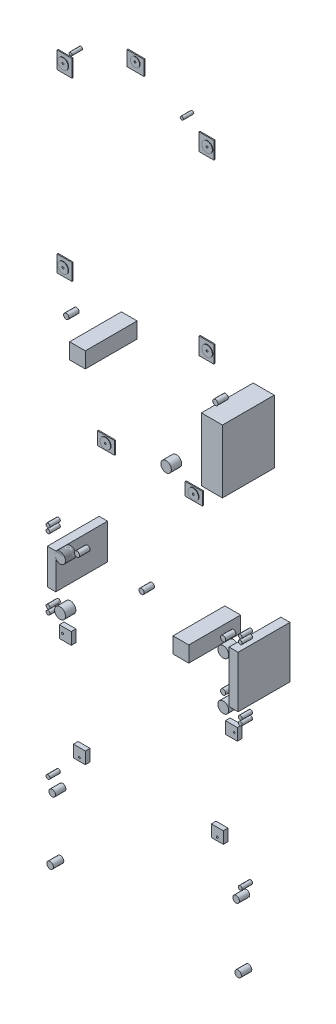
ISO-10303-21;
HEADER;
FILE_DESCRIPTION(('STEP AP214'),'2;1');
FILE_NAME('part.step','',(''),(''),'','','');
FILE_SCHEMA(('AUTOMOTIVE_DESIGN { 1 0 10303 214 1 1 1 1 }'));
ENDSEC;
DATA;
#1=APPLICATION_CONTEXT('core data for automotive mechanical design processes');
#2=APPLICATION_PROTOCOL_DEFINITION('international standard','automotive_design',2000,#1);
#3=PRODUCT_CONTEXT('',#1,'mechanical');
#4=PRODUCT('Part','Part','',(#3));
#5=PRODUCT_RELATED_PRODUCT_CATEGORY('part','',(#4));
#6=PRODUCT_DEFINITION_FORMATION('','',#4);
#7=PRODUCT_DEFINITION_CONTEXT('part definition',#1,'design');
#8=PRODUCT_DEFINITION('design','',#6,#7);
#9=PRODUCT_DEFINITION_SHAPE('','',#8);
#10=(LENGTH_UNIT() NAMED_UNIT(*) SI_UNIT(.MILLI.,.METRE.));
#11=(NAMED_UNIT(*) PLANE_ANGLE_UNIT() SI_UNIT($,.RADIAN.));
#12=(NAMED_UNIT(*) SI_UNIT($,.STERADIAN.) SOLID_ANGLE_UNIT());
#13=UNCERTAINTY_MEASURE_WITH_UNIT(LENGTH_MEASURE(1.E-05),#10,'distance_accuracy_value','');
#14=(GEOMETRIC_REPRESENTATION_CONTEXT(3) GLOBAL_UNCERTAINTY_ASSIGNED_CONTEXT((#13)) GLOBAL_UNIT_ASSIGNED_CONTEXT((#10,
#11,#12)) REPRESENTATION_CONTEXT('',''));
#15=CARTESIAN_POINT('',(0.,0.,0.));
#16=DIRECTION('',(0.,0.,1.));
#17=DIRECTION('',(1.,0.,0.));
#18=AXIS2_PLACEMENT_3D('',#15,#16,#17);
#19=CARTESIAN_POINT('',(30520.6832159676,64487.9957745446,0.));
#20=DIRECTION('',(0.,0.,-1.));
#21=DIRECTION('',(-1.,0.,0.));
#22=AXIS2_PLACEMENT_3D('',#19,#20,#21);
#23=PLANE('',#22);
#24=CARTESIAN_POINT('',(30520.6832159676,64487.9957745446,0.));
#25=DIRECTION('',(0.,0.,-1.));
#26=DIRECTION('',(-1.,0.,0.));
#27=AXIS2_PLACEMENT_3D('',#24,#25,#26);
#28=CIRCLE('',#27,52.5202279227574);
#29=CARTESIAN_POINT('',(30468.1629880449,64487.9957745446,0.));
#30=VERTEX_POINT('',#29);
#31=EDGE_CURVE('E52',#30,#30,#28,.T.);
#32=ORIENTED_EDGE('',*,*,#31,.F.);
#33=EDGE_LOOP('',(#32));
#34=FACE_BOUND('',#33,.T.);
#35=ADVANCED_FACE('F45',(#34),#23,.F.);
#36=CARTESIAN_POINT('',(30520.6832159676,64487.9957745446,-248.549637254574));
#37=DIRECTION('',(0.,0.,1.));
#38=DIRECTION('',(1.,0.,0.));
#39=AXIS2_PLACEMENT_3D('',#36,#37,#38);
#40=CYLINDRICAL_SURFACE('',#39,52.5202279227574);
#41=CARTESIAN_POINT('',(30520.6832159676,64487.9957745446,-100.));
#42=DIRECTION('',(0.,0.,1.));
#43=DIRECTION('',(1.,0.,0.));
#44=AXIS2_PLACEMENT_3D('',#41,#42,#43);
#45=CIRCLE('',#44,52.5202279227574);
#46=CARTESIAN_POINT('',(30573.2034438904,64487.9957745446,-100.));
#47=VERTEX_POINT('',#46);
#48=EDGE_CURVE('E11',#47,#47,#45,.T.);
#49=ORIENTED_EDGE('',*,*,#48,.T.);
#50=EDGE_LOOP('',(#49));
#51=FACE_BOUND('',#50,.T.);
#52=ORIENTED_EDGE('',*,*,#31,.T.);
#53=EDGE_LOOP('',(#52));
#54=FACE_BOUND('',#53,.T.);
#55=ADVANCED_FACE('F47',(#51,#54),#40,.T.);
#56=CARTESIAN_POINT('',(30520.6832159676,64025.106415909,-100.));
#57=DIRECTION('',(0.,0.,1.));
#58=DIRECTION('',(1.,0.,0.));
#59=AXIS2_PLACEMENT_3D('',#56,#57,#58);
#60=PLANE('',#59);
#61=ORIENTED_EDGE('',*,*,#48,.F.);
#62=EDGE_LOOP('',(#61));
#63=FACE_BOUND('',#62,.T.);
#64=ADVANCED_FACE('F63',(#63),#60,.F.);
#65=CLOSED_SHELL('',(#35,#55,#64));
#66=MANIFOLD_SOLID_BREP('B2',#65);
#67=CARTESIAN_POINT('',(30954.8848533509,65639.2790100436,-90.));
#68=DIRECTION('',(1.,0.,0.));
#69=DIRECTION('',(0.,0.,-1.));
#70=AXIS2_PLACEMENT_3D('',#67,#68,#69);
#71=PLANE('',#70);
#72=DIRECTION('',(0.,-1.,0.));
#73=VECTOR('',#72,1.);
#74=CARTESIAN_POINT('',(30954.8848533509,65639.2790100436,-100.));
#75=LINE('',#74,#73);
#76=CARTESIAN_POINT('',(30954.8848533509,65639.2790100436,-100.));
#77=VERTEX_POINT('',#76);
#78=CARTESIAN_POINT('',(30954.8848533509,65515.4627697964,-100.));
#79=VERTEX_POINT('',#78);
#80=EDGE_CURVE('E163',#77,#79,#75,.T.);
#81=ORIENTED_EDGE('',*,*,#80,.F.);
#82=DIRECTION('',(0.,0.,-1.));
#83=VECTOR('',#82,1.);
#84=CARTESIAN_POINT('',(30954.8848533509,65639.2790100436,-90.));
#85=LINE('',#84,#83);
#86=CARTESIAN_POINT('',(30954.8848533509,65639.2790100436,-90.));
#87=VERTEX_POINT('',#86);
#88=EDGE_CURVE('E43',#87,#77,#85,.T.);
#89=ORIENTED_EDGE('',*,*,#88,.F.);
#90=DIRECTION('',(0.,-1.,0.));
#91=VECTOR('',#90,1.);
#92=CARTESIAN_POINT('',(30954.8848533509,65639.2790100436,-90.));
#93=LINE('',#92,#91);
#94=CARTESIAN_POINT('',(30954.8848533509,65515.4627697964,-90.));
#95=VERTEX_POINT('',#94);
#96=EDGE_CURVE('E156',#87,#95,#93,.T.);
#97=ORIENTED_EDGE('',*,*,#96,.T.);
#98=DIRECTION('',(0.,0.,-1.));
#99=VECTOR('',#98,1.);
#100=CARTESIAN_POINT('',(30954.8848533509,65515.4627697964,-90.));
#101=LINE('',#100,#99);
#102=EDGE_CURVE('E101',#95,#79,#101,.T.);
#103=ORIENTED_EDGE('',*,*,#102,.T.);
#104=EDGE_LOOP('',(#81,#89,#97,#103));
#105=FACE_BOUND('',#104,.T.);
#106=ADVANCED_FACE('F98',(#105),#71,.T.);
#107=CARTESIAN_POINT('',(30954.8848533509,65639.2790100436,-90.));
#108=DIRECTION('',(0.,1.,0.));
#109=DIRECTION('',(0.,0.,1.));
#110=AXIS2_PLACEMENT_3D('',#107,#108,#109);
#111=PLANE('',#110);
#112=DIRECTION('',(1.,0.,0.));
#113=VECTOR('',#112,1.);
#114=CARTESIAN_POINT('',(30954.8848533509,65639.2790100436,-100.));
#115=LINE('',#114,#113);
#116=CARTESIAN_POINT('',(30789.7966001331,65639.2790100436,-100.));
#117=VERTEX_POINT('',#116);
#118=EDGE_CURVE('E158',#117,#77,#115,.T.);
#119=ORIENTED_EDGE('',*,*,#118,.F.);
#120=DIRECTION('',(0.,0.,-1.));
#121=VECTOR('',#120,1.);
#122=CARTESIAN_POINT('',(30789.7966001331,65639.2790100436,-90.));
#123=LINE('',#122,#121);
#124=CARTESIAN_POINT('',(30789.7966001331,65639.2790100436,-90.));
#125=VERTEX_POINT('',#124);
#126=EDGE_CURVE('E107',#125,#117,#123,.T.);
#127=ORIENTED_EDGE('',*,*,#126,.F.);
#128=DIRECTION('',(1.,0.,0.));
#129=VECTOR('',#128,1.);
#130=CARTESIAN_POINT('',(30954.8848533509,65639.2790100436,-90.));
#131=LINE('',#130,#129);
#132=EDGE_CURVE('E153',#125,#87,#131,.T.);
#133=ORIENTED_EDGE('',*,*,#132,.T.);
#134=ORIENTED_EDGE('',*,*,#88,.T.);
#135=EDGE_LOOP('',(#119,#127,#133,#134));
#136=FACE_BOUND('',#135,.T.);
#137=ADVANCED_FACE('F174',(#136),#111,.T.);
#138=CARTESIAN_POINT('',(30789.7966001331,65639.2790100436,-90.));
#139=DIRECTION('',(-1.,0.,0.));
#140=DIRECTION('',(0.,0.,1.));
#141=AXIS2_PLACEMENT_3D('',#138,#139,#140);
#142=PLANE('',#141);
#143=DIRECTION('',(0.,1.,0.));
#144=VECTOR('',#143,1.);
#145=CARTESIAN_POINT('',(30789.7966001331,65639.2790100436,-100.));
#146=LINE('',#145,#144);
#147=CARTESIAN_POINT('',(30789.7966001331,65515.4627697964,-100.));
#148=VERTEX_POINT('',#147);
#149=EDGE_CURVE('E148',#148,#117,#146,.T.);
#150=ORIENTED_EDGE('',*,*,#149,.F.);
#151=DIRECTION('',(0.,0.,-1.));
#152=VECTOR('',#151,1.);
#153=CARTESIAN_POINT('',(30789.7966001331,65515.4627697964,-90.));
#154=LINE('',#153,#152);
#155=CARTESIAN_POINT('',(30789.7966001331,65515.4627697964,-90.));
#156=VERTEX_POINT('',#155);
#157=EDGE_CURVE('E143',#156,#148,#154,.T.);
#158=ORIENTED_EDGE('',*,*,#157,.F.);
#159=DIRECTION('',(0.,1.,0.));
#160=VECTOR('',#159,1.);
#161=CARTESIAN_POINT('',(30789.7966001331,65639.2790100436,-90.));
#162=LINE('',#161,#160);
#163=EDGE_CURVE('E146',#156,#125,#162,.T.);
#164=ORIENTED_EDGE('',*,*,#163,.T.);
#165=ORIENTED_EDGE('',*,*,#126,.T.);
#166=EDGE_LOOP('',(#150,#158,#164,#165));
#167=FACE_BOUND('',#166,.T.);
#168=ADVANCED_FACE('F145',(#167),#142,.T.);
#169=CARTESIAN_POINT('',(30954.8848533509,65515.4627697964,-90.));
#170=DIRECTION('',(0.,-1.,0.));
#171=DIRECTION('',(0.,0.,-1.));
#172=AXIS2_PLACEMENT_3D('',#169,#170,#171);
#173=PLANE('',#172);
#174=DIRECTION('',(-1.,0.,0.));
#175=VECTOR('',#174,1.);
#176=CARTESIAN_POINT('',(30954.8848533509,65515.4627697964,-100.));
#177=LINE('',#176,#175);
#178=EDGE_CURVE('E166',#79,#148,#177,.T.);
#179=ORIENTED_EDGE('',*,*,#178,.F.);
#180=ORIENTED_EDGE('',*,*,#102,.F.);
#181=DIRECTION('',(-1.,0.,0.));
#182=VECTOR('',#181,1.);
#183=CARTESIAN_POINT('',(30954.8848533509,65515.4627697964,-90.));
#184=LINE('',#183,#182);
#185=EDGE_CURVE('E152',#95,#156,#184,.T.);
#186=ORIENTED_EDGE('',*,*,#185,.T.);
#187=ORIENTED_EDGE('',*,*,#157,.T.);
#188=EDGE_LOOP('',(#179,#180,#186,#187));
#189=FACE_BOUND('',#188,.T.);
#190=ADVANCED_FACE('F155',(#189),#173,.T.);
#191=CARTESIAN_POINT('',(0.,0.,-90.));
#192=DIRECTION('',(0.,0.,-1.));
#193=DIRECTION('',(-1.,0.,0.));
#194=AXIS2_PLACEMENT_3D('',#191,#192,#193);
#195=PLANE('',#194);
#196=CARTESIAN_POINT('',(30872.340726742,65575.7834777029,-90.));
#197=DIRECTION('',(0.,0.,-1.));
#198=DIRECTION('',(-1.,0.,0.));
#199=AXIS2_PLACEMENT_3D('',#196,#197,#198);
#200=CIRCLE('',#199,50.7963856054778);
#201=CARTESIAN_POINT('',(30821.5443411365,65575.7834777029,-90.));
#202=VERTEX_POINT('',#201);
#203=EDGE_CURVE('E167',#202,#202,#200,.T.);
#204=ORIENTED_EDGE('',*,*,#203,.T.);
#205=EDGE_LOOP('',(#204));
#206=FACE_BOUND('',#205,.T.);
#207=ORIENTED_EDGE('',*,*,#96,.F.);
#208=ORIENTED_EDGE('',*,*,#132,.F.);
#209=ORIENTED_EDGE('',*,*,#163,.F.);
#210=ORIENTED_EDGE('',*,*,#185,.F.);
#211=EDGE_LOOP('',(#207,#208,#209,#210));
#212=FACE_BOUND('',#211,.T.);
#213=ADVANCED_FACE('F151',(#206,#212),#195,.F.);
#214=CARTESIAN_POINT('',(0.,0.,-100.));
#215=DIRECTION('',(0.,0.,-1.));
#216=DIRECTION('',(-1.,0.,0.));
#217=AXIS2_PLACEMENT_3D('',#214,#215,#216);
#218=PLANE('',#217);
#219=CARTESIAN_POINT('',(30872.340726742,65575.7834777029,-100.));
#220=DIRECTION('',(0.,0.,-1.));
#221=DIRECTION('',(-1.,0.,0.));
#222=AXIS2_PLACEMENT_3D('',#219,#220,#221);
#223=CIRCLE('',#222,50.7963856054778);
#224=CARTESIAN_POINT('',(30821.5443411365,65575.7834777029,-100.));
#225=VERTEX_POINT('',#224);
#226=EDGE_CURVE('E204',#225,#225,#223,.T.);
#227=ORIENTED_EDGE('',*,*,#226,.F.);
#228=EDGE_LOOP('',(#227));
#229=FACE_BOUND('',#228,.T.);
#230=ORIENTED_EDGE('',*,*,#80,.T.);
#231=ORIENTED_EDGE('',*,*,#178,.T.);
#232=ORIENTED_EDGE('',*,*,#149,.T.);
#233=ORIENTED_EDGE('',*,*,#118,.T.);
#234=EDGE_LOOP('',(#230,#231,#232,#233));
#235=FACE_BOUND('',#234,.T.);
#236=ADVANCED_FACE('F173',(#229,#235),#218,.T.);
#237=CARTESIAN_POINT('',(30872.340726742,65575.7834777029,-90.));
#238=DIRECTION('',(0.,0.,-1.));
#239=DIRECTION('',(-1.,0.,0.));
#240=AXIS2_PLACEMENT_3D('',#237,#238,#239);
#241=CYLINDRICAL_SURFACE('',#240,50.7963856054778);
#242=ORIENTED_EDGE('',*,*,#203,.F.);
#243=EDGE_LOOP('',(#242));
#244=FACE_BOUND('',#243,.T.);
#245=ORIENTED_EDGE('',*,*,#226,.T.);
#246=EDGE_LOOP('',(#245));
#247=FACE_BOUND('',#246,.T.);
#248=ADVANCED_FACE('F192',(#244,#247),#241,.F.);
#249=CLOSED_SHELL('',(#106,#137,#168,#190,#213,#236,#248));
#250=MANIFOLD_SOLID_BREP('B6',#249);
#251=CARTESIAN_POINT('',(31803.1844929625,65639.2790100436,-90.));
#252=DIRECTION('',(1.,0.,0.));
#253=DIRECTION('',(0.,0.,-1.));
#254=AXIS2_PLACEMENT_3D('',#251,#252,#253);
#255=PLANE('',#254);
#256=DIRECTION('',(0.,-1.,0.));
#257=VECTOR('',#256,1.);
#258=CARTESIAN_POINT('',(31803.1844929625,65639.2790100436,-100.));
#259=LINE('',#258,#257);
#260=CARTESIAN_POINT('',(31803.1844929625,65639.2790100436,-100.));
#261=VERTEX_POINT('',#260);
#262=CARTESIAN_POINT('',(31803.1844929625,65515.4627697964,-100.));
#263=VERTEX_POINT('',#262);
#264=EDGE_CURVE('E320',#261,#263,#259,.T.);
#265=ORIENTED_EDGE('',*,*,#264,.F.);
#266=DIRECTION('',(0.,0.,-1.));
#267=VECTOR('',#266,1.);
#268=CARTESIAN_POINT('',(31803.1844929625,65639.2790100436,-90.));
#269=LINE('',#268,#267);
#270=CARTESIAN_POINT('',(31803.1844929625,65639.2790100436,-90.));
#271=VERTEX_POINT('',#270);
#272=EDGE_CURVE('E96',#271,#261,#269,.T.);
#273=ORIENTED_EDGE('',*,*,#272,.F.);
#274=DIRECTION('',(0.,-1.,0.));
#275=VECTOR('',#274,1.);
#276=CARTESIAN_POINT('',(31803.1844929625,65639.2790100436,-90.));
#277=LINE('',#276,#275);
#278=CARTESIAN_POINT('',(31803.1844929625,65515.4627697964,-90.));
#279=VERTEX_POINT('',#278);
#280=EDGE_CURVE('E313',#271,#279,#277,.T.);
#281=ORIENTED_EDGE('',*,*,#280,.T.);
#282=DIRECTION('',(0.,0.,-1.));
#283=VECTOR('',#282,1.);
#284=CARTESIAN_POINT('',(31803.1844929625,65515.4627697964,-90.));
#285=LINE('',#284,#283);
#286=EDGE_CURVE('E258',#279,#263,#285,.T.);
#287=ORIENTED_EDGE('',*,*,#286,.T.);
#288=EDGE_LOOP('',(#265,#273,#281,#287));
#289=FACE_BOUND('',#288,.T.);
#290=ADVANCED_FACE('F255',(#289),#255,.T.);
#291=CARTESIAN_POINT('',(31803.1844929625,65639.2790100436,-90.));
#292=DIRECTION('',(0.,1.,0.));
#293=DIRECTION('',(0.,0.,1.));
#294=AXIS2_PLACEMENT_3D('',#291,#292,#293);
#295=PLANE('',#294);
#296=DIRECTION('',(1.,0.,0.));
#297=VECTOR('',#296,1.);
#298=CARTESIAN_POINT('',(31803.1844929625,65639.2790100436,-100.));
#299=LINE('',#298,#297);
#300=CARTESIAN_POINT('',(31638.0962397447,65639.2790100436,-100.));
#301=VERTEX_POINT('',#300);
#302=EDGE_CURVE('E315',#301,#261,#299,.T.);
#303=ORIENTED_EDGE('',*,*,#302,.F.);
#304=DIRECTION('',(0.,0.,-1.));
#305=VECTOR('',#304,1.);
#306=CARTESIAN_POINT('',(31638.0962397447,65639.2790100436,-90.));
#307=LINE('',#306,#305);
#308=CARTESIAN_POINT('',(31638.0962397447,65639.2790100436,-90.));
#309=VERTEX_POINT('',#308);
#310=EDGE_CURVE('E264',#309,#301,#307,.T.);
#311=ORIENTED_EDGE('',*,*,#310,.F.);
#312=DIRECTION('',(1.,0.,0.));
#313=VECTOR('',#312,1.);
#314=CARTESIAN_POINT('',(31803.1844929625,65639.2790100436,-90.));
#315=LINE('',#314,#313);
#316=EDGE_CURVE('E310',#309,#271,#315,.T.);
#317=ORIENTED_EDGE('',*,*,#316,.T.);
#318=ORIENTED_EDGE('',*,*,#272,.T.);
#319=EDGE_LOOP('',(#303,#311,#317,#318));
#320=FACE_BOUND('',#319,.T.);
#321=ADVANCED_FACE('F331',(#320),#295,.T.);
#322=CARTESIAN_POINT('',(31638.0962397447,65639.2790100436,-90.));
#323=DIRECTION('',(-1.,0.,0.));
#324=DIRECTION('',(0.,0.,1.));
#325=AXIS2_PLACEMENT_3D('',#322,#323,#324);
#326=PLANE('',#325);
#327=DIRECTION('',(0.,1.,0.));
#328=VECTOR('',#327,1.);
#329=CARTESIAN_POINT('',(31638.0962397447,65639.2790100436,-100.));
#330=LINE('',#329,#328);
#331=CARTESIAN_POINT('',(31638.0962397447,65515.4627697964,-100.));
#332=VERTEX_POINT('',#331);
#333=EDGE_CURVE('E305',#332,#301,#330,.T.);
#334=ORIENTED_EDGE('',*,*,#333,.F.);
#335=DIRECTION('',(0.,0.,-1.));
#336=VECTOR('',#335,1.);
#337=CARTESIAN_POINT('',(31638.0962397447,65515.4627697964,-90.));
#338=LINE('',#337,#336);
#339=CARTESIAN_POINT('',(31638.0962397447,65515.4627697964,-90.));
#340=VERTEX_POINT('',#339);
#341=EDGE_CURVE('E300',#340,#332,#338,.T.);
#342=ORIENTED_EDGE('',*,*,#341,.F.);
#343=DIRECTION('',(0.,1.,0.));
#344=VECTOR('',#343,1.);
#345=CARTESIAN_POINT('',(31638.0962397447,65639.2790100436,-90.));
#346=LINE('',#345,#344);
#347=EDGE_CURVE('E303',#340,#309,#346,.T.);
#348=ORIENTED_EDGE('',*,*,#347,.T.);
#349=ORIENTED_EDGE('',*,*,#310,.T.);
#350=EDGE_LOOP('',(#334,#342,#348,#349));
#351=FACE_BOUND('',#350,.T.);
#352=ADVANCED_FACE('F302',(#351),#326,.T.);
#353=CARTESIAN_POINT('',(31803.1844929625,65515.4627697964,-90.));
#354=DIRECTION('',(0.,-1.,0.));
#355=DIRECTION('',(0.,0.,-1.));
#356=AXIS2_PLACEMENT_3D('',#353,#354,#355);
#357=PLANE('',#356);
#358=DIRECTION('',(-1.,0.,0.));
#359=VECTOR('',#358,1.);
#360=CARTESIAN_POINT('',(31803.1844929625,65515.4627697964,-100.));
#361=LINE('',#360,#359);
#362=EDGE_CURVE('E323',#263,#332,#361,.T.);
#363=ORIENTED_EDGE('',*,*,#362,.F.);
#364=ORIENTED_EDGE('',*,*,#286,.F.);
#365=DIRECTION('',(-1.,0.,0.));
#366=VECTOR('',#365,1.);
#367=CARTESIAN_POINT('',(31803.1844929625,65515.4627697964,-90.));
#368=LINE('',#367,#366);
#369=EDGE_CURVE('E309',#279,#340,#368,.T.);
#370=ORIENTED_EDGE('',*,*,#369,.T.);
#371=ORIENTED_EDGE('',*,*,#341,.T.);
#372=EDGE_LOOP('',(#363,#364,#370,#371));
#373=FACE_BOUND('',#372,.T.);
#374=ADVANCED_FACE('F312',(#373),#357,.T.);
#375=CARTESIAN_POINT('',(0.,0.,-90.));
#376=DIRECTION('',(0.,0.,-1.));
#377=DIRECTION('',(-1.,0.,0.));
#378=AXIS2_PLACEMENT_3D('',#375,#376,#377);
#379=PLANE('',#378);
#380=CARTESIAN_POINT('',(31720.6403663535,65575.7834777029,-90.));
#381=DIRECTION('',(0.,0.,-1.));
#382=DIRECTION('',(-1.,0.,0.));
#383=AXIS2_PLACEMENT_3D('',#380,#381,#382);
#384=CIRCLE('',#383,50.7963856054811);
#385=CARTESIAN_POINT('',(31669.8439807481,65575.7834777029,-90.));
#386=VERTEX_POINT('',#385);
#387=EDGE_CURVE('E324',#386,#386,#384,.T.);
#388=ORIENTED_EDGE('',*,*,#387,.T.);
#389=EDGE_LOOP('',(#388));
#390=FACE_BOUND('',#389,.T.);
#391=ORIENTED_EDGE('',*,*,#280,.F.);
#392=ORIENTED_EDGE('',*,*,#316,.F.);
#393=ORIENTED_EDGE('',*,*,#347,.F.);
#394=ORIENTED_EDGE('',*,*,#369,.F.);
#395=EDGE_LOOP('',(#391,#392,#393,#394));
#396=FACE_BOUND('',#395,.T.);
#397=ADVANCED_FACE('F308',(#390,#396),#379,.F.);
#398=CARTESIAN_POINT('',(0.,0.,-100.));
#399=DIRECTION('',(0.,0.,-1.));
#400=DIRECTION('',(-1.,0.,0.));
#401=AXIS2_PLACEMENT_3D('',#398,#399,#400);
#402=PLANE('',#401);
#403=CARTESIAN_POINT('',(31720.6403663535,65575.7834777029,-100.));
#404=DIRECTION('',(0.,0.,-1.));
#405=DIRECTION('',(-1.,0.,0.));
#406=AXIS2_PLACEMENT_3D('',#403,#404,#405);
#407=CIRCLE('',#406,50.7963856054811);
#408=CARTESIAN_POINT('',(31669.8439807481,65575.7834777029,-100.));
#409=VERTEX_POINT('',#408);
#410=EDGE_CURVE('E361',#409,#409,#407,.T.);
#411=ORIENTED_EDGE('',*,*,#410,.F.);
#412=EDGE_LOOP('',(#411));
#413=FACE_BOUND('',#412,.T.);
#414=ORIENTED_EDGE('',*,*,#264,.T.);
#415=ORIENTED_EDGE('',*,*,#362,.T.);
#416=ORIENTED_EDGE('',*,*,#333,.T.);
#417=ORIENTED_EDGE('',*,*,#302,.T.);
#418=EDGE_LOOP('',(#414,#415,#416,#417));
#419=FACE_BOUND('',#418,.T.);
#420=ADVANCED_FACE('F330',(#413,#419),#402,.T.);
#421=CARTESIAN_POINT('',(31720.6403663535,65575.7834777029,-90.));
#422=DIRECTION('',(0.,0.,-1.));
#423=DIRECTION('',(-1.,0.,0.));
#424=AXIS2_PLACEMENT_3D('',#421,#422,#423);
#425=CYLINDRICAL_SURFACE('',#424,50.7963856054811);
#426=ORIENTED_EDGE('',*,*,#387,.F.);
#427=EDGE_LOOP('',(#426));
#428=FACE_BOUND('',#427,.T.);
#429=ORIENTED_EDGE('',*,*,#410,.T.);
#430=EDGE_LOOP('',(#429));
#431=FACE_BOUND('',#430,.T.);
#432=ADVANCED_FACE('F349',(#428,#431),#425,.F.);
#433=CLOSED_SHELL('',(#290,#321,#352,#374,#397,#420,#432));
#434=MANIFOLD_SOLID_BREP('B37',#433);
#435=CARTESIAN_POINT('',(30546.1263383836,66763.1489912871,-90.));
#436=DIRECTION('',(1.,0.,0.));
#437=DIRECTION('',(0.,0.,-1.));
#438=AXIS2_PLACEMENT_3D('',#435,#436,#437);
#439=PLANE('',#438);
#440=DIRECTION('',(0.,-1.,0.));
#441=VECTOR('',#440,1.);
#442=CARTESIAN_POINT('',(30546.1263383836,66763.1489912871,-100.));
#443=LINE('',#442,#441);
#444=CARTESIAN_POINT('',(30546.1263383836,66921.8876963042,-100.));
#445=VERTEX_POINT('',#444);
#446=CARTESIAN_POINT('',(30546.1263383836,66763.1489912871,-100.));
#447=VERTEX_POINT('',#446);
#448=EDGE_CURVE('E477',#445,#447,#443,.T.);
#449=ORIENTED_EDGE('',*,*,#448,.F.);
#450=DIRECTION('',(0.,0.,-1.));
#451=VECTOR('',#450,1.);
#452=CARTESIAN_POINT('',(30546.1263383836,66921.8876963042,-90.));
#453=LINE('',#452,#451);
#454=CARTESIAN_POINT('',(30546.1263383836,66921.8876963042,-90.));
#455=VERTEX_POINT('',#454);
#456=EDGE_CURVE('E253',#455,#445,#453,.T.);
#457=ORIENTED_EDGE('',*,*,#456,.F.);
#458=DIRECTION('',(0.,-1.,0.));
#459=VECTOR('',#458,1.);
#460=CARTESIAN_POINT('',(30546.1263383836,66763.1489912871,-90.));
#461=LINE('',#460,#459);
#462=CARTESIAN_POINT('',(30546.1263383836,66763.1489912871,-90.));
#463=VERTEX_POINT('',#462);
#464=EDGE_CURVE('E470',#455,#463,#461,.T.);
#465=ORIENTED_EDGE('',*,*,#464,.T.);
#466=DIRECTION('',(0.,0.,-1.));
#467=VECTOR('',#466,1.);
#468=CARTESIAN_POINT('',(30546.1263383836,66763.1489912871,-90.));
#469=LINE('',#468,#467);
#470=EDGE_CURVE('E415',#463,#447,#469,.T.);
#471=ORIENTED_EDGE('',*,*,#470,.T.);
#472=EDGE_LOOP('',(#449,#457,#465,#471));
#473=FACE_BOUND('',#472,.T.);
#474=ADVANCED_FACE('F412',(#473),#439,.T.);
#475=CARTESIAN_POINT('',(30546.1263383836,66921.8876963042,-90.));
#476=DIRECTION('',(0.,1.,0.));
#477=DIRECTION('',(0.,0.,1.));
#478=AXIS2_PLACEMENT_3D('',#475,#476,#477);
#479=PLANE('',#478);
#480=DIRECTION('',(1.,0.,0.));
#481=VECTOR('',#480,1.);
#482=CARTESIAN_POINT('',(30546.1263383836,66921.8876963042,-100.));
#483=LINE('',#482,#481);
#484=CARTESIAN_POINT('',(30403.2615038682,66921.8876963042,-100.));
#485=VERTEX_POINT('',#484);
#486=EDGE_CURVE('E472',#485,#445,#483,.T.);
#487=ORIENTED_EDGE('',*,*,#486,.F.);
#488=DIRECTION('',(0.,0.,-1.));
#489=VECTOR('',#488,1.);
#490=CARTESIAN_POINT('',(30403.2615038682,66921.8876963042,-90.));
#491=LINE('',#490,#489);
#492=CARTESIAN_POINT('',(30403.2615038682,66921.8876963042,-90.));
#493=VERTEX_POINT('',#492);
#494=EDGE_CURVE('E421',#493,#485,#491,.T.);
#495=ORIENTED_EDGE('',*,*,#494,.F.);
#496=DIRECTION('',(1.,0.,0.));
#497=VECTOR('',#496,1.);
#498=CARTESIAN_POINT('',(30546.1263383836,66921.8876963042,-90.));
#499=LINE('',#498,#497);
#500=EDGE_CURVE('E467',#493,#455,#499,.T.);
#501=ORIENTED_EDGE('',*,*,#500,.T.);
#502=ORIENTED_EDGE('',*,*,#456,.T.);
#503=EDGE_LOOP('',(#487,#495,#501,#502));
#504=FACE_BOUND('',#503,.T.);
#505=ADVANCED_FACE('F488',(#504),#479,.T.);
#506=CARTESIAN_POINT('',(30403.2615038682,66763.1489912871,-90.));
#507=DIRECTION('',(-1.,0.,0.));
#508=DIRECTION('',(0.,0.,1.));
#509=AXIS2_PLACEMENT_3D('',#506,#507,#508);
#510=PLANE('',#509);
#511=DIRECTION('',(0.,1.,0.));
#512=VECTOR('',#511,1.);
#513=CARTESIAN_POINT('',(30403.2615038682,66763.1489912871,-100.));
#514=LINE('',#513,#512);
#515=CARTESIAN_POINT('',(30403.2615038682,66763.1489912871,-100.));
#516=VERTEX_POINT('',#515);
#517=EDGE_CURVE('E462',#516,#485,#514,.T.);
#518=ORIENTED_EDGE('',*,*,#517,.F.);
#519=DIRECTION('',(0.,0.,-1.));
#520=VECTOR('',#519,1.);
#521=CARTESIAN_POINT('',(30403.2615038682,66763.1489912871,-90.));
#522=LINE('',#521,#520);
#523=CARTESIAN_POINT('',(30403.2615038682,66763.1489912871,-90.));
#524=VERTEX_POINT('',#523);
#525=EDGE_CURVE('E457',#524,#516,#522,.T.);
#526=ORIENTED_EDGE('',*,*,#525,.F.);
#527=DIRECTION('',(0.,1.,0.));
#528=VECTOR('',#527,1.);
#529=CARTESIAN_POINT('',(30403.2615038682,66763.1489912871,-90.));
#530=LINE('',#529,#528);
#531=EDGE_CURVE('E460',#524,#493,#530,.T.);
#532=ORIENTED_EDGE('',*,*,#531,.T.);
#533=ORIENTED_EDGE('',*,*,#494,.T.);
#534=EDGE_LOOP('',(#518,#526,#532,#533));
#535=FACE_BOUND('',#534,.T.);
#536=ADVANCED_FACE('F459',(#535),#510,.T.);
#537=CARTESIAN_POINT('',(30546.1263383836,66763.1489912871,-90.));
#538=DIRECTION('',(0.,-1.,0.));
#539=DIRECTION('',(0.,0.,-1.));
#540=AXIS2_PLACEMENT_3D('',#537,#538,#539);
#541=PLANE('',#540);
#542=DIRECTION('',(-1.,0.,0.));
#543=VECTOR('',#542,1.);
#544=CARTESIAN_POINT('',(30546.1263383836,66763.1489912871,-100.));
#545=LINE('',#544,#543);
#546=EDGE_CURVE('E480',#447,#516,#545,.T.);
#547=ORIENTED_EDGE('',*,*,#546,.F.);
#548=ORIENTED_EDGE('',*,*,#470,.F.);
#549=DIRECTION('',(-1.,0.,0.));
#550=VECTOR('',#549,1.);
#551=CARTESIAN_POINT('',(30546.1263383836,66763.1489912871,-90.));
#552=LINE('',#551,#550);
#553=EDGE_CURVE('E466',#463,#524,#552,.T.);
#554=ORIENTED_EDGE('',*,*,#553,.T.);
#555=ORIENTED_EDGE('',*,*,#525,.T.);
#556=EDGE_LOOP('',(#547,#548,#554,#555));
#557=FACE_BOUND('',#556,.T.);
#558=ADVANCED_FACE('F469',(#557),#541,.T.);
#559=CARTESIAN_POINT('',(0.,0.,-90.));
#560=DIRECTION('',(0.,0.,1.));
#561=DIRECTION('',(1.,0.,0.));
#562=AXIS2_PLACEMENT_3D('',#559,#560,#561);
#563=PLANE('',#562);
#564=CARTESIAN_POINT('',(30463.5822117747,66839.3435696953,-90.));
#565=DIRECTION('',(0.,0.,-1.));
#566=DIRECTION('',(-1.,0.,0.));
#567=AXIS2_PLACEMENT_3D('',#564,#565,#566);
#568=CIRCLE('',#567,50.7963856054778);
#569=CARTESIAN_POINT('',(30412.7858261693,66839.3435696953,-90.));
#570=VERTEX_POINT('',#569);
#571=EDGE_CURVE('E481',#570,#570,#568,.T.);
#572=ORIENTED_EDGE('',*,*,#571,.T.);
#573=EDGE_LOOP('',(#572));
#574=FACE_BOUND('',#573,.T.);
#575=ORIENTED_EDGE('',*,*,#464,.F.);
#576=ORIENTED_EDGE('',*,*,#500,.F.);
#577=ORIENTED_EDGE('',*,*,#531,.F.);
#578=ORIENTED_EDGE('',*,*,#553,.F.);
#579=EDGE_LOOP('',(#575,#576,#577,#578));
#580=FACE_BOUND('',#579,.T.);
#581=ADVANCED_FACE('F465',(#574,#580),#563,.T.);
#582=CARTESIAN_POINT('',(0.,0.,-100.));
#583=DIRECTION('',(0.,0.,1.));
#584=DIRECTION('',(1.,0.,0.));
#585=AXIS2_PLACEMENT_3D('',#582,#583,#584);
#586=PLANE('',#585);
#587=CARTESIAN_POINT('',(30463.5822117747,66839.3435696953,-100.));
#588=DIRECTION('',(0.,0.,-1.));
#589=DIRECTION('',(-1.,0.,0.));
#590=AXIS2_PLACEMENT_3D('',#587,#588,#589);
#591=CIRCLE('',#590,50.7963856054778);
#592=CARTESIAN_POINT('',(30412.7858261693,66839.3435696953,-100.));
#593=VERTEX_POINT('',#592);
#594=EDGE_CURVE('E518',#593,#593,#591,.T.);
#595=ORIENTED_EDGE('',*,*,#594,.F.);
#596=EDGE_LOOP('',(#595));
#597=FACE_BOUND('',#596,.T.);
#598=ORIENTED_EDGE('',*,*,#448,.T.);
#599=ORIENTED_EDGE('',*,*,#546,.T.);
#600=ORIENTED_EDGE('',*,*,#517,.T.);
#601=ORIENTED_EDGE('',*,*,#486,.T.);
#602=EDGE_LOOP('',(#598,#599,#600,#601));
#603=FACE_BOUND('',#602,.T.);
#604=ADVANCED_FACE('F487',(#597,#603),#586,.F.);
#605=CARTESIAN_POINT('',(30463.5822117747,66839.3435696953,-90.));
#606=DIRECTION('',(0.,0.,-1.));
#607=DIRECTION('',(-1.,0.,0.));
#608=AXIS2_PLACEMENT_3D('',#605,#606,#607);
#609=CYLINDRICAL_SURFACE('',#608,50.7963856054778);
#610=ORIENTED_EDGE('',*,*,#571,.F.);
#611=EDGE_LOOP('',(#610));
#612=FACE_BOUND('',#611,.T.);
#613=ORIENTED_EDGE('',*,*,#594,.T.);
#614=EDGE_LOOP('',(#613));
#615=FACE_BOUND('',#614,.T.);
#616=ADVANCED_FACE('F506',(#612,#615),#609,.F.);
#617=CLOSED_SHELL('',(#474,#505,#536,#558,#581,#604,#616));
#618=MANIFOLD_SOLID_BREP('B90',#617);
#619=CARTESIAN_POINT('',(31914.7079575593,66921.8876962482,-90.));
#620=DIRECTION('',(1.,0.,0.));
#621=DIRECTION('',(0.,0.,-1.));
#622=AXIS2_PLACEMENT_3D('',#619,#620,#621);
#623=PLANE('',#622);
#624=DIRECTION('',(0.,-1.,0.));
#625=VECTOR('',#624,1.);
#626=CARTESIAN_POINT('',(31914.7079575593,66921.8876962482,-100.));
#627=LINE('',#626,#625);
#628=CARTESIAN_POINT('',(31914.7079575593,66921.8876962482,-100.));
#629=VERTEX_POINT('',#628);
#630=CARTESIAN_POINT('',(31914.7079575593,66756.7994430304,-100.));
#631=VERTEX_POINT('',#630);
#632=EDGE_CURVE('E634',#629,#631,#627,.T.);
#633=ORIENTED_EDGE('',*,*,#632,.F.);
#634=DIRECTION('',(0.,0.,-1.));
#635=VECTOR('',#634,1.);
#636=CARTESIAN_POINT('',(31914.7079575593,66921.8876962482,-90.));
#637=LINE('',#636,#635);
#638=CARTESIAN_POINT('',(31914.7079575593,66921.8876962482,-90.));
#639=VERTEX_POINT('',#638);
#640=EDGE_CURVE('E410',#639,#629,#637,.T.);
#641=ORIENTED_EDGE('',*,*,#640,.F.);
#642=DIRECTION('',(0.,-1.,0.));
#643=VECTOR('',#642,1.);
#644=CARTESIAN_POINT('',(31914.7079575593,66921.8876962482,-90.));
#645=LINE('',#644,#643);
#646=CARTESIAN_POINT('',(31914.7079575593,66756.7994430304,-90.));
#647=VERTEX_POINT('',#646);
#648=EDGE_CURVE('E627',#639,#647,#645,.T.);
#649=ORIENTED_EDGE('',*,*,#648,.T.);
#650=DIRECTION('',(0.,0.,-1.));
#651=VECTOR('',#650,1.);
#652=CARTESIAN_POINT('',(31914.7079575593,66756.7994430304,-90.));
#653=LINE('',#652,#651);
#654=EDGE_CURVE('E572',#647,#631,#653,.T.);
#655=ORIENTED_EDGE('',*,*,#654,.T.);
#656=EDGE_LOOP('',(#633,#641,#649,#655));
#657=FACE_BOUND('',#656,.T.);
#658=ADVANCED_FACE('F569',(#657),#623,.T.);
#659=CARTESIAN_POINT('',(31914.7079575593,66921.8876962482,-90.));
#660=DIRECTION('',(0.,1.,0.));
#661=DIRECTION('',(0.,0.,1.));
#662=AXIS2_PLACEMENT_3D('',#659,#660,#661);
#663=PLANE('',#662);
#664=DIRECTION('',(1.,0.,0.));
#665=VECTOR('',#664,1.);
#666=CARTESIAN_POINT('',(31914.7079575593,66921.8876962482,-100.));
#667=LINE('',#666,#665);
#668=CARTESIAN_POINT('',(31771.8431230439,66921.8876962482,-100.));
#669=VERTEX_POINT('',#668);
#670=EDGE_CURVE('E629',#669,#629,#667,.T.);
#671=ORIENTED_EDGE('',*,*,#670,.F.);
#672=DIRECTION('',(0.,0.,-1.));
#673=VECTOR('',#672,1.);
#674=CARTESIAN_POINT('',(31771.8431230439,66921.8876962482,-90.));
#675=LINE('',#674,#673);
#676=CARTESIAN_POINT('',(31771.8431230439,66921.8876962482,-90.));
#677=VERTEX_POINT('',#676);
#678=EDGE_CURVE('E578',#677,#669,#675,.T.);
#679=ORIENTED_EDGE('',*,*,#678,.F.);
#680=DIRECTION('',(1.,0.,0.));
#681=VECTOR('',#680,1.);
#682=CARTESIAN_POINT('',(31914.7079575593,66921.8876962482,-90.));
#683=LINE('',#682,#681);
#684=EDGE_CURVE('E624',#677,#639,#683,.T.);
#685=ORIENTED_EDGE('',*,*,#684,.T.);
#686=ORIENTED_EDGE('',*,*,#640,.T.);
#687=EDGE_LOOP('',(#671,#679,#685,#686));
#688=FACE_BOUND('',#687,.T.);
#689=ADVANCED_FACE('F645',(#688),#663,.T.);
#690=CARTESIAN_POINT('',(31771.8431230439,66921.8876962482,-90.));
#691=DIRECTION('',(-1.,0.,0.));
#692=DIRECTION('',(0.,0.,1.));
#693=AXIS2_PLACEMENT_3D('',#690,#691,#692);
#694=PLANE('',#693);
#695=DIRECTION('',(0.,1.,0.));
#696=VECTOR('',#695,1.);
#697=CARTESIAN_POINT('',(31771.8431230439,66921.8876962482,-100.));
#698=LINE('',#697,#696);
#699=CARTESIAN_POINT('',(31771.8431230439,66756.7994430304,-100.));
#700=VERTEX_POINT('',#699);
#701=EDGE_CURVE('E619',#700,#669,#698,.T.);
#702=ORIENTED_EDGE('',*,*,#701,.F.);
#703=DIRECTION('',(0.,0.,-1.));
#704=VECTOR('',#703,1.);
#705=CARTESIAN_POINT('',(31771.8431230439,66756.7994430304,-90.));
#706=LINE('',#705,#704);
#707=CARTESIAN_POINT('',(31771.8431230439,66756.7994430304,-90.));
#708=VERTEX_POINT('',#707);
#709=EDGE_CURVE('E614',#708,#700,#706,.T.);
#710=ORIENTED_EDGE('',*,*,#709,.F.);
#711=DIRECTION('',(0.,1.,0.));
#712=VECTOR('',#711,1.);
#713=CARTESIAN_POINT('',(31771.8431230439,66921.8876962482,-90.));
#714=LINE('',#713,#712);
#715=EDGE_CURVE('E617',#708,#677,#714,.T.);
#716=ORIENTED_EDGE('',*,*,#715,.T.);
#717=ORIENTED_EDGE('',*,*,#678,.T.);
#718=EDGE_LOOP('',(#702,#710,#716,#717));
#719=FACE_BOUND('',#718,.T.);
#720=ADVANCED_FACE('F616',(#719),#694,.T.);
#721=CARTESIAN_POINT('',(31914.7079575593,66756.7994430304,-90.));
#722=DIRECTION('',(0.,-1.,0.));
#723=DIRECTION('',(0.,0.,-1.));
#724=AXIS2_PLACEMENT_3D('',#721,#722,#723);
#725=PLANE('',#724);
#726=DIRECTION('',(-1.,0.,0.));
#727=VECTOR('',#726,1.);
#728=CARTESIAN_POINT('',(31914.7079575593,66756.7994430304,-100.));
#729=LINE('',#728,#727);
#730=EDGE_CURVE('E637',#631,#700,#729,.T.);
#731=ORIENTED_EDGE('',*,*,#730,.F.);
#732=ORIENTED_EDGE('',*,*,#654,.F.);
#733=DIRECTION('',(-1.,0.,0.));
#734=VECTOR('',#733,1.);
#735=CARTESIAN_POINT('',(31914.7079575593,66756.7994430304,-90.));
#736=LINE('',#735,#734);
#737=EDGE_CURVE('E623',#647,#708,#736,.T.);
#738=ORIENTED_EDGE('',*,*,#737,.T.);
#739=ORIENTED_EDGE('',*,*,#709,.T.);
#740=EDGE_LOOP('',(#731,#732,#738,#739));
#741=FACE_BOUND('',#740,.T.);
#742=ADVANCED_FACE('F626',(#741),#725,.T.);
#743=CARTESIAN_POINT('',(0.,0.,-90.));
#744=DIRECTION('',(0.,0.,-1.));
#745=DIRECTION('',(-1.,0.,0.));
#746=AXIS2_PLACEMENT_3D('',#743,#744,#745);
#747=PLANE('',#746);
#748=CARTESIAN_POINT('',(31854.3872496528,66839.3435696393,-90.));
#749=DIRECTION('',(0.,0.,-1.));
#750=DIRECTION('',(-1.,0.,0.));
#751=AXIS2_PLACEMENT_3D('',#748,#749,#750);
#752=CIRCLE('',#751,50.7963856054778);
#753=CARTESIAN_POINT('',(31803.5908640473,66839.3435696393,-90.));
#754=VERTEX_POINT('',#753);
#755=EDGE_CURVE('E638',#754,#754,#752,.T.);
#756=ORIENTED_EDGE('',*,*,#755,.T.);
#757=EDGE_LOOP('',(#756));
#758=FACE_BOUND('',#757,.T.);
#759=ORIENTED_EDGE('',*,*,#648,.F.);
#760=ORIENTED_EDGE('',*,*,#684,.F.);
#761=ORIENTED_EDGE('',*,*,#715,.F.);
#762=ORIENTED_EDGE('',*,*,#737,.F.);
#763=EDGE_LOOP('',(#759,#760,#761,#762));
#764=FACE_BOUND('',#763,.T.);
#765=ADVANCED_FACE('F622',(#758,#764),#747,.F.);
#766=CARTESIAN_POINT('',(0.,0.,-100.));
#767=DIRECTION('',(0.,0.,-1.));
#768=DIRECTION('',(-1.,0.,0.));
#769=AXIS2_PLACEMENT_3D('',#766,#767,#768);
#770=PLANE('',#769);
#771=CARTESIAN_POINT('',(31854.3872496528,66839.3435696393,-100.));
#772=DIRECTION('',(0.,0.,-1.));
#773=DIRECTION('',(-1.,0.,0.));
#774=AXIS2_PLACEMENT_3D('',#771,#772,#773);
#775=CIRCLE('',#774,50.7963856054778);
#776=CARTESIAN_POINT('',(31803.5908640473,66839.3435696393,-100.));
#777=VERTEX_POINT('',#776);
#778=EDGE_CURVE('E675',#777,#777,#775,.T.);
#779=ORIENTED_EDGE('',*,*,#778,.F.);
#780=EDGE_LOOP('',(#779));
#781=FACE_BOUND('',#780,.T.);
#782=ORIENTED_EDGE('',*,*,#632,.T.);
#783=ORIENTED_EDGE('',*,*,#730,.T.);
#784=ORIENTED_EDGE('',*,*,#701,.T.);
#785=ORIENTED_EDGE('',*,*,#670,.T.);
#786=EDGE_LOOP('',(#782,#783,#784,#785));
#787=FACE_BOUND('',#786,.T.);
#788=ADVANCED_FACE('F644',(#781,#787),#770,.T.);
#789=CARTESIAN_POINT('',(31854.3872496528,66839.3435696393,-90.));
#790=DIRECTION('',(0.,0.,-1.));
#791=DIRECTION('',(-1.,0.,0.));
#792=AXIS2_PLACEMENT_3D('',#789,#790,#791);
#793=CYLINDRICAL_SURFACE('',#792,50.7963856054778);
#794=ORIENTED_EDGE('',*,*,#755,.F.);
#795=EDGE_LOOP('',(#794));
#796=FACE_BOUND('',#795,.T.);
#797=ORIENTED_EDGE('',*,*,#778,.T.);
#798=EDGE_LOOP('',(#797));
#799=FACE_BOUND('',#798,.T.);
#800=ADVANCED_FACE('F663',(#796,#799),#793,.F.);
#801=CLOSED_SHELL('',(#658,#689,#720,#742,#765,#788,#800));
#802=MANIFOLD_SOLID_BREP('B247',#801);
#803=CARTESIAN_POINT('',(31241.5288573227,68823.5773824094,-90.));
#804=DIRECTION('',(1.,0.,0.));
#805=DIRECTION('',(0.,0.,-1.));
#806=AXIS2_PLACEMENT_3D('',#803,#804,#805);
#807=PLANE('',#806);
#808=DIRECTION('',(0.,-1.,0.));
#809=VECTOR('',#808,1.);
#810=CARTESIAN_POINT('',(31241.5288573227,68823.5773824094,-100.));
#811=LINE('',#810,#809);
#812=CARTESIAN_POINT('',(31241.5288573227,68966.4422169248,-100.));
#813=VERTEX_POINT('',#812);
#814=CARTESIAN_POINT('',(31241.5288573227,68823.5773824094,-100.));
#815=VERTEX_POINT('',#814);
#816=EDGE_CURVE('E791',#813,#815,#811,.T.);
#817=ORIENTED_EDGE('',*,*,#816,.F.);
#818=DIRECTION('',(0.,0.,-1.));
#819=VECTOR('',#818,1.);
#820=CARTESIAN_POINT('',(31241.5288573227,68966.4422169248,-90.));
#821=LINE('',#820,#819);
#822=CARTESIAN_POINT('',(31241.5288573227,68966.4422169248,-90.));
#823=VERTEX_POINT('',#822);
#824=EDGE_CURVE('E567',#823,#813,#821,.T.);
#825=ORIENTED_EDGE('',*,*,#824,.F.);
#826=DIRECTION('',(0.,-1.,0.));
#827=VECTOR('',#826,1.);
#828=CARTESIAN_POINT('',(31241.5288573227,68823.5773824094,-90.));
#829=LINE('',#828,#827);
#830=CARTESIAN_POINT('',(31241.5288573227,68823.5773824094,-90.));
#831=VERTEX_POINT('',#830);
#832=EDGE_CURVE('E784',#823,#831,#829,.T.);
#833=ORIENTED_EDGE('',*,*,#832,.T.);
#834=DIRECTION('',(0.,0.,-1.));
#835=VECTOR('',#834,1.);
#836=CARTESIAN_POINT('',(31241.5288573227,68823.5773824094,-90.));
#837=LINE('',#836,#835);
#838=EDGE_CURVE('E729',#831,#815,#837,.T.);
#839=ORIENTED_EDGE('',*,*,#838,.T.);
#840=EDGE_LOOP('',(#817,#825,#833,#839));
#841=FACE_BOUND('',#840,.T.);
#842=ADVANCED_FACE('F726',(#841),#807,.T.);
#843=CARTESIAN_POINT('',(31241.5288573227,68966.4422169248,-90.));
#844=DIRECTION('',(0.,1.,0.));
#845=DIRECTION('',(0.,0.,1.));
#846=AXIS2_PLACEMENT_3D('',#843,#844,#845);
#847=PLANE('',#846);
#848=DIRECTION('',(1.,0.,0.));
#849=VECTOR('',#848,1.);
#850=CARTESIAN_POINT('',(31241.5288573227,68966.4422169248,-100.));
#851=LINE('',#850,#849);
#852=CARTESIAN_POINT('',(31076.4406041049,68966.4422169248,-100.));
#853=VERTEX_POINT('',#852);
#854=EDGE_CURVE('E786',#853,#813,#851,.T.);
#855=ORIENTED_EDGE('',*,*,#854,.F.);
#856=DIRECTION('',(0.,0.,-1.));
#857=VECTOR('',#856,1.);
#858=CARTESIAN_POINT('',(31076.4406041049,68966.4422169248,-90.));
#859=LINE('',#858,#857);
#860=CARTESIAN_POINT('',(31076.4406041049,68966.4422169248,-90.));
#861=VERTEX_POINT('',#860);
#862=EDGE_CURVE('E735',#861,#853,#859,.T.);
#863=ORIENTED_EDGE('',*,*,#862,.F.);
#864=DIRECTION('',(1.,0.,0.));
#865=VECTOR('',#864,1.);
#866=CARTESIAN_POINT('',(31241.5288573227,68966.4422169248,-90.));
#867=LINE('',#866,#865);
#868=EDGE_CURVE('E781',#861,#823,#867,.T.);
#869=ORIENTED_EDGE('',*,*,#868,.T.);
#870=ORIENTED_EDGE('',*,*,#824,.T.);
#871=EDGE_LOOP('',(#855,#863,#869,#870));
#872=FACE_BOUND('',#871,.T.);
#873=ADVANCED_FACE('F802',(#872),#847,.T.);
#874=CARTESIAN_POINT('',(31076.4406041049,68823.5773824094,-90.));
#875=DIRECTION('',(-1.,0.,0.));
#876=DIRECTION('',(0.,0.,1.));
#877=AXIS2_PLACEMENT_3D('',#874,#875,#876);
#878=PLANE('',#877);
#879=DIRECTION('',(0.,1.,0.));
#880=VECTOR('',#879,1.);
#881=CARTESIAN_POINT('',(31076.4406041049,68823.5773824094,-100.));
#882=LINE('',#881,#880);
#883=CARTESIAN_POINT('',(31076.4406041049,68823.5773824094,-100.));
#884=VERTEX_POINT('',#883);
#885=EDGE_CURVE('E776',#884,#853,#882,.T.);
#886=ORIENTED_EDGE('',*,*,#885,.F.);
#887=DIRECTION('',(0.,0.,-1.));
#888=VECTOR('',#887,1.);
#889=CARTESIAN_POINT('',(31076.4406041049,68823.5773824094,-90.));
#890=LINE('',#889,#888);
#891=CARTESIAN_POINT('',(31076.4406041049,68823.5773824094,-90.));
#892=VERTEX_POINT('',#891);
#893=EDGE_CURVE('E771',#892,#884,#890,.T.);
#894=ORIENTED_EDGE('',*,*,#893,.F.);
#895=DIRECTION('',(0.,1.,0.));
#896=VECTOR('',#895,1.);
#897=CARTESIAN_POINT('',(31076.4406041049,68823.5773824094,-90.));
#898=LINE('',#897,#896);
#899=EDGE_CURVE('E774',#892,#861,#898,.T.);
#900=ORIENTED_EDGE('',*,*,#899,.T.);
#901=ORIENTED_EDGE('',*,*,#862,.T.);
#902=EDGE_LOOP('',(#886,#894,#900,#901));
#903=FACE_BOUND('',#902,.T.);
#904=ADVANCED_FACE('F773',(#903),#878,.T.);
#905=CARTESIAN_POINT('',(31241.5288573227,68823.5773824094,-90.));
#906=DIRECTION('',(0.,-1.,0.));
#907=DIRECTION('',(0.,0.,-1.));
#908=AXIS2_PLACEMENT_3D('',#905,#906,#907);
#909=PLANE('',#908);
#910=DIRECTION('',(-1.,0.,0.));
#911=VECTOR('',#910,1.);
#912=CARTESIAN_POINT('',(31241.5288573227,68823.5773824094,-100.));
#913=LINE('',#912,#911);
#914=EDGE_CURVE('E794',#815,#884,#913,.T.);
#915=ORIENTED_EDGE('',*,*,#914,.F.);
#916=ORIENTED_EDGE('',*,*,#838,.F.);
#917=DIRECTION('',(-1.,0.,0.));
#918=VECTOR('',#917,1.);
#919=CARTESIAN_POINT('',(31241.5288573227,68823.5773824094,-90.));
#920=LINE('',#919,#918);
#921=EDGE_CURVE('E780',#831,#892,#920,.T.);
#922=ORIENTED_EDGE('',*,*,#921,.T.);
#923=ORIENTED_EDGE('',*,*,#893,.T.);
#924=EDGE_LOOP('',(#915,#916,#922,#923));
#925=FACE_BOUND('',#924,.T.);
#926=ADVANCED_FACE('F783',(#925),#909,.T.);
#927=CARTESIAN_POINT('',(0.,0.,-90.));
#928=DIRECTION('',(0.,0.,1.));
#929=DIRECTION('',(1.,0.,0.));
#930=AXIS2_PLACEMENT_3D('',#927,#928,#929);
#931=PLANE('',#930);
#932=CARTESIAN_POINT('',(31158.9847307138,68906.1215090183,-90.));
#933=DIRECTION('',(0.,0.,-1.));
#934=DIRECTION('',(-1.,0.,0.));
#935=AXIS2_PLACEMENT_3D('',#932,#933,#934);
#936=CIRCLE('',#935,44.192855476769);
#937=CARTESIAN_POINT('',(31114.791875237,68906.1215090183,-90.));
#938=VERTEX_POINT('',#937);
#939=EDGE_CURVE('E795',#938,#938,#936,.T.);
#940=ORIENTED_EDGE('',*,*,#939,.T.);
#941=EDGE_LOOP('',(#940));
#942=FACE_BOUND('',#941,.T.);
#943=ORIENTED_EDGE('',*,*,#832,.F.);
#944=ORIENTED_EDGE('',*,*,#868,.F.);
#945=ORIENTED_EDGE('',*,*,#899,.F.);
#946=ORIENTED_EDGE('',*,*,#921,.F.);
#947=EDGE_LOOP('',(#943,#944,#945,#946));
#948=FACE_BOUND('',#947,.T.);
#949=ADVANCED_FACE('F779',(#942,#948),#931,.T.);
#950=CARTESIAN_POINT('',(0.,0.,-100.));
#951=DIRECTION('',(0.,0.,1.));
#952=DIRECTION('',(1.,0.,0.));
#953=AXIS2_PLACEMENT_3D('',#950,#951,#952);
#954=PLANE('',#953);
#955=CARTESIAN_POINT('',(31158.9847307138,68906.1215090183,-100.));
#956=DIRECTION('',(0.,0.,-1.));
#957=DIRECTION('',(-1.,0.,0.));
#958=AXIS2_PLACEMENT_3D('',#955,#956,#957);
#959=CIRCLE('',#958,44.192855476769);
#960=CARTESIAN_POINT('',(31114.791875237,68906.1215090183,-100.));
#961=VERTEX_POINT('',#960);
#962=EDGE_CURVE('E832',#961,#961,#959,.T.);
#963=ORIENTED_EDGE('',*,*,#962,.F.);
#964=EDGE_LOOP('',(#963));
#965=FACE_BOUND('',#964,.T.);
#966=ORIENTED_EDGE('',*,*,#816,.T.);
#967=ORIENTED_EDGE('',*,*,#914,.T.);
#968=ORIENTED_EDGE('',*,*,#885,.T.);
#969=ORIENTED_EDGE('',*,*,#854,.T.);
#970=EDGE_LOOP('',(#966,#967,#968,#969));
#971=FACE_BOUND('',#970,.T.);
#972=ADVANCED_FACE('F801',(#965,#971),#954,.F.);
#973=CARTESIAN_POINT('',(31158.9847307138,68906.1215090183,-90.));
#974=DIRECTION('',(0.,0.,-1.));
#975=DIRECTION('',(-1.,0.,0.));
#976=AXIS2_PLACEMENT_3D('',#973,#974,#975);
#977=CYLINDRICAL_SURFACE('',#976,44.192855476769);
#978=ORIENTED_EDGE('',*,*,#939,.F.);
#979=EDGE_LOOP('',(#978));
#980=FACE_BOUND('',#979,.T.);
#981=ORIENTED_EDGE('',*,*,#962,.T.);
#982=EDGE_LOOP('',(#981));
#983=FACE_BOUND('',#982,.T.);
#984=ADVANCED_FACE('F820',(#980,#983),#977,.F.);
#985=CLOSED_SHELL('',(#842,#873,#904,#926,#949,#972,#984));
#986=MANIFOLD_SOLID_BREP('B404',#985);
#987=CARTESIAN_POINT('',(31914.7079575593,68626.7413881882,-90.));
#988=DIRECTION('',(1.,0.,0.));
#989=DIRECTION('',(0.,0.,-1.));
#990=AXIS2_PLACEMENT_3D('',#987,#988,#989);
#991=PLANE('',#990);
#992=DIRECTION('',(0.,-1.,0.));
#993=VECTOR('',#992,1.);
#994=CARTESIAN_POINT('',(31914.7079575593,68626.7413881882,-100.));
#995=LINE('',#994,#993);
#996=CARTESIAN_POINT('',(31914.7079575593,68626.7413881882,-100.));
#997=VERTEX_POINT('',#996);
#998=CARTESIAN_POINT('',(31914.7079575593,68461.6531349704,-100.));
#999=VERTEX_POINT('',#998);
#1000=EDGE_CURVE('E948',#997,#999,#995,.T.);
#1001=ORIENTED_EDGE('',*,*,#1000,.F.);
#1002=DIRECTION('',(0.,0.,-1.));
#1003=VECTOR('',#1002,1.);
#1004=CARTESIAN_POINT('',(31914.7079575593,68626.7413881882,-90.));
#1005=LINE('',#1004,#1003);
#1006=CARTESIAN_POINT('',(31914.7079575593,68626.7413881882,-90.));
#1007=VERTEX_POINT('',#1006);
#1008=EDGE_CURVE('E724',#1007,#997,#1005,.T.);
#1009=ORIENTED_EDGE('',*,*,#1008,.F.);
#1010=DIRECTION('',(0.,-1.,0.));
#1011=VECTOR('',#1010,1.);
#1012=CARTESIAN_POINT('',(31914.7079575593,68626.7413881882,-90.));
#1013=LINE('',#1012,#1011);
#1014=CARTESIAN_POINT('',(31914.7079575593,68461.6531349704,-90.));
#1015=VERTEX_POINT('',#1014);
#1016=EDGE_CURVE('E941',#1007,#1015,#1013,.T.);
#1017=ORIENTED_EDGE('',*,*,#1016,.T.);
#1018=DIRECTION('',(0.,0.,-1.));
#1019=VECTOR('',#1018,1.);
#1020=CARTESIAN_POINT('',(31914.7079575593,68461.6531349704,-90.));
#1021=LINE('',#1020,#1019);
#1022=EDGE_CURVE('E886',#1015,#999,#1021,.T.);
#1023=ORIENTED_EDGE('',*,*,#1022,.T.);
#1024=EDGE_LOOP('',(#1001,#1009,#1017,#1023));
#1025=FACE_BOUND('',#1024,.T.);
#1026=ADVANCED_FACE('F883',(#1025),#991,.T.);
#1027=CARTESIAN_POINT('',(31914.7079575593,68626.7413881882,-90.));
#1028=DIRECTION('',(0.,1.,0.));
#1029=DIRECTION('',(0.,0.,1.));
#1030=AXIS2_PLACEMENT_3D('',#1027,#1028,#1029);
#1031=PLANE('',#1030);
#1032=DIRECTION('',(1.,0.,0.));
#1033=VECTOR('',#1032,1.);
#1034=CARTESIAN_POINT('',(31914.7079575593,68626.7413881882,-100.));
#1035=LINE('',#1034,#1033);
#1036=CARTESIAN_POINT('',(31771.8431230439,68626.7413881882,-100.));
#1037=VERTEX_POINT('',#1036);
#1038=EDGE_CURVE('E943',#1037,#997,#1035,.T.);
#1039=ORIENTED_EDGE('',*,*,#1038,.F.);
#1040=DIRECTION('',(0.,0.,-1.));
#1041=VECTOR('',#1040,1.);
#1042=CARTESIAN_POINT('',(31771.8431230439,68626.7413881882,-90.));
#1043=LINE('',#1042,#1041);
#1044=CARTESIAN_POINT('',(31771.8431230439,68626.7413881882,-90.));
#1045=VERTEX_POINT('',#1044);
#1046=EDGE_CURVE('E892',#1045,#1037,#1043,.T.);
#1047=ORIENTED_EDGE('',*,*,#1046,.F.);
#1048=DIRECTION('',(1.,0.,0.));
#1049=VECTOR('',#1048,1.);
#1050=CARTESIAN_POINT('',(31914.7079575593,68626.7413881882,-90.));
#1051=LINE('',#1050,#1049);
#1052=EDGE_CURVE('E938',#1045,#1007,#1051,.T.);
#1053=ORIENTED_EDGE('',*,*,#1052,.T.);
#1054=ORIENTED_EDGE('',*,*,#1008,.T.);
#1055=EDGE_LOOP('',(#1039,#1047,#1053,#1054));
#1056=FACE_BOUND('',#1055,.T.);
#1057=ADVANCED_FACE('F959',(#1056),#1031,.T.);
#1058=CARTESIAN_POINT('',(31771.8431230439,68626.7413881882,-90.));
#1059=DIRECTION('',(-1.,0.,0.));
#1060=DIRECTION('',(0.,0.,1.));
#1061=AXIS2_PLACEMENT_3D('',#1058,#1059,#1060);
#1062=PLANE('',#1061);
#1063=DIRECTION('',(0.,1.,0.));
#1064=VECTOR('',#1063,1.);
#1065=CARTESIAN_POINT('',(31771.8431230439,68626.7413881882,-100.));
#1066=LINE('',#1065,#1064);
#1067=CARTESIAN_POINT('',(31771.8431230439,68461.6531349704,-100.));
#1068=VERTEX_POINT('',#1067);
#1069=EDGE_CURVE('E933',#1068,#1037,#1066,.T.);
#1070=ORIENTED_EDGE('',*,*,#1069,.F.);
#1071=DIRECTION('',(0.,0.,-1.));
#1072=VECTOR('',#1071,1.);
#1073=CARTESIAN_POINT('',(31771.8431230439,68461.6531349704,-90.));
#1074=LINE('',#1073,#1072);
#1075=CARTESIAN_POINT('',(31771.8431230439,68461.6531349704,-90.));
#1076=VERTEX_POINT('',#1075);
#1077=EDGE_CURVE('E928',#1076,#1068,#1074,.T.);
#1078=ORIENTED_EDGE('',*,*,#1077,.F.);
#1079=DIRECTION('',(0.,1.,0.));
#1080=VECTOR('',#1079,1.);
#1081=CARTESIAN_POINT('',(31771.8431230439,68626.7413881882,-90.));
#1082=LINE('',#1081,#1080);
#1083=EDGE_CURVE('E931',#1076,#1045,#1082,.T.);
#1084=ORIENTED_EDGE('',*,*,#1083,.T.);
#1085=ORIENTED_EDGE('',*,*,#1046,.T.);
#1086=EDGE_LOOP('',(#1070,#1078,#1084,#1085));
#1087=FACE_BOUND('',#1086,.T.);
#1088=ADVANCED_FACE('F930',(#1087),#1062,.T.);
#1089=CARTESIAN_POINT('',(31914.7079575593,68461.6531349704,-90.));
#1090=DIRECTION('',(0.,-1.,0.));
#1091=DIRECTION('',(0.,0.,-1.));
#1092=AXIS2_PLACEMENT_3D('',#1089,#1090,#1091);
#1093=PLANE('',#1092);
#1094=DIRECTION('',(-1.,0.,0.));
#1095=VECTOR('',#1094,1.);
#1096=CARTESIAN_POINT('',(31914.7079575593,68461.6531349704,-100.));
#1097=LINE('',#1096,#1095);
#1098=EDGE_CURVE('E951',#999,#1068,#1097,.T.);
#1099=ORIENTED_EDGE('',*,*,#1098,.F.);
#1100=ORIENTED_EDGE('',*,*,#1022,.F.);
#1101=DIRECTION('',(-1.,0.,0.));
#1102=VECTOR('',#1101,1.);
#1103=CARTESIAN_POINT('',(31914.7079575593,68461.6531349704,-90.));
#1104=LINE('',#1103,#1102);
#1105=EDGE_CURVE('E937',#1015,#1076,#1104,.T.);
#1106=ORIENTED_EDGE('',*,*,#1105,.T.);
#1107=ORIENTED_EDGE('',*,*,#1077,.T.);
#1108=EDGE_LOOP('',(#1099,#1100,#1106,#1107));
#1109=FACE_BOUND('',#1108,.T.);
#1110=ADVANCED_FACE('F940',(#1109),#1093,.T.);
#1111=CARTESIAN_POINT('',(0.,0.,-90.));
#1112=DIRECTION('',(0.,0.,-1.));
#1113=DIRECTION('',(-1.,0.,0.));
#1114=AXIS2_PLACEMENT_3D('',#1111,#1112,#1113);
#1115=PLANE('',#1114);
#1116=CARTESIAN_POINT('',(31854.3872496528,68544.1972615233,-90.));
#1117=DIRECTION('',(0.,0.,-1.));
#1118=DIRECTION('',(-1.,0.,0.));
#1119=AXIS2_PLACEMENT_3D('',#1116,#1117,#1118);
#1120=CIRCLE('',#1119,50.7963856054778);
#1121=CARTESIAN_POINT('',(31803.5908640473,68544.1972615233,-90.));
#1122=VERTEX_POINT('',#1121);
#1123=EDGE_CURVE('E952',#1122,#1122,#1120,.T.);
#1124=ORIENTED_EDGE('',*,*,#1123,.T.);
#1125=EDGE_LOOP('',(#1124));
#1126=FACE_BOUND('',#1125,.T.);
#1127=ORIENTED_EDGE('',*,*,#1016,.F.);
#1128=ORIENTED_EDGE('',*,*,#1052,.F.);
#1129=ORIENTED_EDGE('',*,*,#1083,.F.);
#1130=ORIENTED_EDGE('',*,*,#1105,.F.);
#1131=EDGE_LOOP('',(#1127,#1128,#1129,#1130));
#1132=FACE_BOUND('',#1131,.T.);
#1133=ADVANCED_FACE('F936',(#1126,#1132),#1115,.F.);
#1134=CARTESIAN_POINT('',(0.,0.,-100.));
#1135=DIRECTION('',(0.,0.,-1.));
#1136=DIRECTION('',(-1.,0.,0.));
#1137=AXIS2_PLACEMENT_3D('',#1134,#1135,#1136);
#1138=PLANE('',#1137);
#1139=CARTESIAN_POINT('',(31854.3872496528,68544.1972615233,-100.));
#1140=DIRECTION('',(0.,0.,-1.));
#1141=DIRECTION('',(-1.,0.,0.));
#1142=AXIS2_PLACEMENT_3D('',#1139,#1140,#1141);
#1143=CIRCLE('',#1142,50.7963856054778);
#1144=CARTESIAN_POINT('',(31803.5908640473,68544.1972615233,-100.));
#1145=VERTEX_POINT('',#1144);
#1146=EDGE_CURVE('E989',#1145,#1145,#1143,.T.);
#1147=ORIENTED_EDGE('',*,*,#1146,.F.);
#1148=EDGE_LOOP('',(#1147));
#1149=FACE_BOUND('',#1148,.T.);
#1150=ORIENTED_EDGE('',*,*,#1000,.T.);
#1151=ORIENTED_EDGE('',*,*,#1098,.T.);
#1152=ORIENTED_EDGE('',*,*,#1069,.T.);
#1153=ORIENTED_EDGE('',*,*,#1038,.T.);
#1154=EDGE_LOOP('',(#1150,#1151,#1152,#1153));
#1155=FACE_BOUND('',#1154,.T.);
#1156=ADVANCED_FACE('F958',(#1149,#1155),#1138,.T.);
#1157=CARTESIAN_POINT('',(31854.3872496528,68544.1972615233,-90.));
#1158=DIRECTION('',(0.,0.,-1.));
#1159=DIRECTION('',(-1.,0.,0.));
#1160=AXIS2_PLACEMENT_3D('',#1157,#1158,#1159);
#1161=CYLINDRICAL_SURFACE('',#1160,50.7963856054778);
#1162=ORIENTED_EDGE('',*,*,#1123,.F.);
#1163=EDGE_LOOP('',(#1162));
#1164=FACE_BOUND('',#1163,.T.);
#1165=ORIENTED_EDGE('',*,*,#1146,.T.);
#1166=EDGE_LOOP('',(#1165));
#1167=FACE_BOUND('',#1166,.T.);
#1168=ADVANCED_FACE('F977',(#1164,#1167),#1161,.F.);
#1169=CLOSED_SHELL('',(#1026,#1057,#1088,#1110,#1133,#1156,#1168));
#1170=MANIFOLD_SOLID_BREP('B561',#1169);
#1171=CARTESIAN_POINT('',(30403.2615038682,68626.7413881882,-90.));
#1172=DIRECTION('',(0.,1.,0.));
#1173=DIRECTION('',(0.,0.,1.));
#1174=AXIS2_PLACEMENT_3D('',#1171,#1172,#1173);
#1175=PLANE('',#1174);
#1176=DIRECTION('',(1.,0.,0.));
#1177=VECTOR('',#1176,1.);
#1178=CARTESIAN_POINT('',(30403.2615038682,68626.7413881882,-100.));
#1179=LINE('',#1178,#1177);
#1180=CARTESIAN_POINT('',(30403.2615038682,68626.7413881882,-100.));
#1181=VERTEX_POINT('',#1180);
#1182=CARTESIAN_POINT('',(30546.1263383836,68626.7413881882,-100.));
#1183=VERTEX_POINT('',#1182);
#1184=EDGE_CURVE('E1105',#1181,#1183,#1179,.T.);
#1185=ORIENTED_EDGE('',*,*,#1184,.F.);
#1186=DIRECTION('',(0.,0.,-1.));
#1187=VECTOR('',#1186,1.);
#1188=CARTESIAN_POINT('',(30403.2615038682,68626.7413881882,-90.));
#1189=LINE('',#1188,#1187);
#1190=CARTESIAN_POINT('',(30403.2615038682,68626.7413881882,-90.));
#1191=VERTEX_POINT('',#1190);
#1192=EDGE_CURVE('E881',#1191,#1181,#1189,.T.);
#1193=ORIENTED_EDGE('',*,*,#1192,.F.);
#1194=DIRECTION('',(1.,0.,0.));
#1195=VECTOR('',#1194,1.);
#1196=CARTESIAN_POINT('',(30403.2615038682,68626.7413881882,-90.));
#1197=LINE('',#1196,#1195);
#1198=CARTESIAN_POINT('',(30546.1263383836,68626.7413881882,-90.));
#1199=VERTEX_POINT('',#1198);
#1200=EDGE_CURVE('E1098',#1191,#1199,#1197,.T.);
#1201=ORIENTED_EDGE('',*,*,#1200,.T.);
#1202=DIRECTION('',(0.,0.,-1.));
#1203=VECTOR('',#1202,1.);
#1204=CARTESIAN_POINT('',(30546.1263383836,68626.7413881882,-90.));
#1205=LINE('',#1204,#1203);
#1206=EDGE_CURVE('E1043',#1199,#1183,#1205,.T.);
#1207=ORIENTED_EDGE('',*,*,#1206,.T.);
#1208=EDGE_LOOP('',(#1185,#1193,#1201,#1207));
#1209=FACE_BOUND('',#1208,.T.);
#1210=ADVANCED_FACE('F1040',(#1209),#1175,.T.);
#1211=CARTESIAN_POINT('',(30403.2615038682,68461.6531349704,-90.));
#1212=DIRECTION('',(-1.,0.,0.));
#1213=DIRECTION('',(0.,0.,1.));
#1214=AXIS2_PLACEMENT_3D('',#1211,#1212,#1213);
#1215=PLANE('',#1214);
#1216=DIRECTION('',(0.,1.,0.));
#1217=VECTOR('',#1216,1.);
#1218=CARTESIAN_POINT('',(30403.2615038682,68461.6531349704,-100.));
#1219=LINE('',#1218,#1217);
#1220=CARTESIAN_POINT('',(30403.2615038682,68461.6531349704,-100.));
#1221=VERTEX_POINT('',#1220);
#1222=EDGE_CURVE('E1100',#1221,#1181,#1219,.T.);
#1223=ORIENTED_EDGE('',*,*,#1222,.F.);
#1224=DIRECTION('',(0.,0.,-1.));
#1225=VECTOR('',#1224,1.);
#1226=CARTESIAN_POINT('',(30403.2615038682,68461.6531349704,-90.));
#1227=LINE('',#1226,#1225);
#1228=CARTESIAN_POINT('',(30403.2615038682,68461.6531349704,-90.));
#1229=VERTEX_POINT('',#1228);
#1230=EDGE_CURVE('E1049',#1229,#1221,#1227,.T.);
#1231=ORIENTED_EDGE('',*,*,#1230,.F.);
#1232=DIRECTION('',(0.,1.,0.));
#1233=VECTOR('',#1232,1.);
#1234=CARTESIAN_POINT('',(30403.2615038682,68461.6531349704,-90.));
#1235=LINE('',#1234,#1233);
#1236=EDGE_CURVE('E1095',#1229,#1191,#1235,.T.);
#1237=ORIENTED_EDGE('',*,*,#1236,.T.);
#1238=ORIENTED_EDGE('',*,*,#1192,.T.);
#1239=EDGE_LOOP('',(#1223,#1231,#1237,#1238));
#1240=FACE_BOUND('',#1239,.T.);
#1241=ADVANCED_FACE('F1116',(#1240),#1215,.T.);
#1242=CARTESIAN_POINT('',(30546.1263383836,68461.6531349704,-90.));
#1243=DIRECTION('',(0.,-1.,0.));
#1244=DIRECTION('',(0.,0.,-1.));
#1245=AXIS2_PLACEMENT_3D('',#1242,#1243,#1244);
#1246=PLANE('',#1245);
#1247=DIRECTION('',(-1.,0.,0.));
#1248=VECTOR('',#1247,1.);
#1249=CARTESIAN_POINT('',(30546.1263383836,68461.6531349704,-100.));
#1250=LINE('',#1249,#1248);
#1251=CARTESIAN_POINT('',(30546.1263383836,68461.6531349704,-100.));
#1252=VERTEX_POINT('',#1251);
#1253=EDGE_CURVE('E1090',#1252,#1221,#1250,.T.);
#1254=ORIENTED_EDGE('',*,*,#1253,.F.);
#1255=DIRECTION('',(0.,0.,-1.));
#1256=VECTOR('',#1255,1.);
#1257=CARTESIAN_POINT('',(30546.1263383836,68461.6531349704,-90.));
#1258=LINE('',#1257,#1256);
#1259=CARTESIAN_POINT('',(30546.1263383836,68461.6531349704,-90.));
#1260=VERTEX_POINT('',#1259);
#1261=EDGE_CURVE('E1085',#1260,#1252,#1258,.T.);
#1262=ORIENTED_EDGE('',*,*,#1261,.F.);
#1263=DIRECTION('',(-1.,0.,0.));
#1264=VECTOR('',#1263,1.);
#1265=CARTESIAN_POINT('',(30546.1263383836,68461.6531349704,-90.));
#1266=LINE('',#1265,#1264);
#1267=EDGE_CURVE('E1088',#1260,#1229,#1266,.T.);
#1268=ORIENTED_EDGE('',*,*,#1267,.T.);
#1269=ORIENTED_EDGE('',*,*,#1230,.T.);
#1270=EDGE_LOOP('',(#1254,#1262,#1268,#1269));
#1271=FACE_BOUND('',#1270,.T.);
#1272=ADVANCED_FACE('F1087',(#1271),#1246,.T.);
#1273=CARTESIAN_POINT('',(30546.1263383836,68461.6531349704,-90.));
#1274=DIRECTION('',(1.,0.,0.));
#1275=DIRECTION('',(0.,0.,-1.));
#1276=AXIS2_PLACEMENT_3D('',#1273,#1274,#1275);
#1277=PLANE('',#1276);
#1278=DIRECTION('',(0.,-1.,0.));
#1279=VECTOR('',#1278,1.);
#1280=CARTESIAN_POINT('',(30546.1263383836,68461.6531349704,-100.));
#1281=LINE('',#1280,#1279);
#1282=EDGE_CURVE('E1108',#1183,#1252,#1281,.T.);
#1283=ORIENTED_EDGE('',*,*,#1282,.F.);
#1284=ORIENTED_EDGE('',*,*,#1206,.F.);
#1285=DIRECTION('',(0.,-1.,0.));
#1286=VECTOR('',#1285,1.);
#1287=CARTESIAN_POINT('',(30546.1263383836,68461.6531349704,-90.));
#1288=LINE('',#1287,#1286);
#1289=EDGE_CURVE('E1094',#1199,#1260,#1288,.T.);
#1290=ORIENTED_EDGE('',*,*,#1289,.T.);
#1291=ORIENTED_EDGE('',*,*,#1261,.T.);
#1292=EDGE_LOOP('',(#1283,#1284,#1290,#1291));
#1293=FACE_BOUND('',#1292,.T.);
#1294=ADVANCED_FACE('F1097',(#1293),#1277,.T.);
#1295=CARTESIAN_POINT('',(0.,0.,-90.));
#1296=DIRECTION('',(0.,0.,1.));
#1297=DIRECTION('',(1.,0.,0.));
#1298=AXIS2_PLACEMENT_3D('',#1295,#1296,#1297);
#1299=PLANE('',#1298);
#1300=CARTESIAN_POINT('',(30463.5822117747,68544.1972615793,-90.));
#1301=DIRECTION('',(0.,0.,-1.));
#1302=DIRECTION('',(-1.,0.,0.));
#1303=AXIS2_PLACEMENT_3D('',#1300,#1301,#1302);
#1304=CIRCLE('',#1303,50.7963856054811);
#1305=CARTESIAN_POINT('',(30412.7858261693,68544.1972615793,-90.));
#1306=VERTEX_POINT('',#1305);
#1307=EDGE_CURVE('E1109',#1306,#1306,#1304,.T.);
#1308=ORIENTED_EDGE('',*,*,#1307,.T.);
#1309=EDGE_LOOP('',(#1308));
#1310=FACE_BOUND('',#1309,.T.);
#1311=ORIENTED_EDGE('',*,*,#1200,.F.);
#1312=ORIENTED_EDGE('',*,*,#1236,.F.);
#1313=ORIENTED_EDGE('',*,*,#1267,.F.);
#1314=ORIENTED_EDGE('',*,*,#1289,.F.);
#1315=EDGE_LOOP('',(#1311,#1312,#1313,#1314));
#1316=FACE_BOUND('',#1315,.T.);
#1317=ADVANCED_FACE('F1093',(#1310,#1316),#1299,.T.);
#1318=CARTESIAN_POINT('',(0.,0.,-100.));
#1319=DIRECTION('',(0.,0.,1.));
#1320=DIRECTION('',(1.,0.,0.));
#1321=AXIS2_PLACEMENT_3D('',#1318,#1319,#1320);
#1322=PLANE('',#1321);
#1323=CARTESIAN_POINT('',(30463.5822117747,68544.1972615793,-100.));
#1324=DIRECTION('',(0.,0.,-1.));
#1325=DIRECTION('',(-1.,0.,0.));
#1326=AXIS2_PLACEMENT_3D('',#1323,#1324,#1325);
#1327=CIRCLE('',#1326,50.7963856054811);
#1328=CARTESIAN_POINT('',(30412.7858261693,68544.1972615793,-100.));
#1329=VERTEX_POINT('',#1328);
#1330=EDGE_CURVE('E1146',#1329,#1329,#1327,.T.);
#1331=ORIENTED_EDGE('',*,*,#1330,.F.);
#1332=EDGE_LOOP('',(#1331));
#1333=FACE_BOUND('',#1332,.T.);
#1334=ORIENTED_EDGE('',*,*,#1184,.T.);
#1335=ORIENTED_EDGE('',*,*,#1282,.T.);
#1336=ORIENTED_EDGE('',*,*,#1253,.T.);
#1337=ORIENTED_EDGE('',*,*,#1222,.T.);
#1338=EDGE_LOOP('',(#1334,#1335,#1336,#1337));
#1339=FACE_BOUND('',#1338,.T.);
#1340=ADVANCED_FACE('F1115',(#1333,#1339),#1322,.F.);
#1341=CARTESIAN_POINT('',(30463.5822117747,68544.1972615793,-90.));
#1342=DIRECTION('',(0.,0.,-1.));
#1343=DIRECTION('',(-1.,0.,0.));
#1344=AXIS2_PLACEMENT_3D('',#1341,#1342,#1343);
#1345=CYLINDRICAL_SURFACE('',#1344,50.7963856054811);
#1346=ORIENTED_EDGE('',*,*,#1307,.F.);
#1347=EDGE_LOOP('',(#1346));
#1348=FACE_BOUND('',#1347,.T.);
#1349=ORIENTED_EDGE('',*,*,#1330,.T.);
#1350=EDGE_LOOP('',(#1349));
#1351=FACE_BOUND('',#1350,.T.);
#1352=ADVANCED_FACE('F1134',(#1348,#1351),#1345,.F.);
#1353=CLOSED_SHELL('',(#1210,#1241,#1272,#1294,#1317,#1340,#1352));
#1354=MANIFOLD_SOLID_BREP('B718',#1353);
#1355=CARTESIAN_POINT('',(30612.6503481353,66338.3372710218,-500.));
#1356=DIRECTION('',(-1.,0.,0.));
#1357=DIRECTION('',(0.,0.,1.));
#1358=AXIS2_PLACEMENT_3D('',#1355,#1356,#1357);
#1359=PLANE('',#1358);
#1360=DIRECTION('',(0.,-1.,0.));
#1361=VECTOR('',#1360,1.);
#1362=CARTESIAN_POINT('',(30612.6503481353,66338.3372710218,0.));
#1363=LINE('',#1362,#1361);
#1364=CARTESIAN_POINT('',(30612.6503481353,66338.3372710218,0.));
#1365=VERTEX_POINT('',#1364);
#1366=CARTESIAN_POINT('',(30612.6503481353,66186.526705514,0.));
#1367=VERTEX_POINT('',#1366);
#1368=EDGE_CURVE('E1258',#1365,#1367,#1363,.T.);
#1369=ORIENTED_EDGE('',*,*,#1368,.F.);
#1370=DIRECTION('',(0.,0.,1.));
#1371=VECTOR('',#1370,1.);
#1372=CARTESIAN_POINT('',(30612.6503481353,66338.3372710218,-500.));
#1373=LINE('',#1372,#1371);
#1374=CARTESIAN_POINT('',(30612.6503481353,66338.3372710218,-500.));
#1375=VERTEX_POINT('',#1374);
#1376=EDGE_CURVE('E1038',#1375,#1365,#1373,.T.);
#1377=ORIENTED_EDGE('',*,*,#1376,.F.);
#1378=DIRECTION('',(0.,-1.,0.));
#1379=VECTOR('',#1378,1.);
#1380=CARTESIAN_POINT('',(30612.6503481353,66338.3372710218,-500.));
#1381=LINE('',#1380,#1379);
#1382=CARTESIAN_POINT('',(30612.6503481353,66186.526705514,-500.));
#1383=VERTEX_POINT('',#1382);
#1384=EDGE_CURVE('E1252',#1375,#1383,#1381,.T.);
#1385=ORIENTED_EDGE('',*,*,#1384,.T.);
#1386=DIRECTION('',(0.,0.,1.));
#1387=VECTOR('',#1386,1.);
#1388=CARTESIAN_POINT('',(30612.6503481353,66186.526705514,-500.));
#1389=LINE('',#1388,#1387);
#1390=EDGE_CURVE('E1197',#1383,#1367,#1389,.T.);
#1391=ORIENTED_EDGE('',*,*,#1390,.T.);
#1392=EDGE_LOOP('',(#1369,#1377,#1385,#1391));
#1393=FACE_BOUND('',#1392,.T.);
#1394=ADVANCED_FACE('F1194',(#1393),#1359,.T.);
#1395=CARTESIAN_POINT('',(30612.6503481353,66338.3372710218,-500.));
#1396=DIRECTION('',(0.,1.,0.));
#1397=DIRECTION('',(0.,0.,1.));
#1398=AXIS2_PLACEMENT_3D('',#1395,#1396,#1397);
#1399=PLANE('',#1398);
#1400=DIRECTION('',(-1.,0.,0.));
#1401=VECTOR('',#1400,1.);
#1402=CARTESIAN_POINT('',(30612.6503481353,66338.3372710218,0.));
#1403=LINE('',#1402,#1401);
#1404=CARTESIAN_POINT('',(30764.460913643,66338.3372710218,0.));
#1405=VERTEX_POINT('',#1404);
#1406=EDGE_CURVE('E1254',#1405,#1365,#1403,.T.);
#1407=ORIENTED_EDGE('',*,*,#1406,.F.);
#1408=DIRECTION('',(0.,0.,1.));
#1409=VECTOR('',#1408,1.);
#1410=CARTESIAN_POINT('',(30764.460913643,66338.3372710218,-500.));
#1411=LINE('',#1410,#1409);
#1412=CARTESIAN_POINT('',(30764.460913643,66338.3372710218,-500.));
#1413=VERTEX_POINT('',#1412);
#1414=EDGE_CURVE('E1203',#1413,#1405,#1411,.T.);
#1415=ORIENTED_EDGE('',*,*,#1414,.F.);
#1416=DIRECTION('',(-1.,0.,0.));
#1417=VECTOR('',#1416,1.);
#1418=CARTESIAN_POINT('',(30612.6503481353,66338.3372710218,-500.));
#1419=LINE('',#1418,#1417);
#1420=EDGE_CURVE('E1249',#1413,#1375,#1419,.T.);
#1421=ORIENTED_EDGE('',*,*,#1420,.T.);
#1422=ORIENTED_EDGE('',*,*,#1376,.T.);
#1423=EDGE_LOOP('',(#1407,#1415,#1421,#1422));
#1424=FACE_BOUND('',#1423,.T.);
#1425=ADVANCED_FACE('F1268',(#1424),#1399,.T.);
#1426=CARTESIAN_POINT('',(30764.460913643,66338.3372710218,-500.));
#1427=DIRECTION('',(1.,0.,0.));
#1428=DIRECTION('',(0.,0.,-1.));
#1429=AXIS2_PLACEMENT_3D('',#1426,#1427,#1428);
#1430=PLANE('',#1429);
#1431=DIRECTION('',(0.,1.,0.));
#1432=VECTOR('',#1431,1.);
#1433=CARTESIAN_POINT('',(30764.460913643,66338.3372710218,0.));
#1434=LINE('',#1433,#1432);
#1435=CARTESIAN_POINT('',(30764.460913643,66186.526705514,0.));
#1436=VERTEX_POINT('',#1435);
#1437=EDGE_CURVE('E1244',#1436,#1405,#1434,.T.);
#1438=ORIENTED_EDGE('',*,*,#1437,.F.);
#1439=DIRECTION('',(0.,0.,1.));
#1440=VECTOR('',#1439,1.);
#1441=CARTESIAN_POINT('',(30764.460913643,66186.526705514,-500.));
#1442=LINE('',#1441,#1440);
#1443=CARTESIAN_POINT('',(30764.460913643,66186.526705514,-500.));
#1444=VERTEX_POINT('',#1443);
#1445=EDGE_CURVE('E1239',#1444,#1436,#1442,.T.);
#1446=ORIENTED_EDGE('',*,*,#1445,.F.);
#1447=DIRECTION('',(0.,1.,0.));
#1448=VECTOR('',#1447,1.);
#1449=CARTESIAN_POINT('',(30764.460913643,66338.3372710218,-500.));
#1450=LINE('',#1449,#1448);
#1451=EDGE_CURVE('E1242',#1444,#1413,#1450,.T.);
#1452=ORIENTED_EDGE('',*,*,#1451,.T.);
#1453=ORIENTED_EDGE('',*,*,#1414,.T.);
#1454=EDGE_LOOP('',(#1438,#1446,#1452,#1453));
#1455=FACE_BOUND('',#1454,.T.);
#1456=ADVANCED_FACE('F1241',(#1455),#1430,.T.);
#1457=CARTESIAN_POINT('',(30612.6503481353,66186.526705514,-500.));
#1458=DIRECTION('',(0.,-1.,0.));
#1459=DIRECTION('',(0.,0.,-1.));
#1460=AXIS2_PLACEMENT_3D('',#1457,#1458,#1459);
#1461=PLANE('',#1460);
#1462=DIRECTION('',(1.,0.,0.));
#1463=VECTOR('',#1462,1.);
#1464=CARTESIAN_POINT('',(30612.6503481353,66186.526705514,0.));
#1465=LINE('',#1464,#1463);
#1466=EDGE_CURVE('E1261',#1367,#1436,#1465,.T.);
#1467=ORIENTED_EDGE('',*,*,#1466,.F.);
#1468=ORIENTED_EDGE('',*,*,#1390,.F.);
#1469=DIRECTION('',(1.,0.,0.));
#1470=VECTOR('',#1469,1.);
#1471=CARTESIAN_POINT('',(30612.6503481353,66186.526705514,-500.));
#1472=LINE('',#1471,#1470);
#1473=EDGE_CURVE('E1248',#1383,#1444,#1472,.T.);
#1474=ORIENTED_EDGE('',*,*,#1473,.T.);
#1475=ORIENTED_EDGE('',*,*,#1445,.T.);
#1476=EDGE_LOOP('',(#1467,#1468,#1474,#1475));
#1477=FACE_BOUND('',#1476,.T.);
#1478=ADVANCED_FACE('F1251',(#1477),#1461,.T.);
#1479=CARTESIAN_POINT('',(0.,0.,-500.));
#1480=DIRECTION('',(0.,0.,1.));
#1481=DIRECTION('',(1.,0.,0.));
#1482=AXIS2_PLACEMENT_3D('',#1479,#1480,#1481);
#1483=PLANE('',#1482);
#1484=ORIENTED_EDGE('',*,*,#1384,.F.);
#1485=ORIENTED_EDGE('',*,*,#1420,.F.);
#1486=ORIENTED_EDGE('',*,*,#1451,.F.);
#1487=ORIENTED_EDGE('',*,*,#1473,.F.);
#1488=EDGE_LOOP('',(#1484,#1485,#1486,#1487));
#1489=FACE_BOUND('',#1488,.T.);
#1490=ADVANCED_FACE('F1247',(#1489),#1483,.F.);
#1491=CARTESIAN_POINT('',(0.,0.,0.));
#1492=DIRECTION('',(0.,0.,1.));
#1493=DIRECTION('',(1.,0.,0.));
#1494=AXIS2_PLACEMENT_3D('',#1491,#1492,#1493);
#1495=PLANE('',#1494);
#1496=ORIENTED_EDGE('',*,*,#1368,.T.);
#1497=ORIENTED_EDGE('',*,*,#1466,.T.);
#1498=ORIENTED_EDGE('',*,*,#1437,.T.);
#1499=ORIENTED_EDGE('',*,*,#1406,.T.);
#1500=EDGE_LOOP('',(#1496,#1497,#1498,#1499));
#1501=FACE_BOUND('',#1500,.T.);
#1502=ADVANCED_FACE('F1267',(#1501),#1495,.T.);
#1503=CLOSED_SHELL('',(#1394,#1425,#1456,#1478,#1490,#1502));
#1504=MANIFOLD_SOLID_BREP('B875_NOT_SHOWN',#1503);
#1505=CARTESIAN_POINT('',(31884.4367653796,66379.8355316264,-500.));
#1506=DIRECTION('',(-1.,0.,0.));
#1507=DIRECTION('',(0.,0.,1.));
#1508=AXIS2_PLACEMENT_3D('',#1505,#1506,#1507);
#1509=PLANE('',#1508);
#1510=DIRECTION('',(0.,-1.,0.));
#1511=VECTOR('',#1510,1.);
#1512=CARTESIAN_POINT('',(31884.4367653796,66379.8355316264,0.));
#1513=LINE('',#1512,#1511);
#1514=CARTESIAN_POINT('',(31884.4367653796,66379.8355316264,0.));
#1515=VERTEX_POINT('',#1514);
#1516=CARTESIAN_POINT('',(31884.4367653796,65770.2789043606,0.));
#1517=VERTEX_POINT('',#1516);
#1518=EDGE_CURVE('E1391',#1515,#1517,#1513,.T.);
#1519=ORIENTED_EDGE('',*,*,#1518,.F.);
#1520=DIRECTION('',(0.,0.,1.));
#1521=VECTOR('',#1520,1.);
#1522=CARTESIAN_POINT('',(31884.4367653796,66379.8355316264,-500.));
#1523=LINE('',#1522,#1521);
#1524=CARTESIAN_POINT('',(31884.4367653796,66379.8355316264,-500.));
#1525=VERTEX_POINT('',#1524);
#1526=EDGE_CURVE('E1192',#1525,#1515,#1523,.T.);
#1527=ORIENTED_EDGE('',*,*,#1526,.F.);
#1528=DIRECTION('',(0.,-1.,0.));
#1529=VECTOR('',#1528,1.);
#1530=CARTESIAN_POINT('',(31884.4367653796,66379.8355316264,-500.));
#1531=LINE('',#1530,#1529);
#1532=CARTESIAN_POINT('',(31884.4367653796,65770.2789043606,-500.));
#1533=VERTEX_POINT('',#1532);
#1534=EDGE_CURVE('E1385',#1525,#1533,#1531,.T.);
#1535=ORIENTED_EDGE('',*,*,#1534,.T.);
#1536=DIRECTION('',(0.,0.,1.));
#1537=VECTOR('',#1536,1.);
#1538=CARTESIAN_POINT('',(31884.4367653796,65770.2789043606,-500.));
#1539=LINE('',#1538,#1537);
#1540=EDGE_CURVE('E1330',#1533,#1517,#1539,.T.);
#1541=ORIENTED_EDGE('',*,*,#1540,.T.);
#1542=EDGE_LOOP('',(#1519,#1527,#1535,#1541));
#1543=FACE_BOUND('',#1542,.T.);
#1544=ADVANCED_FACE('F1327',(#1543),#1509,.T.);
#1545=CARTESIAN_POINT('',(31884.4367653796,66379.8355316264,-500.));
#1546=DIRECTION('',(0.,1.,0.));
#1547=DIRECTION('',(0.,0.,1.));
#1548=AXIS2_PLACEMENT_3D('',#1545,#1546,#1547);
#1549=PLANE('',#1548);
#1550=DIRECTION('',(-1.,0.,0.));
#1551=VECTOR('',#1550,1.);
#1552=CARTESIAN_POINT('',(31884.4367653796,66379.8355316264,0.));
#1553=LINE('',#1552,#1551);
#1554=CARTESIAN_POINT('',(32087.6223078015,66379.8355316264,0.));
#1555=VERTEX_POINT('',#1554);
#1556=EDGE_CURVE('E1387',#1555,#1515,#1553,.T.);
#1557=ORIENTED_EDGE('',*,*,#1556,.F.);
#1558=DIRECTION('',(0.,0.,1.));
#1559=VECTOR('',#1558,1.);
#1560=CARTESIAN_POINT('',(32087.6223078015,66379.8355316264,-500.));
#1561=LINE('',#1560,#1559);
#1562=CARTESIAN_POINT('',(32087.6223078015,66379.8355316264,-500.));
#1563=VERTEX_POINT('',#1562);
#1564=EDGE_CURVE('E1336',#1563,#1555,#1561,.T.);
#1565=ORIENTED_EDGE('',*,*,#1564,.F.);
#1566=DIRECTION('',(-1.,0.,0.));
#1567=VECTOR('',#1566,1.);
#1568=CARTESIAN_POINT('',(31884.4367653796,66379.8355316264,-500.));
#1569=LINE('',#1568,#1567);
#1570=EDGE_CURVE('E1382',#1563,#1525,#1569,.T.);
#1571=ORIENTED_EDGE('',*,*,#1570,.T.);
#1572=ORIENTED_EDGE('',*,*,#1526,.T.);
#1573=EDGE_LOOP('',(#1557,#1565,#1571,#1572));
#1574=FACE_BOUND('',#1573,.T.);
#1575=ADVANCED_FACE('F1401',(#1574),#1549,.T.);
#1576=CARTESIAN_POINT('',(32087.6223078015,66379.8355316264,-500.));
#1577=DIRECTION('',(1.,0.,0.));
#1578=DIRECTION('',(0.,0.,-1.));
#1579=AXIS2_PLACEMENT_3D('',#1576,#1577,#1578);
#1580=PLANE('',#1579);
#1581=DIRECTION('',(0.,1.,0.));
#1582=VECTOR('',#1581,1.);
#1583=CARTESIAN_POINT('',(32087.6223078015,66379.8355316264,0.));
#1584=LINE('',#1583,#1582);
#1585=CARTESIAN_POINT('',(32087.6223078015,65770.2789043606,0.));
#1586=VERTEX_POINT('',#1585);
#1587=EDGE_CURVE('E1377',#1586,#1555,#1584,.T.);
#1588=ORIENTED_EDGE('',*,*,#1587,.F.);
#1589=DIRECTION('',(0.,0.,1.));
#1590=VECTOR('',#1589,1.);
#1591=CARTESIAN_POINT('',(32087.6223078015,65770.2789043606,-500.));
#1592=LINE('',#1591,#1590);
#1593=CARTESIAN_POINT('',(32087.6223078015,65770.2789043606,-500.));
#1594=VERTEX_POINT('',#1593);
#1595=EDGE_CURVE('E1372',#1594,#1586,#1592,.T.);
#1596=ORIENTED_EDGE('',*,*,#1595,.F.);
#1597=DIRECTION('',(0.,1.,0.));
#1598=VECTOR('',#1597,1.);
#1599=CARTESIAN_POINT('',(32087.6223078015,66379.8355316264,-500.));
#1600=LINE('',#1599,#1598);
#1601=EDGE_CURVE('E1375',#1594,#1563,#1600,.T.);
#1602=ORIENTED_EDGE('',*,*,#1601,.T.);
#1603=ORIENTED_EDGE('',*,*,#1564,.T.);
#1604=EDGE_LOOP('',(#1588,#1596,#1602,#1603));
#1605=FACE_BOUND('',#1604,.T.);
#1606=ADVANCED_FACE('F1374',(#1605),#1580,.T.);
#1607=CARTESIAN_POINT('',(31884.4367653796,65770.2789043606,-500.));
#1608=DIRECTION('',(0.,-1.,0.));
#1609=DIRECTION('',(0.,0.,-1.));
#1610=AXIS2_PLACEMENT_3D('',#1607,#1608,#1609);
#1611=PLANE('',#1610);
#1612=DIRECTION('',(1.,0.,0.));
#1613=VECTOR('',#1612,1.);
#1614=CARTESIAN_POINT('',(31884.4367653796,65770.2789043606,0.));
#1615=LINE('',#1614,#1613);
#1616=EDGE_CURVE('E1394',#1517,#1586,#1615,.T.);
#1617=ORIENTED_EDGE('',*,*,#1616,.F.);
#1618=ORIENTED_EDGE('',*,*,#1540,.F.);
#1619=DIRECTION('',(1.,0.,0.));
#1620=VECTOR('',#1619,1.);
#1621=CARTESIAN_POINT('',(31884.4367653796,65770.2789043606,-500.));
#1622=LINE('',#1621,#1620);
#1623=EDGE_CURVE('E1381',#1533,#1594,#1622,.T.);
#1624=ORIENTED_EDGE('',*,*,#1623,.T.);
#1625=ORIENTED_EDGE('',*,*,#1595,.T.);
#1626=EDGE_LOOP('',(#1617,#1618,#1624,#1625));
#1627=FACE_BOUND('',#1626,.T.);
#1628=ADVANCED_FACE('F1384',(#1627),#1611,.T.);
#1629=CARTESIAN_POINT('',(0.,0.,-500.));
#1630=DIRECTION('',(0.,0.,1.));
#1631=DIRECTION('',(1.,0.,0.));
#1632=AXIS2_PLACEMENT_3D('',#1629,#1630,#1631);
#1633=PLANE('',#1632);
#1634=ORIENTED_EDGE('',*,*,#1534,.F.);
#1635=ORIENTED_EDGE('',*,*,#1570,.F.);
#1636=ORIENTED_EDGE('',*,*,#1601,.F.);
#1637=ORIENTED_EDGE('',*,*,#1623,.F.);
#1638=EDGE_LOOP('',(#1634,#1635,#1636,#1637));
#1639=FACE_BOUND('',#1638,.T.);
#1640=ADVANCED_FACE('F1380',(#1639),#1633,.F.);
#1641=CARTESIAN_POINT('',(0.,0.,0.));
#1642=DIRECTION('',(0.,0.,1.));
#1643=DIRECTION('',(1.,0.,0.));
#1644=AXIS2_PLACEMENT_3D('',#1641,#1642,#1643);
#1645=PLANE('',#1644);
#1646=ORIENTED_EDGE('',*,*,#1518,.T.);
#1647=ORIENTED_EDGE('',*,*,#1616,.T.);
#1648=ORIENTED_EDGE('',*,*,#1587,.T.);
#1649=ORIENTED_EDGE('',*,*,#1556,.T.);
#1650=EDGE_LOOP('',(#1646,#1647,#1648,#1649));
#1651=FACE_BOUND('',#1650,.T.);
#1652=ADVANCED_FACE('F1400',(#1651),#1645,.T.);
#1653=CLOSED_SHELL('',(#1544,#1575,#1606,#1628,#1640,#1652));
#1654=MANIFOLD_SOLID_BREP('B1032_NOT_SHOWN',#1653);
#1655=CARTESIAN_POINT('',(31762.7675872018,64227.6279087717,-500.));
#1656=DIRECTION('',(1.,0.,0.));
#1657=DIRECTION('',(0.,0.,-1.));
#1658=AXIS2_PLACEMENT_3D('',#1655,#1656,#1657);
#1659=PLANE('',#1658);
#1660=DIRECTION('',(0.,1.,0.));
#1661=VECTOR('',#1660,1.);
#1662=CARTESIAN_POINT('',(31762.7675872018,64227.6279087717,0.));
#1663=LINE('',#1662,#1661);
#1664=CARTESIAN_POINT('',(31762.7675872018,64227.6279087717,0.));
#1665=VERTEX_POINT('',#1664);
#1666=CARTESIAN_POINT('',(31762.7675872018,64380.0172570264,0.));
#1667=VERTEX_POINT('',#1666);
#1668=EDGE_CURVE('E1524',#1665,#1667,#1663,.T.);
#1669=ORIENTED_EDGE('',*,*,#1668,.F.);
#1670=DIRECTION('',(0.,0.,1.));
#1671=VECTOR('',#1670,1.);
#1672=CARTESIAN_POINT('',(31762.7675872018,64227.6279087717,-500.));
#1673=LINE('',#1672,#1671);
#1674=CARTESIAN_POINT('',(31762.7675872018,64227.6279087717,-500.));
#1675=VERTEX_POINT('',#1674);
#1676=EDGE_CURVE('E1325',#1675,#1665,#1673,.T.);
#1677=ORIENTED_EDGE('',*,*,#1676,.F.);
#1678=DIRECTION('',(0.,1.,0.));
#1679=VECTOR('',#1678,1.);
#1680=CARTESIAN_POINT('',(31762.7675872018,64227.6279087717,-500.));
#1681=LINE('',#1680,#1679);
#1682=CARTESIAN_POINT('',(31762.7675872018,64380.0172570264,-500.));
#1683=VERTEX_POINT('',#1682);
#1684=EDGE_CURVE('E1518',#1675,#1683,#1681,.T.);
#1685=ORIENTED_EDGE('',*,*,#1684,.T.);
#1686=DIRECTION('',(0.,0.,1.));
#1687=VECTOR('',#1686,1.);
#1688=CARTESIAN_POINT('',(31762.7675872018,64380.0172570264,-500.));
#1689=LINE('',#1688,#1687);
#1690=EDGE_CURVE('E1463',#1683,#1667,#1689,.T.);
#1691=ORIENTED_EDGE('',*,*,#1690,.T.);
#1692=EDGE_LOOP('',(#1669,#1677,#1685,#1691));
#1693=FACE_BOUND('',#1692,.T.);
#1694=ADVANCED_FACE('F1460',(#1693),#1659,.T.);
#1695=CARTESIAN_POINT('',(31762.7675872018,64227.6279087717,-500.));
#1696=DIRECTION('',(0.,-1.,0.));
#1697=DIRECTION('',(0.,0.,-1.));
#1698=AXIS2_PLACEMENT_3D('',#1695,#1696,#1697);
#1699=PLANE('',#1698);
#1700=DIRECTION('',(1.,0.,0.));
#1701=VECTOR('',#1700,1.);
#1702=CARTESIAN_POINT('',(31762.7675872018,64227.6279087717,0.));
#1703=LINE('',#1702,#1701);
#1704=CARTESIAN_POINT('',(31610.3784303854,64227.6279087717,0.));
#1705=VERTEX_POINT('',#1704);
#1706=EDGE_CURVE('E1520',#1705,#1665,#1703,.T.);
#1707=ORIENTED_EDGE('',*,*,#1706,.F.);
#1708=DIRECTION('',(0.,0.,1.));
#1709=VECTOR('',#1708,1.);
#1710=CARTESIAN_POINT('',(31610.3784303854,64227.6279087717,-500.));
#1711=LINE('',#1710,#1709);
#1712=CARTESIAN_POINT('',(31610.3784303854,64227.6279087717,-500.));
#1713=VERTEX_POINT('',#1712);
#1714=EDGE_CURVE('E1469',#1713,#1705,#1711,.T.);
#1715=ORIENTED_EDGE('',*,*,#1714,.F.);
#1716=DIRECTION('',(1.,0.,0.));
#1717=VECTOR('',#1716,1.);
#1718=CARTESIAN_POINT('',(31762.7675872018,64227.6279087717,-500.));
#1719=LINE('',#1718,#1717);
#1720=EDGE_CURVE('E1515',#1713,#1675,#1719,.T.);
#1721=ORIENTED_EDGE('',*,*,#1720,.T.);
#1722=ORIENTED_EDGE('',*,*,#1676,.T.);
#1723=EDGE_LOOP('',(#1707,#1715,#1721,#1722));
#1724=FACE_BOUND('',#1723,.T.);
#1725=ADVANCED_FACE('F1534',(#1724),#1699,.T.);
#1726=CARTESIAN_POINT('',(31610.3784303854,64227.6279087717,-500.));
#1727=DIRECTION('',(-1.,0.,0.));
#1728=DIRECTION('',(0.,0.,1.));
#1729=AXIS2_PLACEMENT_3D('',#1726,#1727,#1728);
#1730=PLANE('',#1729);
#1731=DIRECTION('',(0.,-1.,0.));
#1732=VECTOR('',#1731,1.);
#1733=CARTESIAN_POINT('',(31610.3784303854,64227.6279087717,0.));
#1734=LINE('',#1733,#1732);
#1735=CARTESIAN_POINT('',(31610.3784303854,64380.0172570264,0.));
#1736=VERTEX_POINT('',#1735);
#1737=EDGE_CURVE('E1510',#1736,#1705,#1734,.T.);
#1738=ORIENTED_EDGE('',*,*,#1737,.F.);
#1739=DIRECTION('',(0.,0.,1.));
#1740=VECTOR('',#1739,1.);
#1741=CARTESIAN_POINT('',(31610.3784303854,64380.0172570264,-500.));
#1742=LINE('',#1741,#1740);
#1743=CARTESIAN_POINT('',(31610.3784303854,64380.0172570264,-500.));
#1744=VERTEX_POINT('',#1743);
#1745=EDGE_CURVE('E1505',#1744,#1736,#1742,.T.);
#1746=ORIENTED_EDGE('',*,*,#1745,.F.);
#1747=DIRECTION('',(0.,-1.,0.));
#1748=VECTOR('',#1747,1.);
#1749=CARTESIAN_POINT('',(31610.3784303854,64227.6279087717,-500.));
#1750=LINE('',#1749,#1748);
#1751=EDGE_CURVE('E1508',#1744,#1713,#1750,.T.);
#1752=ORIENTED_EDGE('',*,*,#1751,.T.);
#1753=ORIENTED_EDGE('',*,*,#1714,.T.);
#1754=EDGE_LOOP('',(#1738,#1746,#1752,#1753));
#1755=FACE_BOUND('',#1754,.T.);
#1756=ADVANCED_FACE('F1507',(#1755),#1730,.T.);
#1757=CARTESIAN_POINT('',(31762.7675872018,64380.0172570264,-500.));
#1758=DIRECTION('',(0.,1.,0.));
#1759=DIRECTION('',(0.,0.,1.));
#1760=AXIS2_PLACEMENT_3D('',#1757,#1758,#1759);
#1761=PLANE('',#1760);
#1762=DIRECTION('',(-1.,0.,0.));
#1763=VECTOR('',#1762,1.);
#1764=CARTESIAN_POINT('',(31762.7675872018,64380.0172570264,0.));
#1765=LINE('',#1764,#1763);
#1766=EDGE_CURVE('E1527',#1667,#1736,#1765,.T.);
#1767=ORIENTED_EDGE('',*,*,#1766,.F.);
#1768=ORIENTED_EDGE('',*,*,#1690,.F.);
#1769=DIRECTION('',(-1.,0.,0.));
#1770=VECTOR('',#1769,1.);
#1771=CARTESIAN_POINT('',(31762.7675872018,64380.0172570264,-500.));
#1772=LINE('',#1771,#1770);
#1773=EDGE_CURVE('E1514',#1683,#1744,#1772,.T.);
#1774=ORIENTED_EDGE('',*,*,#1773,.T.);
#1775=ORIENTED_EDGE('',*,*,#1745,.T.);
#1776=EDGE_LOOP('',(#1767,#1768,#1774,#1775));
#1777=FACE_BOUND('',#1776,.T.);
#1778=ADVANCED_FACE('F1517',(#1777),#1761,.T.);
#1779=CARTESIAN_POINT('',(0.,0.,-500.));
#1780=DIRECTION('',(0.,0.,1.));
#1781=DIRECTION('',(1.,0.,0.));
#1782=AXIS2_PLACEMENT_3D('',#1779,#1780,#1781);
#1783=PLANE('',#1782);
#1784=ORIENTED_EDGE('',*,*,#1684,.F.);
#1785=ORIENTED_EDGE('',*,*,#1720,.F.);
#1786=ORIENTED_EDGE('',*,*,#1751,.F.);
#1787=ORIENTED_EDGE('',*,*,#1773,.F.);
#1788=EDGE_LOOP('',(#1784,#1785,#1786,#1787));
#1789=FACE_BOUND('',#1788,.T.);
#1790=ADVANCED_FACE('F1513',(#1789),#1783,.F.);
#1791=CARTESIAN_POINT('',(0.,0.,0.));
#1792=DIRECTION('',(0.,0.,1.));
#1793=DIRECTION('',(1.,0.,0.));
#1794=AXIS2_PLACEMENT_3D('',#1791,#1792,#1793);
#1795=PLANE('',#1794);
#1796=ORIENTED_EDGE('',*,*,#1668,.T.);
#1797=ORIENTED_EDGE('',*,*,#1766,.T.);
#1798=ORIENTED_EDGE('',*,*,#1737,.T.);
#1799=ORIENTED_EDGE('',*,*,#1706,.T.);
#1800=EDGE_LOOP('',(#1796,#1797,#1798,#1799));
#1801=FACE_BOUND('',#1800,.T.);
#1802=ADVANCED_FACE('F1533',(#1801),#1795,.T.);
#1803=CLOSED_SHELL('',(#1694,#1725,#1756,#1778,#1790,#1802));
#1804=MANIFOLD_SOLID_BREP('B1186_NOT_SHOWN',#1803);
#1805=CARTESIAN_POINT('',(32151.7203679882,64556.8175822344,-500.));
#1806=DIRECTION('',(-1.,0.,0.));
#1807=DIRECTION('',(0.,0.,1.));
#1808=AXIS2_PLACEMENT_3D('',#1805,#1806,#1807);
#1809=PLANE('',#1808);
#1810=DIRECTION('',(0.,-1.,0.));
#1811=VECTOR('',#1810,1.);
#1812=CARTESIAN_POINT('',(32151.7203679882,64556.8175822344,0.));
#1813=LINE('',#1812,#1811);
#1814=CARTESIAN_POINT('',(32151.7203679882,64556.8175822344,0.));
#1815=VERTEX_POINT('',#1814);
#1816=CARTESIAN_POINT('',(32151.7203679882,64059.3316239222,0.));
#1817=VERTEX_POINT('',#1816);
#1818=EDGE_CURVE('E1655',#1815,#1817,#1813,.T.);
#1819=ORIENTED_EDGE('',*,*,#1818,.F.);
#1820=DIRECTION('',(0.,0.,1.));
#1821=VECTOR('',#1820,1.);
#1822=CARTESIAN_POINT('',(32151.7203679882,64556.8175822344,-500.));
#1823=LINE('',#1822,#1821);
#1824=CARTESIAN_POINT('',(32151.7203679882,64556.8175822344,-500.));
#1825=VERTEX_POINT('',#1824);
#1826=EDGE_CURVE('E1458',#1825,#1815,#1823,.T.);
#1827=ORIENTED_EDGE('',*,*,#1826,.F.);
#1828=DIRECTION('',(0.,-1.,0.));
#1829=VECTOR('',#1828,1.);
#1830=CARTESIAN_POINT('',(32151.7203679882,64556.8175822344,-500.));
#1831=LINE('',#1830,#1829);
#1832=CARTESIAN_POINT('',(32151.7203679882,64059.3316239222,-500.));
#1833=VERTEX_POINT('',#1832);
#1834=EDGE_CURVE('E1649',#1825,#1833,#1831,.T.);
#1835=ORIENTED_EDGE('',*,*,#1834,.T.);
#1836=DIRECTION('',(0.,0.,1.));
#1837=VECTOR('',#1836,1.);
#1838=CARTESIAN_POINT('',(32151.7203679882,64059.3316239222,-500.));
#1839=LINE('',#1838,#1837);
#1840=EDGE_CURVE('E1594',#1833,#1817,#1839,.T.);
#1841=ORIENTED_EDGE('',*,*,#1840,.T.);
#1842=EDGE_LOOP('',(#1819,#1827,#1835,#1841));
#1843=FACE_BOUND('',#1842,.T.);
#1844=ADVANCED_FACE('F1591',(#1843),#1809,.T.);
#1845=CARTESIAN_POINT('',(32151.7203679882,64556.8175822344,-500.));
#1846=DIRECTION('',(0.,1.,0.));
#1847=DIRECTION('',(0.,0.,1.));
#1848=AXIS2_PLACEMENT_3D('',#1845,#1846,#1847);
#1849=PLANE('',#1848);
#1850=DIRECTION('',(-1.,0.,0.));
#1851=VECTOR('',#1850,1.);
#1852=CARTESIAN_POINT('',(32151.7203679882,64556.8175822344,0.));
#1853=LINE('',#1852,#1851);
#1854=CARTESIAN_POINT('',(32238.8866094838,64556.8175822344,0.));
#1855=VERTEX_POINT('',#1854);
#1856=EDGE_CURVE('E1651',#1855,#1815,#1853,.T.);
#1857=ORIENTED_EDGE('',*,*,#1856,.F.);
#1858=DIRECTION('',(0.,0.,1.));
#1859=VECTOR('',#1858,1.);
#1860=CARTESIAN_POINT('',(32238.8866094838,64556.8175822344,-500.));
#1861=LINE('',#1860,#1859);
#1862=CARTESIAN_POINT('',(32238.8866094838,64556.8175822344,-500.));
#1863=VERTEX_POINT('',#1862);
#1864=EDGE_CURVE('E1600',#1863,#1855,#1861,.T.);
#1865=ORIENTED_EDGE('',*,*,#1864,.F.);
#1866=DIRECTION('',(-1.,0.,0.));
#1867=VECTOR('',#1866,1.);
#1868=CARTESIAN_POINT('',(32151.7203679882,64556.8175822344,-500.));
#1869=LINE('',#1868,#1867);
#1870=EDGE_CURVE('E1646',#1863,#1825,#1869,.T.);
#1871=ORIENTED_EDGE('',*,*,#1870,.T.);
#1872=ORIENTED_EDGE('',*,*,#1826,.T.);
#1873=EDGE_LOOP('',(#1857,#1865,#1871,#1872));
#1874=FACE_BOUND('',#1873,.T.);
#1875=ADVANCED_FACE('F1665',(#1874),#1849,.T.);
#1876=CARTESIAN_POINT('',(32238.8866094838,64556.8175822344,-500.));
#1877=DIRECTION('',(1.,0.,0.));
#1878=DIRECTION('',(0.,0.,-1.));
#1879=AXIS2_PLACEMENT_3D('',#1876,#1877,#1878);
#1880=PLANE('',#1879);
#1881=DIRECTION('',(0.,1.,0.));
#1882=VECTOR('',#1881,1.);
#1883=CARTESIAN_POINT('',(32238.8866094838,64556.8175822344,0.));
#1884=LINE('',#1883,#1882);
#1885=CARTESIAN_POINT('',(32238.8866094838,64059.3316239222,0.));
#1886=VERTEX_POINT('',#1885);
#1887=EDGE_CURVE('E1641',#1886,#1855,#1884,.T.);
#1888=ORIENTED_EDGE('',*,*,#1887,.F.);
#1889=DIRECTION('',(0.,0.,1.));
#1890=VECTOR('',#1889,1.);
#1891=CARTESIAN_POINT('',(32238.8866094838,64059.3316239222,-500.));
#1892=LINE('',#1891,#1890);
#1893=CARTESIAN_POINT('',(32238.8866094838,64059.3316239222,-500.));
#1894=VERTEX_POINT('',#1893);
#1895=EDGE_CURVE('E1636',#1894,#1886,#1892,.T.);
#1896=ORIENTED_EDGE('',*,*,#1895,.F.);
#1897=DIRECTION('',(0.,1.,0.));
#1898=VECTOR('',#1897,1.);
#1899=CARTESIAN_POINT('',(32238.8866094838,64556.8175822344,-500.));
#1900=LINE('',#1899,#1898);
#1901=EDGE_CURVE('E1639',#1894,#1863,#1900,.T.);
#1902=ORIENTED_EDGE('',*,*,#1901,.T.);
#1903=ORIENTED_EDGE('',*,*,#1864,.T.);
#1904=EDGE_LOOP('',(#1888,#1896,#1902,#1903));
#1905=FACE_BOUND('',#1904,.T.);
#1906=ADVANCED_FACE('F1638',(#1905),#1880,.T.);
#1907=CARTESIAN_POINT('',(32151.7203679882,64059.3316239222,-500.));
#1908=DIRECTION('',(0.,-1.,0.));
#1909=DIRECTION('',(0.,0.,-1.));
#1910=AXIS2_PLACEMENT_3D('',#1907,#1908,#1909);
#1911=PLANE('',#1910);
#1912=DIRECTION('',(1.,0.,0.));
#1913=VECTOR('',#1912,1.);
#1914=CARTESIAN_POINT('',(32151.7203679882,64059.3316239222,0.));
#1915=LINE('',#1914,#1913);
#1916=EDGE_CURVE('E1658',#1817,#1886,#1915,.T.);
#1917=ORIENTED_EDGE('',*,*,#1916,.F.);
#1918=ORIENTED_EDGE('',*,*,#1840,.F.);
#1919=DIRECTION('',(1.,0.,0.));
#1920=VECTOR('',#1919,1.);
#1921=CARTESIAN_POINT('',(32151.7203679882,64059.3316239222,-500.));
#1922=LINE('',#1921,#1920);
#1923=EDGE_CURVE('E1645',#1833,#1894,#1922,.T.);
#1924=ORIENTED_EDGE('',*,*,#1923,.T.);
#1925=ORIENTED_EDGE('',*,*,#1895,.T.);
#1926=EDGE_LOOP('',(#1917,#1918,#1924,#1925));
#1927=FACE_BOUND('',#1926,.T.);
#1928=ADVANCED_FACE('F1648',(#1927),#1911,.T.);
#1929=CARTESIAN_POINT('',(0.,0.,-500.));
#1930=DIRECTION('',(0.,0.,1.));
#1931=DIRECTION('',(1.,0.,0.));
#1932=AXIS2_PLACEMENT_3D('',#1929,#1930,#1931);
#1933=PLANE('',#1932);
#1934=ORIENTED_EDGE('',*,*,#1834,.F.);
#1935=ORIENTED_EDGE('',*,*,#1870,.F.);
#1936=ORIENTED_EDGE('',*,*,#1901,.F.);
#1937=ORIENTED_EDGE('',*,*,#1923,.F.);
#1938=EDGE_LOOP('',(#1934,#1935,#1936,#1937));
#1939=FACE_BOUND('',#1938,.T.);
#1940=ADVANCED_FACE('F1644',(#1939),#1933,.F.);
#1941=CARTESIAN_POINT('',(0.,0.,0.));
#1942=DIRECTION('',(0.,0.,1.));
#1943=DIRECTION('',(1.,0.,0.));
#1944=AXIS2_PLACEMENT_3D('',#1941,#1942,#1943);
#1945=PLANE('',#1944);
#1946=ORIENTED_EDGE('',*,*,#1818,.T.);
#1947=ORIENTED_EDGE('',*,*,#1916,.T.);
#1948=ORIENTED_EDGE('',*,*,#1887,.T.);
#1949=ORIENTED_EDGE('',*,*,#1856,.T.);
#1950=EDGE_LOOP('',(#1946,#1947,#1948,#1949));
#1951=FACE_BOUND('',#1950,.T.);
#1952=ADVANCED_FACE('F1664',(#1951),#1945,.T.);
#1953=CLOSED_SHELL('',(#1844,#1875,#1906,#1928,#1940,#1952));
#1954=MANIFOLD_SOLID_BREP('B1319_NOT_SHOWN',#1953);
#1955=CARTESIAN_POINT('',(31158.9847307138,68906.1215090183,-100.));
#1956=DIRECTION('',(0.,0.,1.));
#1957=DIRECTION('',(1.,0.,0.));
#1958=AXIS2_PLACEMENT_3D('',#1955,#1956,#1957);
#1959=CYLINDRICAL_SURFACE('',#1958,44.192855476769);
#1960=CARTESIAN_POINT('',(31158.9847307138,68906.1215090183,-100.));
#1961=DIRECTION('',(0.,0.,1.));
#1962=DIRECTION('',(1.,0.,0.));
#1963=AXIS2_PLACEMENT_3D('',#1960,#1961,#1962);
#1964=CIRCLE('',#1963,44.192855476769);
#1965=CARTESIAN_POINT('',(31203.1775861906,68906.1215090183,-100.));
#1966=VERTEX_POINT('',#1965);
#1967=EDGE_CURVE('E1590',#1966,#1966,#1964,.T.);
#1968=ORIENTED_EDGE('',*,*,#1967,.T.);
#1969=EDGE_LOOP('',(#1968));
#1970=FACE_BOUND('',#1969,.T.);
#1971=CARTESIAN_POINT('',(31158.9847307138,68906.1215090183,-85.));
#1972=DIRECTION('',(0.,0.,1.));
#1973=DIRECTION('',(1.,0.,0.));
#1974=AXIS2_PLACEMENT_3D('',#1971,#1972,#1973);
#1975=CIRCLE('',#1974,44.192855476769);
#1976=CARTESIAN_POINT('',(31203.1775861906,68906.1215090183,-85.));
#1977=VERTEX_POINT('',#1976);
#1978=EDGE_CURVE('E1731',#1977,#1977,#1975,.T.);
#1979=ORIENTED_EDGE('',*,*,#1978,.F.);
#1980=EDGE_LOOP('',(#1979));
#1981=FACE_BOUND('',#1980,.T.);
#1982=ADVANCED_FACE('F1725',(#1970,#1981),#1959,.T.);
#1983=CARTESIAN_POINT('',(31158.9847307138,68906.1215090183,-100.));
#1984=DIRECTION('',(0.,0.,1.));
#1985=DIRECTION('',(1.,0.,0.));
#1986=AXIS2_PLACEMENT_3D('',#1983,#1984,#1985);
#1987=PLANE('',#1986);
#1988=CARTESIAN_POINT('',(31158.9847307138,68906.1215090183,-100.));
#1989=DIRECTION('',(0.,0.,1.));
#1990=DIRECTION('',(1.,0.,0.));
#1991=AXIS2_PLACEMENT_3D('',#1988,#1989,#1990);
#1992=CIRCLE('',#1991,9.00000000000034);
#1993=CARTESIAN_POINT('',(31167.9847307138,68906.1215090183,-100.));
#1994=VERTEX_POINT('',#1993);
#1995=EDGE_CURVE('E1735',#1994,#1994,#1992,.T.);
#1996=ORIENTED_EDGE('',*,*,#1995,.T.);
#1997=EDGE_LOOP('',(#1996));
#1998=FACE_BOUND('',#1997,.T.);
#1999=ORIENTED_EDGE('',*,*,#1967,.F.);
#2000=EDGE_LOOP('',(#1999));
#2001=FACE_BOUND('',#2000,.T.);
#2002=ADVANCED_FACE('F1750',(#1998,#2001),#1987,.F.);
#2003=CARTESIAN_POINT('',(31158.9847307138,68906.1215090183,-85.));
#2004=DIRECTION('',(0.,0.,1.));
#2005=DIRECTION('',(1.,0.,0.));
#2006=AXIS2_PLACEMENT_3D('',#2003,#2004,#2005);
#2007=PLANE('',#2006);
#2008=CARTESIAN_POINT('',(31158.9847307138,68906.1215090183,-85.));
#2009=DIRECTION('',(0.,0.,1.));
#2010=DIRECTION('',(1.,0.,0.));
#2011=AXIS2_PLACEMENT_3D('',#2008,#2009,#2010);
#2012=CIRCLE('',#2011,9.00000000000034);
#2013=CARTESIAN_POINT('',(31167.9847307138,68906.1215090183,-85.));
#2014=VERTEX_POINT('',#2013);
#2015=EDGE_CURVE('E1739',#2014,#2014,#2012,.T.);
#2016=ORIENTED_EDGE('',*,*,#2015,.F.);
#2017=EDGE_LOOP('',(#2016));
#2018=FACE_BOUND('',#2017,.T.);
#2019=ORIENTED_EDGE('',*,*,#1978,.T.);
#2020=EDGE_LOOP('',(#2019));
#2021=FACE_BOUND('',#2020,.T.);
#2022=ADVANCED_FACE('F1748',(#2018,#2021),#2007,.T.);
#2023=CARTESIAN_POINT('',(31158.9847307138,68906.1215090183,-85.));
#2024=DIRECTION('',(0.,0.,1.));
#2025=DIRECTION('',(1.,0.,0.));
#2026=AXIS2_PLACEMENT_3D('',#2023,#2024,#2025);
#2027=CYLINDRICAL_SURFACE('',#2026,9.00000000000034);
#2028=ORIENTED_EDGE('',*,*,#2015,.T.);
#2029=EDGE_LOOP('',(#2028));
#2030=FACE_BOUND('',#2029,.T.);
#2031=ORIENTED_EDGE('',*,*,#1995,.F.);
#2032=EDGE_LOOP('',(#2031));
#2033=FACE_BOUND('',#2032,.T.);
#2034=ADVANCED_FACE('F1745',(#2030,#2033),#2027,.F.);
#2035=CLOSED_SHELL('',(#1982,#2002,#2022,#2034));
#2036=MANIFOLD_SOLID_BREP('B1452',#2035);
#2037=CARTESIAN_POINT('',(30622.3209167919,68747.3828040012,-100.));
#2038=DIRECTION('',(0.,0.,1.));
#2039=DIRECTION('',(1.,0.,0.));
#2040=AXIS2_PLACEMENT_3D('',#2037,#2038,#2039);
#2041=CYLINDRICAL_SURFACE('',#2040,15.2389156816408);
#2042=CARTESIAN_POINT('',(30622.3209167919,68747.3828040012,-100.));
#2043=DIRECTION('',(0.,0.,1.));
#2044=DIRECTION('',(1.,0.,0.));
#2045=AXIS2_PLACEMENT_3D('',#2042,#2043,#2044);
#2046=CIRCLE('',#2045,15.2389156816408);
#2047=CARTESIAN_POINT('',(30637.5598324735,68747.3828040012,-100.));
#2048=VERTEX_POINT('',#2047);
#2049=EDGE_CURVE('E1724',#2048,#2048,#2046,.T.);
#2050=ORIENTED_EDGE('',*,*,#2049,.T.);
#2051=EDGE_LOOP('',(#2050));
#2052=FACE_BOUND('',#2051,.T.);
#2053=CARTESIAN_POINT('',(30622.3209167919,68747.3828040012,0.));
#2054=DIRECTION('',(0.,0.,1.));
#2055=DIRECTION('',(1.,0.,0.));
#2056=AXIS2_PLACEMENT_3D('',#2053,#2054,#2055);
#2057=CIRCLE('',#2056,15.2389156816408);
#2058=CARTESIAN_POINT('',(30637.5598324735,68747.3828040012,0.));
#2059=VERTEX_POINT('',#2058);
#2060=EDGE_CURVE('E1800',#2059,#2059,#2057,.T.);
#2061=ORIENTED_EDGE('',*,*,#2060,.F.);
#2062=EDGE_LOOP('',(#2061));
#2063=FACE_BOUND('',#2062,.T.);
#2064=ADVANCED_FACE('F1797',(#2052,#2063),#2041,.T.);
#2065=CARTESIAN_POINT('',(30622.3209167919,68747.3828040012,-100.));
#2066=DIRECTION('',(0.,0.,1.));
#2067=DIRECTION('',(1.,0.,0.));
#2068=AXIS2_PLACEMENT_3D('',#2065,#2066,#2067);
#2069=PLANE('',#2068);
#2070=ORIENTED_EDGE('',*,*,#2049,.F.);
#2071=EDGE_LOOP('',(#2070));
#2072=FACE_BOUND('',#2071,.T.);
#2073=ADVANCED_FACE('F1812',(#2072),#2069,.F.);
#2074=CARTESIAN_POINT('',(30622.3209167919,68747.3828040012,0.));
#2075=DIRECTION('',(0.,0.,1.));
#2076=DIRECTION('',(1.,0.,0.));
#2077=AXIS2_PLACEMENT_3D('',#2074,#2075,#2076);
#2078=PLANE('',#2077);
#2079=ORIENTED_EDGE('',*,*,#2060,.T.);
#2080=EDGE_LOOP('',(#2079));
#2081=FACE_BOUND('',#2080,.T.);
#2082=ADVANCED_FACE('F1809',(#2081),#2078,.T.);
#2083=CLOSED_SHELL('',(#2064,#2073,#2082));
#2084=MANIFOLD_SOLID_BREP('B1585',#2083);
#2085=CARTESIAN_POINT('',(31695.6485446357,68747.3828040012,-100.));
#2086=DIRECTION('',(0.,0.,1.));
#2087=DIRECTION('',(1.,0.,0.));
#2088=AXIS2_PLACEMENT_3D('',#2085,#2086,#2087);
#2089=CYLINDRICAL_SURFACE('',#2088,15.2389156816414);
#2090=CARTESIAN_POINT('',(31695.6485446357,68747.3828040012,-100.));
#2091=DIRECTION('',(0.,0.,1.));
#2092=DIRECTION('',(1.,0.,0.));
#2093=AXIS2_PLACEMENT_3D('',#2090,#2091,#2092);
#2094=CIRCLE('',#2093,15.2389156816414);
#2095=CARTESIAN_POINT('',(31710.8874603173,68747.3828040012,-100.));
#2096=VERTEX_POINT('',#2095);
#2097=EDGE_CURVE('E1796',#2096,#2096,#2094,.T.);
#2098=ORIENTED_EDGE('',*,*,#2097,.T.);
#2099=EDGE_LOOP('',(#2098));
#2100=FACE_BOUND('',#2099,.T.);
#2101=CARTESIAN_POINT('',(31695.6485446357,68747.3828040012,0.));
#2102=DIRECTION('',(0.,0.,1.));
#2103=DIRECTION('',(1.,0.,0.));
#2104=AXIS2_PLACEMENT_3D('',#2101,#2102,#2103);
#2105=CIRCLE('',#2104,15.2389156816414);
#2106=CARTESIAN_POINT('',(31710.8874603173,68747.3828040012,0.));
#2107=VERTEX_POINT('',#2106);
#2108=EDGE_CURVE('E1851',#2107,#2107,#2105,.T.);
#2109=ORIENTED_EDGE('',*,*,#2108,.F.);
#2110=EDGE_LOOP('',(#2109));
#2111=FACE_BOUND('',#2110,.T.);
#2112=ADVANCED_FACE('F1848',(#2100,#2111),#2089,.T.);
#2113=CARTESIAN_POINT('',(31695.6485446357,68747.3828040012,-100.));
#2114=DIRECTION('',(0.,0.,1.));
#2115=DIRECTION('',(1.,0.,0.));
#2116=AXIS2_PLACEMENT_3D('',#2113,#2114,#2115);
#2117=PLANE('',#2116);
#2118=ORIENTED_EDGE('',*,*,#2097,.F.);
#2119=EDGE_LOOP('',(#2118));
#2120=FACE_BOUND('',#2119,.T.);
#2121=ADVANCED_FACE('F1863',(#2120),#2117,.F.);
#2122=CARTESIAN_POINT('',(31695.6485446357,68747.3828040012,0.));
#2123=DIRECTION('',(0.,0.,1.));
#2124=DIRECTION('',(1.,0.,0.));
#2125=AXIS2_PLACEMENT_3D('',#2122,#2123,#2124);
#2126=PLANE('',#2125);
#2127=ORIENTED_EDGE('',*,*,#2108,.T.);
#2128=EDGE_LOOP('',(#2127));
#2129=FACE_BOUND('',#2128,.T.);
#2130=ADVANCED_FACE('F1860',(#2129),#2126,.T.);
#2131=CLOSED_SHELL('',(#2112,#2121,#2130));
#2132=MANIFOLD_SOLID_BREP('B1719',#2131);
#2133=CARTESIAN_POINT('',(30580.2615095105,66534.5652560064,-100.));
#2134=DIRECTION('',(0.,0.,1.));
#2135=DIRECTION('',(1.,0.,0.));
#2136=AXIS2_PLACEMENT_3D('',#2133,#2134,#2135);
#2137=CYLINDRICAL_SURFACE('',#2136,25.398192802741);
#2138=CARTESIAN_POINT('',(30580.2615095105,66534.5652560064,-100.));
#2139=DIRECTION('',(0.,0.,1.));
#2140=DIRECTION('',(1.,0.,0.));
#2141=AXIS2_PLACEMENT_3D('',#2138,#2139,#2140);
#2142=CIRCLE('',#2141,25.398192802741);
#2143=CARTESIAN_POINT('',(30605.6597023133,66534.5652560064,-100.));
#2144=VERTEX_POINT('',#2143);
#2145=EDGE_CURVE('E1847',#2144,#2144,#2142,.T.);
#2146=ORIENTED_EDGE('',*,*,#2145,.T.);
#2147=EDGE_LOOP('',(#2146));
#2148=FACE_BOUND('',#2147,.T.);
#2149=CARTESIAN_POINT('',(30580.2615095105,66534.5652560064,0.));
#2150=DIRECTION('',(0.,0.,1.));
#2151=DIRECTION('',(1.,0.,0.));
#2152=AXIS2_PLACEMENT_3D('',#2149,#2150,#2151);
#2153=CIRCLE('',#2152,25.398192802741);
#2154=CARTESIAN_POINT('',(30605.6597023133,66534.5652560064,0.));
#2155=VERTEX_POINT('',#2154);
#2156=EDGE_CURVE('E1902',#2155,#2155,#2153,.T.);
#2157=ORIENTED_EDGE('',*,*,#2156,.F.);
#2158=EDGE_LOOP('',(#2157));
#2159=FACE_BOUND('',#2158,.T.);
#2160=ADVANCED_FACE('F1899',(#2148,#2159),#2137,.T.);
#2161=CARTESIAN_POINT('',(30580.2615095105,66534.5652560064,-100.));
#2162=DIRECTION('',(0.,0.,1.));
#2163=DIRECTION('',(1.,0.,0.));
#2164=AXIS2_PLACEMENT_3D('',#2161,#2162,#2163);
#2165=PLANE('',#2164);
#2166=ORIENTED_EDGE('',*,*,#2145,.F.);
#2167=EDGE_LOOP('',(#2166));
#2168=FACE_BOUND('',#2167,.T.);
#2169=ADVANCED_FACE('F1914',(#2168),#2165,.F.);
#2170=CARTESIAN_POINT('',(30580.2615095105,66534.5652560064,0.));
#2171=DIRECTION('',(0.,0.,1.));
#2172=DIRECTION('',(1.,0.,0.));
#2173=AXIS2_PLACEMENT_3D('',#2170,#2171,#2172);
#2174=PLANE('',#2173);
#2175=ORIENTED_EDGE('',*,*,#2156,.T.);
#2176=EDGE_LOOP('',(#2175));
#2177=FACE_BOUND('',#2176,.T.);
#2178=ADVANCED_FACE('F1911',(#2177),#2174,.T.);
#2179=CLOSED_SHELL('',(#2160,#2169,#2178));
#2180=MANIFOLD_SOLID_BREP('B1791',#2179);
#2181=CARTESIAN_POINT('',(32019.0691317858,66534.5652560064,-100.));
#2182=DIRECTION('',(0.,0.,1.));
#2183=DIRECTION('',(1.,0.,0.));
#2184=AXIS2_PLACEMENT_3D('',#2181,#2182,#2183);
#2185=CYLINDRICAL_SURFACE('',#2184,25.3981928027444);
#2186=CARTESIAN_POINT('',(32019.0691317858,66534.5652560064,-100.));
#2187=DIRECTION('',(0.,0.,1.));
#2188=DIRECTION('',(1.,0.,0.));
#2189=AXIS2_PLACEMENT_3D('',#2186,#2187,#2188);
#2190=CIRCLE('',#2189,25.3981928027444);
#2191=CARTESIAN_POINT('',(32044.4673245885,66534.5652560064,-100.));
#2192=VERTEX_POINT('',#2191);
#2193=EDGE_CURVE('E1898',#2192,#2192,#2190,.T.);
#2194=ORIENTED_EDGE('',*,*,#2193,.T.);
#2195=EDGE_LOOP('',(#2194));
#2196=FACE_BOUND('',#2195,.T.);
#2197=CARTESIAN_POINT('',(32019.0691317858,66534.5652560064,0.));
#2198=DIRECTION('',(0.,0.,1.));
#2199=DIRECTION('',(1.,0.,0.));
#2200=AXIS2_PLACEMENT_3D('',#2197,#2198,#2199);
#2201=CIRCLE('',#2200,25.3981928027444);
#2202=CARTESIAN_POINT('',(32044.4673245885,66534.5652560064,0.));
#2203=VERTEX_POINT('',#2202);
#2204=EDGE_CURVE('E1953',#2203,#2203,#2201,.T.);
#2205=ORIENTED_EDGE('',*,*,#2204,.F.);
#2206=EDGE_LOOP('',(#2205));
#2207=FACE_BOUND('',#2206,.T.);
#2208=ADVANCED_FACE('F1950',(#2196,#2207),#2185,.T.);
#2209=CARTESIAN_POINT('',(32019.0691317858,66534.5652560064,-100.));
#2210=DIRECTION('',(0.,0.,1.));
#2211=DIRECTION('',(1.,0.,0.));
#2212=AXIS2_PLACEMENT_3D('',#2209,#2210,#2211);
#2213=PLANE('',#2212);
#2214=ORIENTED_EDGE('',*,*,#2193,.F.);
#2215=EDGE_LOOP('',(#2214));
#2216=FACE_BOUND('',#2215,.T.);
#2217=ADVANCED_FACE('F1965',(#2216),#2213,.F.);
#2218=CARTESIAN_POINT('',(32019.0691317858,66534.5652560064,0.));
#2219=DIRECTION('',(0.,0.,1.));
#2220=DIRECTION('',(1.,0.,0.));
#2221=AXIS2_PLACEMENT_3D('',#2218,#2219,#2220);
#2222=PLANE('',#2221);
#2223=ORIENTED_EDGE('',*,*,#2204,.T.);
#2224=EDGE_LOOP('',(#2223));
#2225=FACE_BOUND('',#2224,.T.);
#2226=ADVANCED_FACE('F1962',(#2225),#2222,.T.);
#2227=CLOSED_SHELL('',(#2208,#2217,#2226));
#2228=MANIFOLD_SOLID_BREP('B1842',#2227);
#2229=CARTESIAN_POINT('',(31854.3872496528,68544.1972615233,-100.));
#2230=DIRECTION('',(0.,0.,1.));
#2231=DIRECTION('',(1.,0.,0.));
#2232=AXIS2_PLACEMENT_3D('',#2229,#2230,#2231);
#2233=CYLINDRICAL_SURFACE('',#2232,50.7963856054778);
#2234=CARTESIAN_POINT('',(31854.3872496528,68544.1972615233,-100.));
#2235=DIRECTION('',(0.,0.,1.));
#2236=DIRECTION('',(1.,0.,0.));
#2237=AXIS2_PLACEMENT_3D('',#2234,#2235,#2236);
#2238=CIRCLE('',#2237,50.7963856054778);
#2239=CARTESIAN_POINT('',(31905.1836352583,68544.1972615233,-100.));
#2240=VERTEX_POINT('',#2239);
#2241=EDGE_CURVE('E1949',#2240,#2240,#2238,.T.);
#2242=ORIENTED_EDGE('',*,*,#2241,.T.);
#2243=EDGE_LOOP('',(#2242));
#2244=FACE_BOUND('',#2243,.T.);
#2245=CARTESIAN_POINT('',(31854.3872496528,68544.1972615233,-85.));
#2246=DIRECTION('',(0.,0.,1.));
#2247=DIRECTION('',(1.,0.,0.));
#2248=AXIS2_PLACEMENT_3D('',#2245,#2246,#2247);
#2249=CIRCLE('',#2248,50.796385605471);
#2250=CARTESIAN_POINT('',(31905.1836352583,68544.1972615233,-85.));
#2251=VERTEX_POINT('',#2250);
#2252=EDGE_CURVE('E2007',#2251,#2251,#2249,.T.);
#2253=ORIENTED_EDGE('',*,*,#2252,.F.);
#2254=EDGE_LOOP('',(#2253));
#2255=FACE_BOUND('',#2254,.T.);
#2256=ADVANCED_FACE('F2001',(#2244,#2255),#2233,.T.);
#2257=CARTESIAN_POINT('',(31854.3872496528,68544.1972615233,-100.));
#2258=DIRECTION('',(0.,0.,1.));
#2259=DIRECTION('',(1.,0.,0.));
#2260=AXIS2_PLACEMENT_3D('',#2257,#2258,#2259);
#2261=PLANE('',#2260);
#2262=CARTESIAN_POINT('',(31854.3872496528,68544.1972615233,-100.));
#2263=DIRECTION('',(0.,0.,1.));
#2264=DIRECTION('',(1.,0.,0.));
#2265=AXIS2_PLACEMENT_3D('',#2262,#2263,#2264);
#2266=CIRCLE('',#2265,9.00000000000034);
#2267=CARTESIAN_POINT('',(31863.3872496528,68544.1972615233,-100.));
#2268=VERTEX_POINT('',#2267);
#2269=EDGE_CURVE('E2011',#2268,#2268,#2266,.T.);
#2270=ORIENTED_EDGE('',*,*,#2269,.T.);
#2271=EDGE_LOOP('',(#2270));
#2272=FACE_BOUND('',#2271,.T.);
#2273=ORIENTED_EDGE('',*,*,#2241,.F.);
#2274=EDGE_LOOP('',(#2273));
#2275=FACE_BOUND('',#2274,.T.);
#2276=ADVANCED_FACE('F2026',(#2272,#2275),#2261,.F.);
#2277=CARTESIAN_POINT('',(31854.3872496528,68544.1972615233,-85.));
#2278=DIRECTION('',(0.,0.,1.));
#2279=DIRECTION('',(1.,0.,0.));
#2280=AXIS2_PLACEMENT_3D('',#2277,#2278,#2279);
#2281=PLANE('',#2280);
#2282=CARTESIAN_POINT('',(31854.3872496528,68544.1972615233,-85.));
#2283=DIRECTION('',(0.,0.,1.));
#2284=DIRECTION('',(1.,0.,0.));
#2285=AXIS2_PLACEMENT_3D('',#2282,#2283,#2284);
#2286=CIRCLE('',#2285,9.00000000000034);
#2287=CARTESIAN_POINT('',(31863.3872496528,68544.1972615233,-85.));
#2288=VERTEX_POINT('',#2287);
#2289=EDGE_CURVE('E2015',#2288,#2288,#2286,.T.);
#2290=ORIENTED_EDGE('',*,*,#2289,.F.);
#2291=EDGE_LOOP('',(#2290));
#2292=FACE_BOUND('',#2291,.T.);
#2293=ORIENTED_EDGE('',*,*,#2252,.T.);
#2294=EDGE_LOOP('',(#2293));
#2295=FACE_BOUND('',#2294,.T.);
#2296=ADVANCED_FACE('F2024',(#2292,#2295),#2281,.T.);
#2297=CARTESIAN_POINT('',(31854.3872496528,68544.1972615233,-85.));
#2298=DIRECTION('',(0.,0.,1.));
#2299=DIRECTION('',(1.,0.,0.));
#2300=AXIS2_PLACEMENT_3D('',#2297,#2298,#2299);
#2301=CYLINDRICAL_SURFACE('',#2300,9.00000000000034);
#2302=ORIENTED_EDGE('',*,*,#2289,.T.);
#2303=EDGE_LOOP('',(#2302));
#2304=FACE_BOUND('',#2303,.T.);
#2305=ORIENTED_EDGE('',*,*,#2269,.F.);
#2306=EDGE_LOOP('',(#2305));
#2307=FACE_BOUND('',#2306,.T.);
#2308=ADVANCED_FACE('F2021',(#2304,#2307),#2301,.F.);
#2309=CLOSED_SHELL('',(#2256,#2276,#2296,#2308));
#2310=MANIFOLD_SOLID_BREP('B1893',#2309);
#2311=CARTESIAN_POINT('',(30463.5822117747,68544.1972615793,-100.));
#2312=DIRECTION('',(0.,0.,1.));
#2313=DIRECTION('',(1.,0.,0.));
#2314=AXIS2_PLACEMENT_3D('',#2311,#2312,#2313);
#2315=CYLINDRICAL_SURFACE('',#2314,50.7963856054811);
#2316=CARTESIAN_POINT('',(30463.5822117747,68544.1972615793,-100.));
#2317=DIRECTION('',(0.,0.,1.));
#2318=DIRECTION('',(1.,0.,0.));
#2319=AXIS2_PLACEMENT_3D('',#2316,#2317,#2318);
#2320=CIRCLE('',#2319,50.7963856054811);
#2321=CARTESIAN_POINT('',(30514.3785973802,68544.1972615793,-100.));
#2322=VERTEX_POINT('',#2321);
#2323=EDGE_CURVE('E2000',#2322,#2322,#2320,.T.);
#2324=ORIENTED_EDGE('',*,*,#2323,.T.);
#2325=EDGE_LOOP('',(#2324));
#2326=FACE_BOUND('',#2325,.T.);
#2327=CARTESIAN_POINT('',(30463.5822117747,68544.1972615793,-85.));
#2328=DIRECTION('',(0.,0.,1.));
#2329=DIRECTION('',(1.,0.,0.));
#2330=AXIS2_PLACEMENT_3D('',#2327,#2328,#2329);
#2331=CIRCLE('',#2330,50.7963856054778);
#2332=CARTESIAN_POINT('',(30514.3785973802,68544.1972615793,-85.));
#2333=VERTEX_POINT('',#2332);
#2334=EDGE_CURVE('E2079',#2333,#2333,#2331,.T.);
#2335=ORIENTED_EDGE('',*,*,#2334,.F.);
#2336=EDGE_LOOP('',(#2335));
#2337=FACE_BOUND('',#2336,.T.);
#2338=ADVANCED_FACE('F2073',(#2326,#2337),#2315,.T.);
#2339=CARTESIAN_POINT('',(30463.5822117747,68544.1972615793,-100.));
#2340=DIRECTION('',(0.,0.,1.));
#2341=DIRECTION('',(1.,0.,0.));
#2342=AXIS2_PLACEMENT_3D('',#2339,#2340,#2341);
#2343=PLANE('',#2342);
#2344=CARTESIAN_POINT('',(30463.5822117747,68544.1972615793,-100.));
#2345=DIRECTION('',(0.,0.,1.));
#2346=DIRECTION('',(1.,0.,0.));
#2347=AXIS2_PLACEMENT_3D('',#2344,#2345,#2346);
#2348=CIRCLE('',#2347,9.00000000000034);
#2349=CARTESIAN_POINT('',(30472.5822117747,68544.1972615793,-100.));
#2350=VERTEX_POINT('',#2349);
#2351=EDGE_CURVE('E2083',#2350,#2350,#2348,.T.);
#2352=ORIENTED_EDGE('',*,*,#2351,.T.);
#2353=EDGE_LOOP('',(#2352));
#2354=FACE_BOUND('',#2353,.T.);
#2355=ORIENTED_EDGE('',*,*,#2323,.F.);
#2356=EDGE_LOOP('',(#2355));
#2357=FACE_BOUND('',#2356,.T.);
#2358=ADVANCED_FACE('F2098',(#2354,#2357),#2343,.F.);
#2359=CARTESIAN_POINT('',(30463.5822117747,68544.1972615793,-85.));
#2360=DIRECTION('',(0.,0.,1.));
#2361=DIRECTION('',(1.,0.,0.));
#2362=AXIS2_PLACEMENT_3D('',#2359,#2360,#2361);
#2363=PLANE('',#2362);
#2364=CARTESIAN_POINT('',(30463.5822117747,68544.1972615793,-85.));
#2365=DIRECTION('',(0.,0.,1.));
#2366=DIRECTION('',(1.,0.,0.));
#2367=AXIS2_PLACEMENT_3D('',#2364,#2365,#2366);
#2368=CIRCLE('',#2367,9.00000000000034);
#2369=CARTESIAN_POINT('',(30472.5822117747,68544.1972615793,-85.));
#2370=VERTEX_POINT('',#2369);
#2371=EDGE_CURVE('E2087',#2370,#2370,#2368,.T.);
#2372=ORIENTED_EDGE('',*,*,#2371,.F.);
#2373=EDGE_LOOP('',(#2372));
#2374=FACE_BOUND('',#2373,.T.);
#2375=ORIENTED_EDGE('',*,*,#2334,.T.);
#2376=EDGE_LOOP('',(#2375));
#2377=FACE_BOUND('',#2376,.T.);
#2378=ADVANCED_FACE('F2096',(#2374,#2377),#2363,.T.);
#2379=CARTESIAN_POINT('',(30463.5822117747,68544.1972615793,-85.));
#2380=DIRECTION('',(0.,0.,1.));
#2381=DIRECTION('',(1.,0.,0.));
#2382=AXIS2_PLACEMENT_3D('',#2379,#2380,#2381);
#2383=CYLINDRICAL_SURFACE('',#2382,9.00000000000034);
#2384=ORIENTED_EDGE('',*,*,#2371,.T.);
#2385=EDGE_LOOP('',(#2384));
#2386=FACE_BOUND('',#2385,.T.);
#2387=ORIENTED_EDGE('',*,*,#2351,.F.);
#2388=EDGE_LOOP('',(#2387));
#2389=FACE_BOUND('',#2388,.T.);
#2390=ADVANCED_FACE('F2093',(#2386,#2389),#2383,.F.);
#2391=CLOSED_SHELL('',(#2338,#2358,#2378,#2390));
#2392=MANIFOLD_SOLID_BREP('B1944',#2391);
#2393=CARTESIAN_POINT('',(31854.3872496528,66839.3435696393,-100.));
#2394=DIRECTION('',(0.,0.,1.));
#2395=DIRECTION('',(1.,0.,0.));
#2396=AXIS2_PLACEMENT_3D('',#2393,#2394,#2395);
#2397=CYLINDRICAL_SURFACE('',#2396,50.7963856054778);
#2398=CARTESIAN_POINT('',(31854.3872496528,66839.3435696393,-100.));
#2399=DIRECTION('',(0.,0.,1.));
#2400=DIRECTION('',(1.,0.,0.));
#2401=AXIS2_PLACEMENT_3D('',#2398,#2399,#2400);
#2402=CIRCLE('',#2401,50.7963856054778);
#2403=CARTESIAN_POINT('',(31905.1836352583,66839.3435696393,-100.));
#2404=VERTEX_POINT('',#2403);
#2405=EDGE_CURVE('E2072',#2404,#2404,#2402,.T.);
#2406=ORIENTED_EDGE('',*,*,#2405,.T.);
#2407=EDGE_LOOP('',(#2406));
#2408=FACE_BOUND('',#2407,.T.);
#2409=CARTESIAN_POINT('',(31854.3872496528,66839.3435696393,-85.));
#2410=DIRECTION('',(0.,0.,1.));
#2411=DIRECTION('',(1.,0.,0.));
#2412=AXIS2_PLACEMENT_3D('',#2409,#2410,#2411);
#2413=CIRCLE('',#2412,50.7963856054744);
#2414=CARTESIAN_POINT('',(31905.1836352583,66839.3435696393,-85.));
#2415=VERTEX_POINT('',#2414);
#2416=EDGE_CURVE('E2151',#2415,#2415,#2413,.T.);
#2417=ORIENTED_EDGE('',*,*,#2416,.F.);
#2418=EDGE_LOOP('',(#2417));
#2419=FACE_BOUND('',#2418,.T.);
#2420=ADVANCED_FACE('F2145',(#2408,#2419),#2397,.T.);
#2421=CARTESIAN_POINT('',(31854.3872496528,66839.3435696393,-100.));
#2422=DIRECTION('',(0.,0.,1.));
#2423=DIRECTION('',(1.,0.,0.));
#2424=AXIS2_PLACEMENT_3D('',#2421,#2422,#2423);
#2425=PLANE('',#2424);
#2426=CARTESIAN_POINT('',(31854.3872496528,66839.3435696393,-100.));
#2427=DIRECTION('',(0.,0.,1.));
#2428=DIRECTION('',(1.,0.,0.));
#2429=AXIS2_PLACEMENT_3D('',#2426,#2427,#2428);
#2430=CIRCLE('',#2429,9.00000000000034);
#2431=CARTESIAN_POINT('',(31863.3872496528,66839.3435696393,-100.));
#2432=VERTEX_POINT('',#2431);
#2433=EDGE_CURVE('E2155',#2432,#2432,#2430,.T.);
#2434=ORIENTED_EDGE('',*,*,#2433,.T.);
#2435=EDGE_LOOP('',(#2434));
#2436=FACE_BOUND('',#2435,.T.);
#2437=ORIENTED_EDGE('',*,*,#2405,.F.);
#2438=EDGE_LOOP('',(#2437));
#2439=FACE_BOUND('',#2438,.T.);
#2440=ADVANCED_FACE('F2170',(#2436,#2439),#2425,.F.);
#2441=CARTESIAN_POINT('',(31854.3872496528,66839.3435696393,-85.));
#2442=DIRECTION('',(0.,0.,1.));
#2443=DIRECTION('',(1.,0.,0.));
#2444=AXIS2_PLACEMENT_3D('',#2441,#2442,#2443);
#2445=PLANE('',#2444);
#2446=CARTESIAN_POINT('',(31854.3872496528,66839.3435696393,-85.));
#2447=DIRECTION('',(0.,0.,1.));
#2448=DIRECTION('',(1.,0.,0.));
#2449=AXIS2_PLACEMENT_3D('',#2446,#2447,#2448);
#2450=CIRCLE('',#2449,9.00000000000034);
#2451=CARTESIAN_POINT('',(31863.3872496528,66839.3435696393,-85.));
#2452=VERTEX_POINT('',#2451);
#2453=EDGE_CURVE('E2159',#2452,#2452,#2450,.T.);
#2454=ORIENTED_EDGE('',*,*,#2453,.F.);
#2455=EDGE_LOOP('',(#2454));
#2456=FACE_BOUND('',#2455,.T.);
#2457=ORIENTED_EDGE('',*,*,#2416,.T.);
#2458=EDGE_LOOP('',(#2457));
#2459=FACE_BOUND('',#2458,.T.);
#2460=ADVANCED_FACE('F2168',(#2456,#2459),#2445,.T.);
#2461=CARTESIAN_POINT('',(31854.3872496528,66839.3435696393,-85.));
#2462=DIRECTION('',(0.,0.,1.));
#2463=DIRECTION('',(1.,0.,0.));
#2464=AXIS2_PLACEMENT_3D('',#2461,#2462,#2463);
#2465=CYLINDRICAL_SURFACE('',#2464,9.00000000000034);
#2466=ORIENTED_EDGE('',*,*,#2453,.T.);
#2467=EDGE_LOOP('',(#2466));
#2468=FACE_BOUND('',#2467,.T.);
#2469=ORIENTED_EDGE('',*,*,#2433,.F.);
#2470=EDGE_LOOP('',(#2469));
#2471=FACE_BOUND('',#2470,.T.);
#2472=ADVANCED_FACE('F2165',(#2468,#2471),#2465,.F.);
#2473=CLOSED_SHELL('',(#2420,#2440,#2460,#2472));
#2474=MANIFOLD_SOLID_BREP('B1995',#2473);
#2475=CARTESIAN_POINT('',(30463.5822117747,66839.3435696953,-100.));
#2476=DIRECTION('',(0.,0.,1.));
#2477=DIRECTION('',(1.,0.,0.));
#2478=AXIS2_PLACEMENT_3D('',#2475,#2476,#2477);
#2479=CYLINDRICAL_SURFACE('',#2478,50.7963856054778);
#2480=CARTESIAN_POINT('',(30463.5822117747,66839.3435696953,-100.));
#2481=DIRECTION('',(0.,0.,1.));
#2482=DIRECTION('',(1.,0.,0.));
#2483=AXIS2_PLACEMENT_3D('',#2480,#2481,#2482);
#2484=CIRCLE('',#2483,50.7963856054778);
#2485=CARTESIAN_POINT('',(30514.3785973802,66839.3435696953,-100.));
#2486=VERTEX_POINT('',#2485);
#2487=EDGE_CURVE('E2144',#2486,#2486,#2484,.T.);
#2488=ORIENTED_EDGE('',*,*,#2487,.T.);
#2489=EDGE_LOOP('',(#2488));
#2490=FACE_BOUND('',#2489,.T.);
#2491=CARTESIAN_POINT('',(30463.5822117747,66839.3435696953,-85.));
#2492=DIRECTION('',(0.,0.,1.));
#2493=DIRECTION('',(1.,0.,0.));
#2494=AXIS2_PLACEMENT_3D('',#2491,#2492,#2493);
#2495=CIRCLE('',#2494,50.7963856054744);
#2496=CARTESIAN_POINT('',(30514.3785973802,66839.3435696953,-85.));
#2497=VERTEX_POINT('',#2496);
#2498=EDGE_CURVE('E2223',#2497,#2497,#2495,.T.);
#2499=ORIENTED_EDGE('',*,*,#2498,.F.);
#2500=EDGE_LOOP('',(#2499));
#2501=FACE_BOUND('',#2500,.T.);
#2502=ADVANCED_FACE('F2217',(#2490,#2501),#2479,.T.);
#2503=CARTESIAN_POINT('',(30463.5822117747,66839.3435696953,-100.));
#2504=DIRECTION('',(0.,0.,1.));
#2505=DIRECTION('',(1.,0.,0.));
#2506=AXIS2_PLACEMENT_3D('',#2503,#2504,#2505);
#2507=PLANE('',#2506);
#2508=CARTESIAN_POINT('',(30463.5822117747,66839.3435696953,-100.));
#2509=DIRECTION('',(0.,0.,1.));
#2510=DIRECTION('',(1.,0.,0.));
#2511=AXIS2_PLACEMENT_3D('',#2508,#2509,#2510);
#2512=CIRCLE('',#2511,9.00000000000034);
#2513=CARTESIAN_POINT('',(30472.5822117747,66839.3435696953,-100.));
#2514=VERTEX_POINT('',#2513);
#2515=EDGE_CURVE('E2227',#2514,#2514,#2512,.T.);
#2516=ORIENTED_EDGE('',*,*,#2515,.T.);
#2517=EDGE_LOOP('',(#2516));
#2518=FACE_BOUND('',#2517,.T.);
#2519=ORIENTED_EDGE('',*,*,#2487,.F.);
#2520=EDGE_LOOP('',(#2519));
#2521=FACE_BOUND('',#2520,.T.);
#2522=ADVANCED_FACE('F2242',(#2518,#2521),#2507,.F.);
#2523=CARTESIAN_POINT('',(30463.5822117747,66839.3435696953,-85.));
#2524=DIRECTION('',(0.,0.,1.));
#2525=DIRECTION('',(1.,0.,0.));
#2526=AXIS2_PLACEMENT_3D('',#2523,#2524,#2525);
#2527=PLANE('',#2526);
#2528=CARTESIAN_POINT('',(30463.5822117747,66839.3435696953,-85.));
#2529=DIRECTION('',(0.,0.,1.));
#2530=DIRECTION('',(1.,0.,0.));
#2531=AXIS2_PLACEMENT_3D('',#2528,#2529,#2530);
#2532=CIRCLE('',#2531,9.00000000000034);
#2533=CARTESIAN_POINT('',(30472.5822117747,66839.3435696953,-85.));
#2534=VERTEX_POINT('',#2533);
#2535=EDGE_CURVE('E2231',#2534,#2534,#2532,.T.);
#2536=ORIENTED_EDGE('',*,*,#2535,.F.);
#2537=EDGE_LOOP('',(#2536));
#2538=FACE_BOUND('',#2537,.T.);
#2539=ORIENTED_EDGE('',*,*,#2498,.T.);
#2540=EDGE_LOOP('',(#2539));
#2541=FACE_BOUND('',#2540,.T.);
#2542=ADVANCED_FACE('F2240',(#2538,#2541),#2527,.T.);
#2543=CARTESIAN_POINT('',(30463.5822117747,66839.3435696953,-85.));
#2544=DIRECTION('',(0.,0.,1.));
#2545=DIRECTION('',(1.,0.,0.));
#2546=AXIS2_PLACEMENT_3D('',#2543,#2544,#2545);
#2547=CYLINDRICAL_SURFACE('',#2546,9.00000000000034);
#2548=ORIENTED_EDGE('',*,*,#2535,.T.);
#2549=EDGE_LOOP('',(#2548));
#2550=FACE_BOUND('',#2549,.T.);
#2551=ORIENTED_EDGE('',*,*,#2515,.F.);
#2552=EDGE_LOOP('',(#2551));
#2553=FACE_BOUND('',#2552,.T.);
#2554=ADVANCED_FACE('F2237',(#2550,#2553),#2547,.F.);
#2555=CLOSED_SHELL('',(#2502,#2522,#2542,#2554));
#2556=MANIFOLD_SOLID_BREP('B2067',#2555);
#2557=CARTESIAN_POINT('',(31543.2593878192,65759.9203755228,-100.));
#2558=DIRECTION('',(0.,0.,1.));
#2559=DIRECTION('',(1.,0.,0.));
#2560=AXIS2_PLACEMENT_3D('',#2557,#2558,#2559);
#2561=CYLINDRICAL_SURFACE('',#2560,50.7963856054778);
#2562=CARTESIAN_POINT('',(31543.2593878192,65759.9203755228,-100.));
#2563=DIRECTION('',(0.,0.,1.));
#2564=DIRECTION('',(1.,0.,0.));
#2565=AXIS2_PLACEMENT_3D('',#2562,#2563,#2564);
#2566=CIRCLE('',#2565,50.7963856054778);
#2567=CARTESIAN_POINT('',(31594.0557734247,65759.9203755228,-100.));
#2568=VERTEX_POINT('',#2567);
#2569=EDGE_CURVE('E2216',#2568,#2568,#2566,.T.);
#2570=ORIENTED_EDGE('',*,*,#2569,.T.);
#2571=EDGE_LOOP('',(#2570));
#2572=FACE_BOUND('',#2571,.T.);
#2573=CARTESIAN_POINT('',(31543.2593878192,65759.9203755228,0.));
#2574=DIRECTION('',(0.,0.,1.));
#2575=DIRECTION('',(1.,0.,0.));
#2576=AXIS2_PLACEMENT_3D('',#2573,#2574,#2575);
#2577=CIRCLE('',#2576,50.7963856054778);
#2578=CARTESIAN_POINT('',(31594.0557734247,65759.9203755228,0.));
#2579=VERTEX_POINT('',#2578);
#2580=EDGE_CURVE('E2292',#2579,#2579,#2577,.T.);
#2581=ORIENTED_EDGE('',*,*,#2580,.F.);
#2582=EDGE_LOOP('',(#2581));
#2583=FACE_BOUND('',#2582,.T.);
#2584=ADVANCED_FACE('F2289',(#2572,#2583),#2561,.T.);
#2585=CARTESIAN_POINT('',(31543.2593878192,65759.9203755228,-100.));
#2586=DIRECTION('',(0.,0.,1.));
#2587=DIRECTION('',(1.,0.,0.));
#2588=AXIS2_PLACEMENT_3D('',#2585,#2586,#2587);
#2589=PLANE('',#2588);
#2590=ORIENTED_EDGE('',*,*,#2569,.F.);
#2591=EDGE_LOOP('',(#2590));
#2592=FACE_BOUND('',#2591,.T.);
#2593=ADVANCED_FACE('F2304',(#2592),#2589,.F.);
#2594=CARTESIAN_POINT('',(31543.2593878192,65759.9203755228,0.));
#2595=DIRECTION('',(0.,0.,1.));
#2596=DIRECTION('',(1.,0.,0.));
#2597=AXIS2_PLACEMENT_3D('',#2594,#2595,#2596);
#2598=PLANE('',#2597);
#2599=ORIENTED_EDGE('',*,*,#2580,.T.);
#2600=EDGE_LOOP('',(#2599));
#2601=FACE_BOUND('',#2600,.T.);
#2602=ADVANCED_FACE('F2301',(#2601),#2598,.T.);
#2603=CLOSED_SHELL('',(#2584,#2593,#2602));
#2604=MANIFOLD_SOLID_BREP('B2139',#2603);
#2605=CARTESIAN_POINT('',(30872.340726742,65575.7834777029,-100.));
#2606=DIRECTION('',(0.,0.,1.));
#2607=DIRECTION('',(1.,0.,0.));
#2608=AXIS2_PLACEMENT_3D('',#2605,#2606,#2607);
#2609=CYLINDRICAL_SURFACE('',#2608,50.7963856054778);
#2610=CARTESIAN_POINT('',(30872.340726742,65575.7834777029,-100.));
#2611=DIRECTION('',(0.,0.,1.));
#2612=DIRECTION('',(1.,0.,0.));
#2613=AXIS2_PLACEMENT_3D('',#2610,#2611,#2612);
#2614=CIRCLE('',#2613,50.7963856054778);
#2615=CARTESIAN_POINT('',(30923.1371123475,65575.7834777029,-100.));
#2616=VERTEX_POINT('',#2615);
#2617=EDGE_CURVE('E2288',#2616,#2616,#2614,.T.);
#2618=ORIENTED_EDGE('',*,*,#2617,.T.);
#2619=EDGE_LOOP('',(#2618));
#2620=FACE_BOUND('',#2619,.T.);
#2621=CARTESIAN_POINT('',(30872.340726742,65575.7834777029,-85.));
#2622=DIRECTION('',(0.,0.,1.));
#2623=DIRECTION('',(1.,0.,0.));
#2624=AXIS2_PLACEMENT_3D('',#2621,#2622,#2623);
#2625=CIRCLE('',#2624,50.7963856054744);
#2626=CARTESIAN_POINT('',(30923.1371123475,65575.7834777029,-85.));
#2627=VERTEX_POINT('',#2626);
#2628=EDGE_CURVE('E2346',#2627,#2627,#2625,.T.);
#2629=ORIENTED_EDGE('',*,*,#2628,.F.);
#2630=EDGE_LOOP('',(#2629));
#2631=FACE_BOUND('',#2630,.T.);
#2632=ADVANCED_FACE('F2340',(#2620,#2631),#2609,.T.);
#2633=CARTESIAN_POINT('',(30872.340726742,65575.7834777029,-100.));
#2634=DIRECTION('',(0.,0.,1.));
#2635=DIRECTION('',(1.,0.,0.));
#2636=AXIS2_PLACEMENT_3D('',#2633,#2634,#2635);
#2637=PLANE('',#2636);
#2638=CARTESIAN_POINT('',(30872.340726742,65575.7834777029,-100.));
#2639=DIRECTION('',(0.,0.,1.));
#2640=DIRECTION('',(1.,0.,0.));
#2641=AXIS2_PLACEMENT_3D('',#2638,#2639,#2640);
#2642=CIRCLE('',#2641,9.00000000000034);
#2643=CARTESIAN_POINT('',(30881.340726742,65575.7834777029,-100.));
#2644=VERTEX_POINT('',#2643);
#2645=EDGE_CURVE('E2350',#2644,#2644,#2642,.T.);
#2646=ORIENTED_EDGE('',*,*,#2645,.T.);
#2647=EDGE_LOOP('',(#2646));
#2648=FACE_BOUND('',#2647,.T.);
#2649=ORIENTED_EDGE('',*,*,#2617,.F.);
#2650=EDGE_LOOP('',(#2649));
#2651=FACE_BOUND('',#2650,.T.);
#2652=ADVANCED_FACE('F2365',(#2648,#2651),#2637,.F.);
#2653=CARTESIAN_POINT('',(30872.340726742,65575.7834777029,-85.));
#2654=DIRECTION('',(0.,0.,1.));
#2655=DIRECTION('',(1.,0.,0.));
#2656=AXIS2_PLACEMENT_3D('',#2653,#2654,#2655);
#2657=PLANE('',#2656);
#2658=CARTESIAN_POINT('',(30872.340726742,65575.7834777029,-85.));
#2659=DIRECTION('',(0.,0.,1.));
#2660=DIRECTION('',(1.,0.,0.));
#2661=AXIS2_PLACEMENT_3D('',#2658,#2659,#2660);
#2662=CIRCLE('',#2661,9.00000000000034);
#2663=CARTESIAN_POINT('',(30881.340726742,65575.7834777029,-85.));
#2664=VERTEX_POINT('',#2663);
#2665=EDGE_CURVE('E2354',#2664,#2664,#2662,.T.);
#2666=ORIENTED_EDGE('',*,*,#2665,.F.);
#2667=EDGE_LOOP('',(#2666));
#2668=FACE_BOUND('',#2667,.T.);
#2669=ORIENTED_EDGE('',*,*,#2628,.T.);
#2670=EDGE_LOOP('',(#2669));
#2671=FACE_BOUND('',#2670,.T.);
#2672=ADVANCED_FACE('F2363',(#2668,#2671),#2657,.T.);
#2673=CARTESIAN_POINT('',(30872.340726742,65575.7834777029,-85.));
#2674=DIRECTION('',(0.,0.,1.));
#2675=DIRECTION('',(1.,0.,0.));
#2676=AXIS2_PLACEMENT_3D('',#2673,#2674,#2675);
#2677=CYLINDRICAL_SURFACE('',#2676,9.00000000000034);
#2678=ORIENTED_EDGE('',*,*,#2665,.T.);
#2679=EDGE_LOOP('',(#2678));
#2680=FACE_BOUND('',#2679,.T.);
#2681=ORIENTED_EDGE('',*,*,#2645,.F.);
#2682=EDGE_LOOP('',(#2681));
#2683=FACE_BOUND('',#2682,.T.);
#2684=ADVANCED_FACE('F2360',(#2680,#2683),#2677,.F.);
#2685=CLOSED_SHELL('',(#2632,#2652,#2672,#2684));
#2686=MANIFOLD_SOLID_BREP('B2211',#2685);
#2687=CARTESIAN_POINT('',(31720.6403663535,65575.7834777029,-100.));
#2688=DIRECTION('',(0.,0.,1.));
#2689=DIRECTION('',(1.,0.,0.));
#2690=AXIS2_PLACEMENT_3D('',#2687,#2688,#2689);
#2691=CYLINDRICAL_SURFACE('',#2690,50.7963856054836);
#2692=CARTESIAN_POINT('',(31720.6403663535,65575.7834777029,-100.));
#2693=DIRECTION('',(0.,0.,1.));
#2694=DIRECTION('',(1.,0.,0.));
#2695=AXIS2_PLACEMENT_3D('',#2692,#2693,#2694);
#2696=CIRCLE('',#2695,50.7963856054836);
#2697=CARTESIAN_POINT('',(31771.436751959,65575.7834777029,-100.));
#2698=VERTEX_POINT('',#2697);
#2699=EDGE_CURVE('E2339',#2698,#2698,#2696,.T.);
#2700=ORIENTED_EDGE('',*,*,#2699,.T.);
#2701=EDGE_LOOP('',(#2700));
#2702=FACE_BOUND('',#2701,.T.);
#2703=CARTESIAN_POINT('',(31720.6403663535,65575.7834777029,-85.));
#2704=DIRECTION('',(0.,0.,1.));
#2705=DIRECTION('',(1.,0.,0.));
#2706=AXIS2_PLACEMENT_3D('',#2703,#2704,#2705);
#2707=CIRCLE('',#2706,50.7963856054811);
#2708=CARTESIAN_POINT('',(31771.436751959,65575.7834777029,-85.));
#2709=VERTEX_POINT('',#2708);
#2710=EDGE_CURVE('E2418',#2709,#2709,#2707,.T.);
#2711=ORIENTED_EDGE('',*,*,#2710,.F.);
#2712=EDGE_LOOP('',(#2711));
#2713=FACE_BOUND('',#2712,.T.);
#2714=ADVANCED_FACE('F2412',(#2702,#2713),#2691,.T.);
#2715=CARTESIAN_POINT('',(31720.6403663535,65575.7834777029,-100.));
#2716=DIRECTION('',(0.,0.,1.));
#2717=DIRECTION('',(1.,0.,0.));
#2718=AXIS2_PLACEMENT_3D('',#2715,#2716,#2717);
#2719=PLANE('',#2718);
#2720=CARTESIAN_POINT('',(31720.6403663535,65575.7834777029,-100.));
#2721=DIRECTION('',(0.,0.,1.));
#2722=DIRECTION('',(1.,0.,0.));
#2723=AXIS2_PLACEMENT_3D('',#2720,#2721,#2722);
#2724=CIRCLE('',#2723,9.00000000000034);
#2725=CARTESIAN_POINT('',(31729.6403663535,65575.7834777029,-100.));
#2726=VERTEX_POINT('',#2725);
#2727=EDGE_CURVE('E2422',#2726,#2726,#2724,.T.);
#2728=ORIENTED_EDGE('',*,*,#2727,.T.);
#2729=EDGE_LOOP('',(#2728));
#2730=FACE_BOUND('',#2729,.T.);
#2731=ORIENTED_EDGE('',*,*,#2699,.F.);
#2732=EDGE_LOOP('',(#2731));
#2733=FACE_BOUND('',#2732,.T.);
#2734=ADVANCED_FACE('F2437',(#2730,#2733),#2719,.F.);
#2735=CARTESIAN_POINT('',(31720.6403663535,65575.7834777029,-85.));
#2736=DIRECTION('',(0.,0.,1.));
#2737=DIRECTION('',(1.,0.,0.));
#2738=AXIS2_PLACEMENT_3D('',#2735,#2736,#2737);
#2739=PLANE('',#2738);
#2740=CARTESIAN_POINT('',(31720.6403663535,65575.7834777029,-85.));
#2741=DIRECTION('',(0.,0.,1.));
#2742=DIRECTION('',(1.,0.,0.));
#2743=AXIS2_PLACEMENT_3D('',#2740,#2741,#2742);
#2744=CIRCLE('',#2743,9.00000000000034);
#2745=CARTESIAN_POINT('',(31729.6403663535,65575.7834777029,-85.));
#2746=VERTEX_POINT('',#2745);
#2747=EDGE_CURVE('E2426',#2746,#2746,#2744,.T.);
#2748=ORIENTED_EDGE('',*,*,#2747,.F.);
#2749=EDGE_LOOP('',(#2748));
#2750=FACE_BOUND('',#2749,.T.);
#2751=ORIENTED_EDGE('',*,*,#2710,.T.);
#2752=EDGE_LOOP('',(#2751));
#2753=FACE_BOUND('',#2752,.T.);
#2754=ADVANCED_FACE('F2435',(#2750,#2753),#2739,.T.);
#2755=CARTESIAN_POINT('',(31720.6403663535,65575.7834777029,-85.));
#2756=DIRECTION('',(0.,0.,1.));
#2757=DIRECTION('',(1.,0.,0.));
#2758=AXIS2_PLACEMENT_3D('',#2755,#2756,#2757);
#2759=CYLINDRICAL_SURFACE('',#2758,9.00000000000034);
#2760=ORIENTED_EDGE('',*,*,#2747,.T.);
#2761=EDGE_LOOP('',(#2760));
#2762=FACE_BOUND('',#2761,.T.);
#2763=ORIENTED_EDGE('',*,*,#2727,.F.);
#2764=EDGE_LOOP('',(#2763));
#2765=FACE_BOUND('',#2764,.T.);
#2766=ADVANCED_FACE('F2432',(#2762,#2765),#2759,.F.);
#2767=CLOSED_SHELL('',(#2714,#2734,#2754,#2766));
#2768=MANIFOLD_SOLID_BREP('B2283',#2767);
#2769=CARTESIAN_POINT('',(30404.5801862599,62597.6063093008,-100.));
#2770=DIRECTION('',(0.,0.,1.));
#2771=DIRECTION('',(1.,0.,0.));
#2772=AXIS2_PLACEMENT_3D('',#2769,#2770,#2771);
#2773=CYLINDRICAL_SURFACE('',#2772,18.8870184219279);
#2774=CARTESIAN_POINT('',(30404.5801862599,62597.6063093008,-100.));
#2775=DIRECTION('',(0.,0.,1.));
#2776=DIRECTION('',(1.,0.,0.));
#2777=AXIS2_PLACEMENT_3D('',#2774,#2775,#2776);
#2778=CIRCLE('',#2777,18.8870184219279);
#2779=CARTESIAN_POINT('',(30423.4672046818,62597.6063093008,-100.));
#2780=VERTEX_POINT('',#2779);
#2781=EDGE_CURVE('E2411',#2780,#2780,#2778,.T.);
#2782=ORIENTED_EDGE('',*,*,#2781,.T.);
#2783=EDGE_LOOP('',(#2782));
#2784=FACE_BOUND('',#2783,.T.);
#2785=CARTESIAN_POINT('',(30404.5801862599,62597.6063093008,0.));
#2786=DIRECTION('',(0.,0.,1.));
#2787=DIRECTION('',(1.,0.,0.));
#2788=AXIS2_PLACEMENT_3D('',#2785,#2786,#2787);
#2789=CIRCLE('',#2788,18.8870184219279);
#2790=CARTESIAN_POINT('',(30423.4672046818,62597.6063093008,0.));
#2791=VERTEX_POINT('',#2790);
#2792=EDGE_CURVE('E2484',#2791,#2791,#2789,.T.);
#2793=ORIENTED_EDGE('',*,*,#2792,.F.);
#2794=EDGE_LOOP('',(#2793));
#2795=FACE_BOUND('',#2794,.T.);
#2796=ADVANCED_FACE('F2481',(#2784,#2795),#2773,.T.);
#2797=CARTESIAN_POINT('',(30404.5801862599,62597.6063093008,-100.));
#2798=DIRECTION('',(0.,0.,1.));
#2799=DIRECTION('',(1.,0.,0.));
#2800=AXIS2_PLACEMENT_3D('',#2797,#2798,#2799);
#2801=PLANE('',#2800);
#2802=ORIENTED_EDGE('',*,*,#2781,.F.);
#2803=EDGE_LOOP('',(#2802));
#2804=FACE_BOUND('',#2803,.T.);
#2805=ADVANCED_FACE('F2496',(#2804),#2801,.F.);
#2806=CARTESIAN_POINT('',(30404.5801862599,62597.6063093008,0.));
#2807=DIRECTION('',(0.,0.,1.));
#2808=DIRECTION('',(1.,0.,0.));
#2809=AXIS2_PLACEMENT_3D('',#2806,#2807,#2808);
#2810=PLANE('',#2809);
#2811=ORIENTED_EDGE('',*,*,#2792,.T.);
#2812=EDGE_LOOP('',(#2811));
#2813=FACE_BOUND('',#2812,.T.);
#2814=ADVANCED_FACE('F2493',(#2813),#2810,.T.);
#2815=CLOSED_SHELL('',(#2796,#2805,#2814));
#2816=MANIFOLD_SOLID_BREP('B2334',#2815);
#2817=CARTESIAN_POINT('',(32259.4482039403,62597.6063093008,-100.));
#2818=DIRECTION('',(0.,0.,1.));
#2819=DIRECTION('',(1.,0.,0.));
#2820=AXIS2_PLACEMENT_3D('',#2817,#2818,#2819);
#2821=CYLINDRICAL_SURFACE('',#2820,18.8870184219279);
#2822=CARTESIAN_POINT('',(32259.4482039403,62597.6063093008,-100.));
#2823=DIRECTION('',(0.,0.,1.));
#2824=DIRECTION('',(1.,0.,0.));
#2825=AXIS2_PLACEMENT_3D('',#2822,#2823,#2824);
#2826=CIRCLE('',#2825,18.8870184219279);
#2827=CARTESIAN_POINT('',(32278.3352223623,62597.6063093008,-100.));
#2828=VERTEX_POINT('',#2827);
#2829=EDGE_CURVE('E2480',#2828,#2828,#2826,.T.);
#2830=ORIENTED_EDGE('',*,*,#2829,.T.);
#2831=EDGE_LOOP('',(#2830));
#2832=FACE_BOUND('',#2831,.T.);
#2833=CARTESIAN_POINT('',(32259.4482039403,62597.6063093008,0.));
#2834=DIRECTION('',(0.,0.,1.));
#2835=DIRECTION('',(1.,0.,0.));
#2836=AXIS2_PLACEMENT_3D('',#2833,#2834,#2835);
#2837=CIRCLE('',#2836,18.8870184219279);
#2838=CARTESIAN_POINT('',(32278.3352223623,62597.6063093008,0.));
#2839=VERTEX_POINT('',#2838);
#2840=EDGE_CURVE('E2532',#2839,#2839,#2837,.T.);
#2841=ORIENTED_EDGE('',*,*,#2840,.F.);
#2842=EDGE_LOOP('',(#2841));
#2843=FACE_BOUND('',#2842,.T.);
#2844=ADVANCED_FACE('F2529',(#2832,#2843),#2821,.T.);
#2845=CARTESIAN_POINT('',(32259.4482039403,62597.6063093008,-100.));
#2846=DIRECTION('',(0.,0.,1.));
#2847=DIRECTION('',(1.,0.,0.));
#2848=AXIS2_PLACEMENT_3D('',#2845,#2846,#2847);
#2849=PLANE('',#2848);
#2850=ORIENTED_EDGE('',*,*,#2829,.F.);
#2851=EDGE_LOOP('',(#2850));
#2852=FACE_BOUND('',#2851,.T.);
#2853=ADVANCED_FACE('F2544',(#2852),#2849,.F.);
#2854=CARTESIAN_POINT('',(32259.4482039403,62597.6063093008,0.));
#2855=DIRECTION('',(0.,0.,1.));
#2856=DIRECTION('',(1.,0.,0.));
#2857=AXIS2_PLACEMENT_3D('',#2854,#2855,#2856);
#2858=PLANE('',#2857);
#2859=ORIENTED_EDGE('',*,*,#2840,.T.);
#2860=EDGE_LOOP('',(#2859));
#2861=FACE_BOUND('',#2860,.T.);
#2862=ADVANCED_FACE('F2541',(#2861),#2858,.T.);
#2863=CLOSED_SHELL('',(#2844,#2853,#2862));
#2864=MANIFOLD_SOLID_BREP('B2406',#2863);
#2865=CARTESIAN_POINT('',(32259.4482039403,63970.0086566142,-100.));
#2866=DIRECTION('',(0.,0.,1.));
#2867=DIRECTION('',(1.,0.,0.));
#2868=AXIS2_PLACEMENT_3D('',#2865,#2866,#2867);
#2869=CYLINDRICAL_SURFACE('',#2868,18.8870184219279);
#2870=CARTESIAN_POINT('',(32259.4482039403,63970.0086566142,-100.));
#2871=DIRECTION('',(0.,0.,1.));
#2872=DIRECTION('',(1.,0.,0.));
#2873=AXIS2_PLACEMENT_3D('',#2870,#2871,#2872);
#2874=CIRCLE('',#2873,18.8870184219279);
#2875=CARTESIAN_POINT('',(32278.3352223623,63970.0086566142,-100.));
#2876=VERTEX_POINT('',#2875);
#2877=EDGE_CURVE('E2528',#2876,#2876,#2874,.T.);
#2878=ORIENTED_EDGE('',*,*,#2877,.T.);
#2879=EDGE_LOOP('',(#2878));
#2880=FACE_BOUND('',#2879,.T.);
#2881=CARTESIAN_POINT('',(32259.4482039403,63970.0086566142,0.));
#2882=DIRECTION('',(0.,0.,1.));
#2883=DIRECTION('',(1.,0.,0.));
#2884=AXIS2_PLACEMENT_3D('',#2881,#2882,#2883);
#2885=CIRCLE('',#2884,18.8870184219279);
#2886=CARTESIAN_POINT('',(32278.3352223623,63970.0086566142,0.));
#2887=VERTEX_POINT('',#2886);
#2888=EDGE_CURVE('E2580',#2887,#2887,#2885,.T.);
#2889=ORIENTED_EDGE('',*,*,#2888,.F.);
#2890=EDGE_LOOP('',(#2889));
#2891=FACE_BOUND('',#2890,.T.);
#2892=ADVANCED_FACE('F2577',(#2880,#2891),#2869,.T.);
#2893=CARTESIAN_POINT('',(32259.4482039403,63970.0086566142,-100.));
#2894=DIRECTION('',(0.,0.,1.));
#2895=DIRECTION('',(1.,0.,0.));
#2896=AXIS2_PLACEMENT_3D('',#2893,#2894,#2895);
#2897=PLANE('',#2896);
#2898=ORIENTED_EDGE('',*,*,#2877,.F.);
#2899=EDGE_LOOP('',(#2898));
#2900=FACE_BOUND('',#2899,.T.);
#2901=ADVANCED_FACE('F2592',(#2900),#2897,.F.);
#2902=CARTESIAN_POINT('',(32259.4482039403,63970.0086566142,0.));
#2903=DIRECTION('',(0.,0.,1.));
#2904=DIRECTION('',(1.,0.,0.));
#2905=AXIS2_PLACEMENT_3D('',#2902,#2903,#2904);
#2906=PLANE('',#2905);
#2907=ORIENTED_EDGE('',*,*,#2888,.T.);
#2908=EDGE_LOOP('',(#2907));
#2909=FACE_BOUND('',#2908,.T.);
#2910=ADVANCED_FACE('F2589',(#2909),#2906,.T.);
#2911=CLOSED_SHELL('',(#2892,#2901,#2910));
#2912=MANIFOLD_SOLID_BREP('B2475',#2911);
#2913=CARTESIAN_POINT('',(32259.4482039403,64020.0050991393,-100.));
#2914=DIRECTION('',(0.,0.,1.));
#2915=DIRECTION('',(1.,0.,0.));
#2916=AXIS2_PLACEMENT_3D('',#2913,#2914,#2915);
#2917=CYLINDRICAL_SURFACE('',#2916,18.8870184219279);
#2918=CARTESIAN_POINT('',(32259.4482039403,64020.0050991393,-100.));
#2919=DIRECTION('',(0.,0.,1.));
#2920=DIRECTION('',(1.,0.,0.));
#2921=AXIS2_PLACEMENT_3D('',#2918,#2919,#2920);
#2922=CIRCLE('',#2921,18.8870184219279);
#2923=CARTESIAN_POINT('',(32278.3352223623,64020.0050991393,-100.));
#2924=VERTEX_POINT('',#2923);
#2925=EDGE_CURVE('E2576',#2924,#2924,#2922,.T.);
#2926=ORIENTED_EDGE('',*,*,#2925,.T.);
#2927=EDGE_LOOP('',(#2926));
#2928=FACE_BOUND('',#2927,.T.);
#2929=CARTESIAN_POINT('',(32259.4482039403,64020.0050991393,0.));
#2930=DIRECTION('',(0.,0.,1.));
#2931=DIRECTION('',(1.,0.,0.));
#2932=AXIS2_PLACEMENT_3D('',#2929,#2930,#2931);
#2933=CIRCLE('',#2932,18.8870184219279);
#2934=CARTESIAN_POINT('',(32278.3352223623,64020.0050991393,0.));
#2935=VERTEX_POINT('',#2934);
#2936=EDGE_CURVE('E2628',#2935,#2935,#2933,.T.);
#2937=ORIENTED_EDGE('',*,*,#2936,.F.);
#2938=EDGE_LOOP('',(#2937));
#2939=FACE_BOUND('',#2938,.T.);
#2940=ADVANCED_FACE('F2625',(#2928,#2939),#2917,.T.);
#2941=CARTESIAN_POINT('',(32259.4482039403,64020.0050991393,-100.));
#2942=DIRECTION('',(0.,0.,1.));
#2943=DIRECTION('',(1.,0.,0.));
#2944=AXIS2_PLACEMENT_3D('',#2941,#2942,#2943);
#2945=PLANE('',#2944);
#2946=ORIENTED_EDGE('',*,*,#2925,.F.);
#2947=EDGE_LOOP('',(#2946));
#2948=FACE_BOUND('',#2947,.T.);
#2949=ADVANCED_FACE('F2640',(#2948),#2945,.F.);
#2950=CARTESIAN_POINT('',(32259.4482039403,64020.0050991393,0.));
#2951=DIRECTION('',(0.,0.,1.));
#2952=DIRECTION('',(1.,0.,0.));
#2953=AXIS2_PLACEMENT_3D('',#2950,#2951,#2952);
#2954=PLANE('',#2953);
#2955=ORIENTED_EDGE('',*,*,#2936,.T.);
#2956=EDGE_LOOP('',(#2955));
#2957=FACE_BOUND('',#2956,.T.);
#2958=ADVANCED_FACE('F2637',(#2957),#2954,.T.);
#2959=CLOSED_SHELL('',(#2940,#2949,#2958));
#2960=MANIFOLD_SOLID_BREP('B2523',#2959);
#2961=CARTESIAN_POINT('',(30404.5801862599,63970.0086566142,-100.));
#2962=DIRECTION('',(0.,0.,1.));
#2963=DIRECTION('',(1.,0.,0.));
#2964=AXIS2_PLACEMENT_3D('',#2961,#2962,#2963);
#2965=CYLINDRICAL_SURFACE('',#2964,18.8870184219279);
#2966=CARTESIAN_POINT('',(30404.5801862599,63970.0086566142,-100.));
#2967=DIRECTION('',(0.,0.,1.));
#2968=DIRECTION('',(1.,0.,0.));
#2969=AXIS2_PLACEMENT_3D('',#2966,#2967,#2968);
#2970=CIRCLE('',#2969,18.8870184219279);
#2971=CARTESIAN_POINT('',(30423.4672046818,63970.0086566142,-100.));
#2972=VERTEX_POINT('',#2971);
#2973=EDGE_CURVE('E2624',#2972,#2972,#2970,.T.);
#2974=ORIENTED_EDGE('',*,*,#2973,.T.);
#2975=EDGE_LOOP('',(#2974));
#2976=FACE_BOUND('',#2975,.T.);
#2977=CARTESIAN_POINT('',(30404.5801862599,63970.0086566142,0.));
#2978=DIRECTION('',(0.,0.,1.));
#2979=DIRECTION('',(1.,0.,0.));
#2980=AXIS2_PLACEMENT_3D('',#2977,#2978,#2979);
#2981=CIRCLE('',#2980,18.8870184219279);
#2982=CARTESIAN_POINT('',(30423.4672046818,63970.0086566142,0.));
#2983=VERTEX_POINT('',#2982);
#2984=EDGE_CURVE('E2676',#2983,#2983,#2981,.T.);
#2985=ORIENTED_EDGE('',*,*,#2984,.F.);
#2986=EDGE_LOOP('',(#2985));
#2987=FACE_BOUND('',#2986,.T.);
#2988=ADVANCED_FACE('F2673',(#2976,#2987),#2965,.T.);
#2989=CARTESIAN_POINT('',(30404.5801862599,63970.0086566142,-100.));
#2990=DIRECTION('',(0.,0.,1.));
#2991=DIRECTION('',(1.,0.,0.));
#2992=AXIS2_PLACEMENT_3D('',#2989,#2990,#2991);
#2993=PLANE('',#2992);
#2994=ORIENTED_EDGE('',*,*,#2973,.F.);
#2995=EDGE_LOOP('',(#2994));
#2996=FACE_BOUND('',#2995,.T.);
#2997=ADVANCED_FACE('F2688',(#2996),#2993,.F.);
#2998=CARTESIAN_POINT('',(30404.5801862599,63970.0086566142,0.));
#2999=DIRECTION('',(0.,0.,1.));
#3000=DIRECTION('',(1.,0.,0.));
#3001=AXIS2_PLACEMENT_3D('',#2998,#2999,#3000);
#3002=PLANE('',#3001);
#3003=ORIENTED_EDGE('',*,*,#2984,.T.);
#3004=EDGE_LOOP('',(#3003));
#3005=FACE_BOUND('',#3004,.T.);
#3006=ADVANCED_FACE('F2685',(#3005),#3002,.T.);
#3007=CLOSED_SHELL('',(#2988,#2997,#3006));
#3008=MANIFOLD_SOLID_BREP('B2571',#3007);
#3009=CARTESIAN_POINT('',(30404.5801862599,64020.0050991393,-100.));
#3010=DIRECTION('',(0.,0.,1.));
#3011=DIRECTION('',(1.,0.,0.));
#3012=AXIS2_PLACEMENT_3D('',#3009,#3010,#3011);
#3013=CYLINDRICAL_SURFACE('',#3012,18.8870184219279);
#3014=CARTESIAN_POINT('',(30404.5801862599,64020.0050991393,-100.));
#3015=DIRECTION('',(0.,0.,1.));
#3016=DIRECTION('',(1.,0.,0.));
#3017=AXIS2_PLACEMENT_3D('',#3014,#3015,#3016);
#3018=CIRCLE('',#3017,18.8870184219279);
#3019=CARTESIAN_POINT('',(30423.4672046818,64020.0050991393,-100.));
#3020=VERTEX_POINT('',#3019);
#3021=EDGE_CURVE('E2672',#3020,#3020,#3018,.T.);
#3022=ORIENTED_EDGE('',*,*,#3021,.T.);
#3023=EDGE_LOOP('',(#3022));
#3024=FACE_BOUND('',#3023,.T.);
#3025=CARTESIAN_POINT('',(30404.5801862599,64020.0050991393,0.));
#3026=DIRECTION('',(0.,0.,1.));
#3027=DIRECTION('',(1.,0.,0.));
#3028=AXIS2_PLACEMENT_3D('',#3025,#3026,#3027);
#3029=CIRCLE('',#3028,18.8870184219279);
#3030=CARTESIAN_POINT('',(30423.4672046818,64020.0050991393,0.));
#3031=VERTEX_POINT('',#3030);
#3032=EDGE_CURVE('E2724',#3031,#3031,#3029,.T.);
#3033=ORIENTED_EDGE('',*,*,#3032,.F.);
#3034=EDGE_LOOP('',(#3033));
#3035=FACE_BOUND('',#3034,.T.);
#3036=ADVANCED_FACE('F2721',(#3024,#3035),#3013,.T.);
#3037=CARTESIAN_POINT('',(30404.5801862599,64020.0050991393,-100.));
#3038=DIRECTION('',(0.,0.,1.));
#3039=DIRECTION('',(1.,0.,0.));
#3040=AXIS2_PLACEMENT_3D('',#3037,#3038,#3039);
#3041=PLANE('',#3040);
#3042=ORIENTED_EDGE('',*,*,#3021,.F.);
#3043=EDGE_LOOP('',(#3042));
#3044=FACE_BOUND('',#3043,.T.);
#3045=ADVANCED_FACE('F2736',(#3044),#3041,.F.);
#3046=CARTESIAN_POINT('',(30404.5801862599,64020.0050991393,0.));
#3047=DIRECTION('',(0.,0.,1.));
#3048=DIRECTION('',(1.,0.,0.));
#3049=AXIS2_PLACEMENT_3D('',#3046,#3047,#3048);
#3050=PLANE('',#3049);
#3051=ORIENTED_EDGE('',*,*,#3032,.T.);
#3052=EDGE_LOOP('',(#3051));
#3053=FACE_BOUND('',#3052,.T.);
#3054=ADVANCED_FACE('F2733',(#3053),#3050,.T.);
#3055=CLOSED_SHELL('',(#3036,#3045,#3054));
#3056=MANIFOLD_SOLID_BREP('B2619',#3055);
#3057=CARTESIAN_POINT('',(30404.5801862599,64649.9602749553,-100.));
#3058=DIRECTION('',(0.,0.,1.));
#3059=DIRECTION('',(1.,0.,0.));
#3060=AXIS2_PLACEMENT_3D('',#3057,#3058,#3059);
#3061=CYLINDRICAL_SURFACE('',#3060,18.8870184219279);
#3062=CARTESIAN_POINT('',(30404.5801862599,64649.9602749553,-100.));
#3063=DIRECTION('',(0.,0.,1.));
#3064=DIRECTION('',(1.,0.,0.));
#3065=AXIS2_PLACEMENT_3D('',#3062,#3063,#3064);
#3066=CIRCLE('',#3065,18.8870184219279);
#3067=CARTESIAN_POINT('',(30423.4672046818,64649.9602749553,-100.));
#3068=VERTEX_POINT('',#3067);
#3069=EDGE_CURVE('E2720',#3068,#3068,#3066,.T.);
#3070=ORIENTED_EDGE('',*,*,#3069,.T.);
#3071=EDGE_LOOP('',(#3070));
#3072=FACE_BOUND('',#3071,.T.);
#3073=CARTESIAN_POINT('',(30404.5801862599,64649.9602749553,0.));
#3074=DIRECTION('',(0.,0.,1.));
#3075=DIRECTION('',(1.,0.,0.));
#3076=AXIS2_PLACEMENT_3D('',#3073,#3074,#3075);
#3077=CIRCLE('',#3076,18.8870184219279);
#3078=CARTESIAN_POINT('',(30423.4672046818,64649.9602749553,0.));
#3079=VERTEX_POINT('',#3078);
#3080=EDGE_CURVE('E2772',#3079,#3079,#3077,.T.);
#3081=ORIENTED_EDGE('',*,*,#3080,.F.);
#3082=EDGE_LOOP('',(#3081));
#3083=FACE_BOUND('',#3082,.T.);
#3084=ADVANCED_FACE('F2769',(#3072,#3083),#3061,.T.);
#3085=CARTESIAN_POINT('',(30404.5801862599,64649.9602749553,-100.));
#3086=DIRECTION('',(0.,0.,1.));
#3087=DIRECTION('',(1.,0.,0.));
#3088=AXIS2_PLACEMENT_3D('',#3085,#3086,#3087);
#3089=PLANE('',#3088);
#3090=ORIENTED_EDGE('',*,*,#3069,.F.);
#3091=EDGE_LOOP('',(#3090));
#3092=FACE_BOUND('',#3091,.T.);
#3093=ADVANCED_FACE('F2784',(#3092),#3089,.F.);
#3094=CARTESIAN_POINT('',(30404.5801862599,64649.9602749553,0.));
#3095=DIRECTION('',(0.,0.,1.));
#3096=DIRECTION('',(1.,0.,0.));
#3097=AXIS2_PLACEMENT_3D('',#3094,#3095,#3096);
#3098=PLANE('',#3097);
#3099=ORIENTED_EDGE('',*,*,#3080,.T.);
#3100=EDGE_LOOP('',(#3099));
#3101=FACE_BOUND('',#3100,.T.);
#3102=ADVANCED_FACE('F2781',(#3101),#3098,.T.);
#3103=CLOSED_SHELL('',(#3084,#3093,#3102));
#3104=MANIFOLD_SOLID_BREP('B2667',#3103);
#3105=CARTESIAN_POINT('',(30404.5800986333,64699.9567186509,-100.));
#3106=DIRECTION('',(0.,0.,1.));
#3107=DIRECTION('',(1.,0.,0.));
#3108=AXIS2_PLACEMENT_3D('',#3105,#3106,#3107);
#3109=CYLINDRICAL_SURFACE('',#3108,18.8870184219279);
#3110=CARTESIAN_POINT('',(30404.5800986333,64699.9567186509,-100.));
#3111=DIRECTION('',(0.,0.,1.));
#3112=DIRECTION('',(1.,0.,0.));
#3113=AXIS2_PLACEMENT_3D('',#3110,#3111,#3112);
#3114=CIRCLE('',#3113,18.8870184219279);
#3115=CARTESIAN_POINT('',(30423.4671170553,64699.9567186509,-100.));
#3116=VERTEX_POINT('',#3115);
#3117=EDGE_CURVE('E2768',#3116,#3116,#3114,.T.);
#3118=ORIENTED_EDGE('',*,*,#3117,.T.);
#3119=EDGE_LOOP('',(#3118));
#3120=FACE_BOUND('',#3119,.T.);
#3121=CARTESIAN_POINT('',(30404.5800986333,64699.9567186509,0.));
#3122=DIRECTION('',(0.,0.,1.));
#3123=DIRECTION('',(1.,0.,0.));
#3124=AXIS2_PLACEMENT_3D('',#3121,#3122,#3123);
#3125=CIRCLE('',#3124,18.8870184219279);
#3126=CARTESIAN_POINT('',(30423.4671170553,64699.9567186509,0.));
#3127=VERTEX_POINT('',#3126);
#3128=EDGE_CURVE('E2820',#3127,#3127,#3125,.T.);
#3129=ORIENTED_EDGE('',*,*,#3128,.F.);
#3130=EDGE_LOOP('',(#3129));
#3131=FACE_BOUND('',#3130,.T.);
#3132=ADVANCED_FACE('F2817',(#3120,#3131),#3109,.T.);
#3133=CARTESIAN_POINT('',(30404.5800986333,64699.9567186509,-100.));
#3134=DIRECTION('',(0.,0.,1.));
#3135=DIRECTION('',(1.,0.,0.));
#3136=AXIS2_PLACEMENT_3D('',#3133,#3134,#3135);
#3137=PLANE('',#3136);
#3138=ORIENTED_EDGE('',*,*,#3117,.F.);
#3139=EDGE_LOOP('',(#3138));
#3140=FACE_BOUND('',#3139,.T.);
#3141=ADVANCED_FACE('F2832',(#3140),#3137,.F.);
#3142=CARTESIAN_POINT('',(30404.5800986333,64699.9567186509,0.));
#3143=DIRECTION('',(0.,0.,1.));
#3144=DIRECTION('',(1.,0.,0.));
#3145=AXIS2_PLACEMENT_3D('',#3142,#3143,#3144);
#3146=PLANE('',#3145);
#3147=ORIENTED_EDGE('',*,*,#3128,.T.);
#3148=EDGE_LOOP('',(#3147));
#3149=FACE_BOUND('',#3148,.T.);
#3150=ADVANCED_FACE('F2829',(#3149),#3146,.T.);
#3151=CLOSED_SHELL('',(#3132,#3141,#3150));
#3152=MANIFOLD_SOLID_BREP('B2715',#3151);
#3153=CARTESIAN_POINT('',(32259.4482043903,64699.9567191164,-100.));
#3154=DIRECTION('',(0.,0.,1.));
#3155=DIRECTION('',(1.,0.,0.));
#3156=AXIS2_PLACEMENT_3D('',#3153,#3154,#3155);
#3157=CYLINDRICAL_SURFACE('',#3156,18.8870184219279);
#3158=CARTESIAN_POINT('',(32259.4482043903,64699.9567191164,-100.));
#3159=DIRECTION('',(0.,0.,1.));
#3160=DIRECTION('',(1.,0.,0.));
#3161=AXIS2_PLACEMENT_3D('',#3158,#3159,#3160);
#3162=CIRCLE('',#3161,18.8870184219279);
#3163=CARTESIAN_POINT('',(32278.3352228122,64699.9567191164,-100.));
#3164=VERTEX_POINT('',#3163);
#3165=EDGE_CURVE('E2816',#3164,#3164,#3162,.T.);
#3166=ORIENTED_EDGE('',*,*,#3165,.T.);
#3167=EDGE_LOOP('',(#3166));
#3168=FACE_BOUND('',#3167,.T.);
#3169=CARTESIAN_POINT('',(32259.4482043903,64699.9567191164,0.));
#3170=DIRECTION('',(0.,0.,1.));
#3171=DIRECTION('',(1.,0.,0.));
#3172=AXIS2_PLACEMENT_3D('',#3169,#3170,#3171);
#3173=CIRCLE('',#3172,18.8870184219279);
#3174=CARTESIAN_POINT('',(32278.3352228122,64699.9567191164,0.));
#3175=VERTEX_POINT('',#3174);
#3176=EDGE_CURVE('E2868',#3175,#3175,#3173,.T.);
#3177=ORIENTED_EDGE('',*,*,#3176,.F.);
#3178=EDGE_LOOP('',(#3177));
#3179=FACE_BOUND('',#3178,.T.);
#3180=ADVANCED_FACE('F2865',(#3168,#3179),#3157,.T.);
#3181=CARTESIAN_POINT('',(32259.4482043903,64699.9567191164,-100.));
#3182=DIRECTION('',(0.,0.,1.));
#3183=DIRECTION('',(1.,0.,0.));
#3184=AXIS2_PLACEMENT_3D('',#3181,#3182,#3183);
#3185=PLANE('',#3184);
#3186=ORIENTED_EDGE('',*,*,#3165,.F.);
#3187=EDGE_LOOP('',(#3186));
#3188=FACE_BOUND('',#3187,.T.);
#3189=ADVANCED_FACE('F2880',(#3188),#3185,.F.);
#3190=CARTESIAN_POINT('',(32259.4482043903,64699.9567191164,0.));
#3191=DIRECTION('',(0.,0.,1.));
#3192=DIRECTION('',(1.,0.,0.));
#3193=AXIS2_PLACEMENT_3D('',#3190,#3191,#3192);
#3194=PLANE('',#3193);
#3195=ORIENTED_EDGE('',*,*,#3176,.T.);
#3196=EDGE_LOOP('',(#3195));
#3197=FACE_BOUND('',#3196,.T.);
#3198=ADVANCED_FACE('F2877',(#3197),#3194,.T.);
#3199=CLOSED_SHELL('',(#3180,#3189,#3198));
#3200=MANIFOLD_SOLID_BREP('B2763',#3199);
#3201=CARTESIAN_POINT('',(32259.4482039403,64649.9602749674,-100.));
#3202=DIRECTION('',(0.,0.,1.));
#3203=DIRECTION('',(1.,0.,0.));
#3204=AXIS2_PLACEMENT_3D('',#3201,#3202,#3203);
#3205=CYLINDRICAL_SURFACE('',#3204,18.8870184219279);
#3206=CARTESIAN_POINT('',(32259.4482039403,64649.9602749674,-100.));
#3207=DIRECTION('',(0.,0.,1.));
#3208=DIRECTION('',(1.,0.,0.));
#3209=AXIS2_PLACEMENT_3D('',#3206,#3207,#3208);
#3210=CIRCLE('',#3209,18.8870184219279);
#3211=CARTESIAN_POINT('',(32278.3352223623,64649.9602749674,-100.));
#3212=VERTEX_POINT('',#3211);
#3213=EDGE_CURVE('E2864',#3212,#3212,#3210,.T.);
#3214=ORIENTED_EDGE('',*,*,#3213,.T.);
#3215=EDGE_LOOP('',(#3214));
#3216=FACE_BOUND('',#3215,.T.);
#3217=CARTESIAN_POINT('',(32259.4482039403,64649.9602749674,0.));
#3218=DIRECTION('',(0.,0.,1.));
#3219=DIRECTION('',(1.,0.,0.));
#3220=AXIS2_PLACEMENT_3D('',#3217,#3218,#3219);
#3221=CIRCLE('',#3220,18.8870184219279);
#3222=CARTESIAN_POINT('',(32278.3352223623,64649.9602749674,0.));
#3223=VERTEX_POINT('',#3222);
#3224=EDGE_CURVE('E2918',#3223,#3223,#3221,.T.);
#3225=ORIENTED_EDGE('',*,*,#3224,.F.);
#3226=EDGE_LOOP('',(#3225));
#3227=FACE_BOUND('',#3226,.T.);
#3228=ADVANCED_FACE('F2915',(#3216,#3227),#3205,.T.);
#3229=CARTESIAN_POINT('',(32259.4482039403,64649.9602749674,-100.));
#3230=DIRECTION('',(0.,0.,1.));
#3231=DIRECTION('',(1.,0.,0.));
#3232=AXIS2_PLACEMENT_3D('',#3229,#3230,#3231);
#3233=PLANE('',#3232);
#3234=ORIENTED_EDGE('',*,*,#3213,.F.);
#3235=EDGE_LOOP('',(#3234));
#3236=FACE_BOUND('',#3235,.T.);
#3237=ADVANCED_FACE('F2930',(#3236),#3233,.F.);
#3238=CARTESIAN_POINT('',(32259.4482039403,64649.9602749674,0.));
#3239=DIRECTION('',(0.,0.,1.));
#3240=DIRECTION('',(1.,0.,0.));
#3241=AXIS2_PLACEMENT_3D('',#3238,#3239,#3240);
#3242=PLANE('',#3241);
#3243=ORIENTED_EDGE('',*,*,#3224,.T.);
#3244=EDGE_LOOP('',(#3243));
#3245=FACE_BOUND('',#3244,.T.);
#3246=ADVANCED_FACE('F2927',(#3245),#3242,.T.);
#3247=CLOSED_SHELL('',(#3228,#3237,#3246));
#3248=MANIFOLD_SOLID_BREP('B2811',#3247);
#3249=CARTESIAN_POINT('',(30459.1898179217,63869.7908833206,-100.));
#3250=DIRECTION('',(-1.,0.,0.));
#3251=DIRECTION('',(0.,0.,1.));
#3252=AXIS2_PLACEMENT_3D('',#3249,#3250,#3251);
#3253=PLANE('',#3252);
#3254=DIRECTION('',(0.,-1.,0.));
#3255=VECTOR('',#3254,1.);
#3256=CARTESIAN_POINT('',(30459.1898179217,63869.7908833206,-54.7090295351));
#3257=LINE('',#3256,#3255);
#3258=CARTESIAN_POINT('',(30459.1898179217,63869.7908833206,-54.7090295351));
#3259=VERTEX_POINT('',#3258);
#3260=CARTESIAN_POINT('',(30459.1898179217,63754.7990559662,-54.7090295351));
#3261=VERTEX_POINT('',#3260);
#3262=EDGE_CURVE('E2978',#3259,#3261,#3257,.T.);
#3263=ORIENTED_EDGE('',*,*,#3262,.F.);
#3264=DIRECTION('',(0.,0.,1.));
#3265=VECTOR('',#3264,1.);
#3266=CARTESIAN_POINT('',(30459.1898179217,63869.7908833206,-100.));
#3267=LINE('',#3266,#3265);
#3268=CARTESIAN_POINT('',(30459.1898179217,63869.7908833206,-100.));
#3269=VERTEX_POINT('',#3268);
#3270=EDGE_CURVE('E2972',#3269,#3259,#3267,.T.);
#3271=ORIENTED_EDGE('',*,*,#3270,.F.);
#3272=DIRECTION('',(0.,-1.,0.));
#3273=VECTOR('',#3272,1.);
#3274=CARTESIAN_POINT('',(30459.1898179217,63869.7908833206,-100.));
#3275=LINE('',#3274,#3273);
#3276=CARTESIAN_POINT('',(30459.1898179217,63754.7990559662,-100.));
#3277=VERTEX_POINT('',#3276);
#3278=EDGE_CURVE('E3033',#3269,#3277,#3275,.T.);
#3279=ORIENTED_EDGE('',*,*,#3278,.T.);
#3280=DIRECTION('',(0.,0.,1.));
#3281=VECTOR('',#3280,1.);
#3282=CARTESIAN_POINT('',(30459.1898179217,63754.7990559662,-100.));
#3283=LINE('',#3282,#3281);
#3284=EDGE_CURVE('E3022',#3277,#3261,#3283,.T.);
#3285=ORIENTED_EDGE('',*,*,#3284,.T.);
#3286=EDGE_LOOP('',(#3263,#3271,#3279,#3285));
#3287=FACE_BOUND('',#3286,.T.);
#3288=ADVANCED_FACE('F2965',(#3287),#3253,.T.);
#3289=CARTESIAN_POINT('',(30459.1898179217,63869.7908833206,-100.));
#3290=DIRECTION('',(0.,1.,0.));
#3291=DIRECTION('',(0.,0.,1.));
#3292=AXIS2_PLACEMENT_3D('',#3289,#3290,#3291);
#3293=PLANE('',#3292);
#3294=DIRECTION('',(-1.,0.,0.));
#3295=VECTOR('',#3294,1.);
#3296=CARTESIAN_POINT('',(30459.1898179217,63869.7908833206,-54.7090295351));
#3297=LINE('',#3296,#3295);
#3298=CARTESIAN_POINT('',(30574.1816452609,63869.7908833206,-54.7090295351));
#3299=VERTEX_POINT('',#3298);
#3300=EDGE_CURVE('E3015',#3299,#3259,#3297,.T.);
#3301=ORIENTED_EDGE('',*,*,#3300,.F.);
#3302=DIRECTION('',(0.,0.,1.));
#3303=VECTOR('',#3302,1.);
#3304=CARTESIAN_POINT('',(30574.1816452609,63869.7908833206,-100.));
#3305=LINE('',#3304,#3303);
#3306=CARTESIAN_POINT('',(30574.1816452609,63869.7908833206,-100.));
#3307=VERTEX_POINT('',#3306);
#3308=EDGE_CURVE('E3014',#3307,#3299,#3305,.T.);
#3309=ORIENTED_EDGE('',*,*,#3308,.F.);
#3310=DIRECTION('',(-1.,0.,0.));
#3311=VECTOR('',#3310,1.);
#3312=CARTESIAN_POINT('',(30459.1898179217,63869.7908833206,-100.));
#3313=LINE('',#3312,#3311);
#3314=EDGE_CURVE('E3025',#3307,#3269,#3313,.T.);
#3315=ORIENTED_EDGE('',*,*,#3314,.T.);
#3316=ORIENTED_EDGE('',*,*,#3270,.T.);
#3317=EDGE_LOOP('',(#3301,#3309,#3315,#3316));
#3318=FACE_BOUND('',#3317,.T.);
#3319=ADVANCED_FACE('F3057',(#3318),#3293,.T.);
#3320=CARTESIAN_POINT('',(30574.1816452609,63869.7908833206,-100.));
#3321=DIRECTION('',(1.,0.,0.));
#3322=DIRECTION('',(0.,0.,-1.));
#3323=AXIS2_PLACEMENT_3D('',#3320,#3321,#3322);
#3324=PLANE('',#3323);
#3325=DIRECTION('',(0.,1.,0.));
#3326=VECTOR('',#3325,1.);
#3327=CARTESIAN_POINT('',(30574.1816452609,63869.7908833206,-54.7090295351));
#3328=LINE('',#3327,#3326);
#3329=CARTESIAN_POINT('',(30574.1816452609,63754.7990559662,-54.7090295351));
#3330=VERTEX_POINT('',#3329);
#3331=EDGE_CURVE('E3003',#3330,#3299,#3328,.T.);
#3332=ORIENTED_EDGE('',*,*,#3331,.F.);
#3333=DIRECTION('',(0.,0.,1.));
#3334=VECTOR('',#3333,1.);
#3335=CARTESIAN_POINT('',(30574.1816452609,63754.7990559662,-100.));
#3336=LINE('',#3335,#3334);
#3337=CARTESIAN_POINT('',(30574.1816452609,63754.7990559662,-100.));
#3338=VERTEX_POINT('',#3337);
#3339=EDGE_CURVE('E3012',#3338,#3330,#3336,.T.);
#3340=ORIENTED_EDGE('',*,*,#3339,.F.);
#3341=DIRECTION('',(0.,1.,0.));
#3342=VECTOR('',#3341,1.);
#3343=CARTESIAN_POINT('',(30574.1816452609,63869.7908833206,-100.));
#3344=LINE('',#3343,#3342);
#3345=EDGE_CURVE('E3030',#3338,#3307,#3344,.T.);
#3346=ORIENTED_EDGE('',*,*,#3345,.T.);
#3347=ORIENTED_EDGE('',*,*,#3308,.T.);
#3348=EDGE_LOOP('',(#3332,#3340,#3346,#3347));
#3349=FACE_BOUND('',#3348,.T.);
#3350=ADVANCED_FACE('F3010',(#3349),#3324,.T.);
#3351=CARTESIAN_POINT('',(30459.1898179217,63754.7990559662,-100.));
#3352=DIRECTION('',(0.,-1.,0.));
#3353=DIRECTION('',(0.,0.,-1.));
#3354=AXIS2_PLACEMENT_3D('',#3351,#3352,#3353);
#3355=PLANE('',#3354);
#3356=DIRECTION('',(1.,0.,0.));
#3357=VECTOR('',#3356,1.);
#3358=CARTESIAN_POINT('',(30459.1898179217,63754.7990559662,-54.7090295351));
#3359=LINE('',#3358,#3357);
#3360=EDGE_CURVE('E2913',#3261,#3330,#3359,.T.);
#3361=ORIENTED_EDGE('',*,*,#3360,.F.);
#3362=ORIENTED_EDGE('',*,*,#3284,.F.);
#3363=DIRECTION('',(1.,0.,0.));
#3364=VECTOR('',#3363,1.);
#3365=CARTESIAN_POINT('',(30459.1898179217,63754.7990559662,-100.));
#3366=LINE('',#3365,#3364);
#3367=EDGE_CURVE('E3021',#3277,#3338,#3366,.T.);
#3368=ORIENTED_EDGE('',*,*,#3367,.T.);
#3369=ORIENTED_EDGE('',*,*,#3339,.T.);
#3370=EDGE_LOOP('',(#3361,#3362,#3368,#3369));
#3371=FACE_BOUND('',#3370,.T.);
#3372=ADVANCED_FACE('F3019',(#3371),#3355,.T.);
#3373=CARTESIAN_POINT('',(0.,0.,-100.));
#3374=DIRECTION('',(0.,0.,1.));
#3375=DIRECTION('',(1.,0.,0.));
#3376=AXIS2_PLACEMENT_3D('',#3373,#3374,#3375);
#3377=PLANE('',#3376);
#3378=CARTESIAN_POINT('',(30489.692277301,63812.4331218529,-100.));
#3379=DIRECTION('',(0.,0.,1.));
#3380=DIRECTION('',(1.,0.,0.));
#3381=AXIS2_PLACEMENT_3D('',#3378,#3379,#3380);
#3382=CIRCLE('',#3381,9.00000000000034);
#3383=CARTESIAN_POINT('',(30498.692277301,63812.4331218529,-100.));
#3384=VERTEX_POINT('',#3383);
#3385=EDGE_CURVE('E3016',#3384,#3384,#3382,.T.);
#3386=ORIENTED_EDGE('',*,*,#3385,.T.);
#3387=EDGE_LOOP('',(#3386));
#3388=FACE_BOUND('',#3387,.T.);
#3389=ORIENTED_EDGE('',*,*,#3278,.F.);
#3390=ORIENTED_EDGE('',*,*,#3314,.F.);
#3391=ORIENTED_EDGE('',*,*,#3345,.F.);
#3392=ORIENTED_EDGE('',*,*,#3367,.F.);
#3393=EDGE_LOOP('',(#3389,#3390,#3391,#3392));
#3394=FACE_BOUND('',#3393,.T.);
#3395=ADVANCED_FACE('F3047',(#3388,#3394),#3377,.F.);
#3396=CARTESIAN_POINT('',(32284.4463965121,63911.701914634,-54.7090295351));
#3397=DIRECTION('',(0.,0.,-1.));
#3398=DIRECTION('',(-1.,0.,0.));
#3399=AXIS2_PLACEMENT_3D('',#3396,#3397,#3398);
#3400=PLANE('',#3399);
#3401=CARTESIAN_POINT('',(30489.692277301,63812.4331218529,-54.7090295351));
#3402=DIRECTION('',(0.,0.,1.));
#3403=DIRECTION('',(1.,0.,0.));
#3404=AXIS2_PLACEMENT_3D('',#3401,#3402,#3403);
#3405=CIRCLE('',#3404,9.00000000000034);
#3406=CARTESIAN_POINT('',(30498.692277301,63812.4331218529,-54.7090295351));
#3407=VERTEX_POINT('',#3406);
#3408=EDGE_CURVE('E3039',#3407,#3407,#3405,.T.);
#3409=ORIENTED_EDGE('',*,*,#3408,.F.);
#3410=EDGE_LOOP('',(#3409));
#3411=FACE_BOUND('',#3410,.T.);
#3412=ORIENTED_EDGE('',*,*,#3262,.T.);
#3413=ORIENTED_EDGE('',*,*,#3360,.T.);
#3414=ORIENTED_EDGE('',*,*,#3331,.T.);
#3415=ORIENTED_EDGE('',*,*,#3300,.T.);
#3416=EDGE_LOOP('',(#3412,#3413,#3414,#3415));
#3417=FACE_BOUND('',#3416,.T.);
#3418=ADVANCED_FACE('F3002',(#3411,#3417),#3400,.F.);
#3419=CARTESIAN_POINT('',(30489.692277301,63812.4331218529,-54.7090295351));
#3420=DIRECTION('',(0.,0.,1.));
#3421=DIRECTION('',(1.,0.,0.));
#3422=AXIS2_PLACEMENT_3D('',#3419,#3420,#3421);
#3423=CYLINDRICAL_SURFACE('',#3422,9.00000000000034);
#3424=ORIENTED_EDGE('',*,*,#3408,.T.);
#3425=EDGE_LOOP('',(#3424));
#3426=FACE_BOUND('',#3425,.T.);
#3427=ORIENTED_EDGE('',*,*,#3385,.F.);
#3428=EDGE_LOOP('',(#3427));
#3429=FACE_BOUND('',#3428,.T.);
#3430=ADVANCED_FACE('F3043',(#3426,#3429),#3423,.F.);
#3431=CLOSED_SHELL('',(#3288,#3319,#3350,#3372,#3395,#3418,#3430));
#3432=MANIFOLD_SOLID_BREP('B2859',#3431);
#3433=CARTESIAN_POINT('',(30709.8473627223,62939.8358274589,-100.));
#3434=DIRECTION('',(1.,0.,0.));
#3435=DIRECTION('',(0.,0.,-1.));
#3436=AXIS2_PLACEMENT_3D('',#3433,#3434,#3435);
#3437=PLANE('',#3436);
#3438=DIRECTION('',(0.,1.,0.));
#3439=VECTOR('',#3438,1.);
#3440=CARTESIAN_POINT('',(30709.8473627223,62939.8358274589,-54.7090295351));
#3441=LINE('',#3440,#3439);
#3442=CARTESIAN_POINT('',(30709.8473627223,62824.8440001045,-54.7090295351));
#3443=VERTEX_POINT('',#3442);
#3444=CARTESIAN_POINT('',(30709.8473627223,62939.8358274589,-54.7090295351));
#3445=VERTEX_POINT('',#3444);
#3446=EDGE_CURVE('E3132',#3443,#3445,#3441,.T.);
#3447=ORIENTED_EDGE('',*,*,#3446,.F.);
#3448=DIRECTION('',(0.,0.,1.));
#3449=VECTOR('',#3448,1.);
#3450=CARTESIAN_POINT('',(30709.8473627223,62824.8440001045,-100.));
#3451=LINE('',#3450,#3449);
#3452=CARTESIAN_POINT('',(30709.8473627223,62824.8440001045,-100.));
#3453=VERTEX_POINT('',#3452);
#3454=EDGE_CURVE('E3126',#3453,#3443,#3451,.T.);
#3455=ORIENTED_EDGE('',*,*,#3454,.F.);
#3456=DIRECTION('',(0.,1.,0.));
#3457=VECTOR('',#3456,1.);
#3458=CARTESIAN_POINT('',(30709.8473627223,62939.8358274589,-100.));
#3459=LINE('',#3458,#3457);
#3460=CARTESIAN_POINT('',(30709.8473627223,62939.8358274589,-100.));
#3461=VERTEX_POINT('',#3460);
#3462=EDGE_CURVE('E3187',#3453,#3461,#3459,.T.);
#3463=ORIENTED_EDGE('',*,*,#3462,.T.);
#3464=DIRECTION('',(0.,0.,1.));
#3465=VECTOR('',#3464,1.);
#3466=CARTESIAN_POINT('',(30709.8473627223,62939.8358274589,-100.));
#3467=LINE('',#3466,#3465);
#3468=EDGE_CURVE('E3176',#3461,#3445,#3467,.T.);
#3469=ORIENTED_EDGE('',*,*,#3468,.T.);
#3470=EDGE_LOOP('',(#3447,#3455,#3463,#3469));
#3471=FACE_BOUND('',#3470,.T.);
#3472=ADVANCED_FACE('F3119',(#3471),#3437,.T.);
#3473=CARTESIAN_POINT('',(30709.8473627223,62824.8440001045,-100.));
#3474=DIRECTION('',(0.,-1.,0.));
#3475=DIRECTION('',(0.,0.,-1.));
#3476=AXIS2_PLACEMENT_3D('',#3473,#3474,#3475);
#3477=PLANE('',#3476);
#3478=DIRECTION('',(1.,0.,0.));
#3479=VECTOR('',#3478,1.);
#3480=CARTESIAN_POINT('',(30709.8473627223,62824.8440001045,-54.7090295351));
#3481=LINE('',#3480,#3479);
#3482=CARTESIAN_POINT('',(30594.8555353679,62824.8440001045,-54.7090295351));
#3483=VERTEX_POINT('',#3482);
#3484=EDGE_CURVE('E3169',#3483,#3443,#3481,.T.);
#3485=ORIENTED_EDGE('',*,*,#3484,.F.);
#3486=DIRECTION('',(0.,0.,1.));
#3487=VECTOR('',#3486,1.);
#3488=CARTESIAN_POINT('',(30594.8555353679,62824.8440001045,-100.));
#3489=LINE('',#3488,#3487);
#3490=CARTESIAN_POINT('',(30594.8555353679,62824.8440001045,-100.));
#3491=VERTEX_POINT('',#3490);
#3492=EDGE_CURVE('E3168',#3491,#3483,#3489,.T.);
#3493=ORIENTED_EDGE('',*,*,#3492,.F.);
#3494=DIRECTION('',(1.,0.,0.));
#3495=VECTOR('',#3494,1.);
#3496=CARTESIAN_POINT('',(30709.8473627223,62824.8440001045,-100.));
#3497=LINE('',#3496,#3495);
#3498=EDGE_CURVE('E3179',#3491,#3453,#3497,.T.);
#3499=ORIENTED_EDGE('',*,*,#3498,.T.);
#3500=ORIENTED_EDGE('',*,*,#3454,.T.);
#3501=EDGE_LOOP('',(#3485,#3493,#3499,#3500));
#3502=FACE_BOUND('',#3501,.T.);
#3503=ADVANCED_FACE('F3211',(#3502),#3477,.T.);
#3504=CARTESIAN_POINT('',(30594.8555353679,62939.8358274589,-100.));
#3505=DIRECTION('',(-1.,0.,0.));
#3506=DIRECTION('',(0.,0.,1.));
#3507=AXIS2_PLACEMENT_3D('',#3504,#3505,#3506);
#3508=PLANE('',#3507);
#3509=DIRECTION('',(0.,-1.,0.));
#3510=VECTOR('',#3509,1.);
#3511=CARTESIAN_POINT('',(30594.8555353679,62939.8358274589,-54.7090295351));
#3512=LINE('',#3511,#3510);
#3513=CARTESIAN_POINT('',(30594.8555353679,62939.8358274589,-54.7090295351));
#3514=VERTEX_POINT('',#3513);
#3515=EDGE_CURVE('E3157',#3514,#3483,#3512,.T.);
#3516=ORIENTED_EDGE('',*,*,#3515,.F.);
#3517=DIRECTION('',(0.,0.,1.));
#3518=VECTOR('',#3517,1.);
#3519=CARTESIAN_POINT('',(30594.8555353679,62939.8358274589,-100.));
#3520=LINE('',#3519,#3518);
#3521=CARTESIAN_POINT('',(30594.8555353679,62939.8358274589,-100.));
#3522=VERTEX_POINT('',#3521);
#3523=EDGE_CURVE('E3166',#3522,#3514,#3520,.T.);
#3524=ORIENTED_EDGE('',*,*,#3523,.F.);
#3525=DIRECTION('',(0.,-1.,0.));
#3526=VECTOR('',#3525,1.);
#3527=CARTESIAN_POINT('',(30594.8555353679,62939.8358274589,-100.));
#3528=LINE('',#3527,#3526);
#3529=EDGE_CURVE('E3184',#3522,#3491,#3528,.T.);
#3530=ORIENTED_EDGE('',*,*,#3529,.T.);
#3531=ORIENTED_EDGE('',*,*,#3492,.T.);
#3532=EDGE_LOOP('',(#3516,#3524,#3530,#3531));
#3533=FACE_BOUND('',#3532,.T.);
#3534=ADVANCED_FACE('F3164',(#3533),#3508,.T.);
#3535=CARTESIAN_POINT('',(30709.8473627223,62939.8358274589,-100.));
#3536=DIRECTION('',(0.,1.,0.));
#3537=DIRECTION('',(0.,0.,1.));
#3538=AXIS2_PLACEMENT_3D('',#3535,#3536,#3537);
#3539=PLANE('',#3538);
#3540=DIRECTION('',(-1.,0.,0.));
#3541=VECTOR('',#3540,1.);
#3542=CARTESIAN_POINT('',(30709.8473627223,62939.8358274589,-54.7090295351));
#3543=LINE('',#3542,#3541);
#3544=EDGE_CURVE('E2963',#3445,#3514,#3543,.T.);
#3545=ORIENTED_EDGE('',*,*,#3544,.F.);
#3546=ORIENTED_EDGE('',*,*,#3468,.F.);
#3547=DIRECTION('',(-1.,0.,0.));
#3548=VECTOR('',#3547,1.);
#3549=CARTESIAN_POINT('',(30709.8473627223,62939.8358274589,-100.));
#3550=LINE('',#3549,#3548);
#3551=EDGE_CURVE('E3175',#3461,#3522,#3550,.T.);
#3552=ORIENTED_EDGE('',*,*,#3551,.T.);
#3553=ORIENTED_EDGE('',*,*,#3523,.T.);
#3554=EDGE_LOOP('',(#3545,#3546,#3552,#3553));
#3555=FACE_BOUND('',#3554,.T.);
#3556=ADVANCED_FACE('F3173',(#3555),#3539,.T.);
#3557=CARTESIAN_POINT('',(0.,0.,-100.));
#3558=DIRECTION('',(0.,0.,-1.));
#3559=DIRECTION('',(-1.,0.,0.));
#3560=AXIS2_PLACEMENT_3D('',#3557,#3558,#3559);
#3561=PLANE('',#3560);
#3562=CARTESIAN_POINT('',(30652.2522773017,62855.411921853,-100.));
#3563=DIRECTION('',(0.,0.,-1.));
#3564=DIRECTION('',(-1.,0.,0.));
#3565=AXIS2_PLACEMENT_3D('',#3562,#3563,#3564);
#3566=CIRCLE('',#3565,9.00000000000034);
#3567=CARTESIAN_POINT('',(30643.2522773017,62855.411921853,-100.));
#3568=VERTEX_POINT('',#3567);
#3569=EDGE_CURVE('E3170',#3568,#3568,#3566,.T.);
#3570=ORIENTED_EDGE('',*,*,#3569,.F.);
#3571=EDGE_LOOP('',(#3570));
#3572=FACE_BOUND('',#3571,.T.);
#3573=ORIENTED_EDGE('',*,*,#3462,.F.);
#3574=ORIENTED_EDGE('',*,*,#3498,.F.);
#3575=ORIENTED_EDGE('',*,*,#3529,.F.);
#3576=ORIENTED_EDGE('',*,*,#3551,.F.);
#3577=EDGE_LOOP('',(#3573,#3574,#3575,#3576));
#3578=FACE_BOUND('',#3577,.T.);
#3579=ADVANCED_FACE('F3200',(#3572,#3578),#3561,.T.);
#3580=CARTESIAN_POINT('',(32284.4463965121,63911.701914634,-54.7090295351));
#3581=DIRECTION('',(0.,0.,-1.));
#3582=DIRECTION('',(-1.,0.,0.));
#3583=AXIS2_PLACEMENT_3D('',#3580,#3581,#3582);
#3584=PLANE('',#3583);
#3585=CARTESIAN_POINT('',(30652.2522773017,62855.411921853,-54.7090295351));
#3586=DIRECTION('',(0.,0.,1.));
#3587=DIRECTION('',(1.,0.,0.));
#3588=AXIS2_PLACEMENT_3D('',#3585,#3586,#3587);
#3589=CIRCLE('',#3588,9.00000000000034);
#3590=CARTESIAN_POINT('',(30661.2522773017,62855.411921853,-54.7090295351));
#3591=VERTEX_POINT('',#3590);
#3592=EDGE_CURVE('E3193',#3591,#3591,#3589,.T.);
#3593=ORIENTED_EDGE('',*,*,#3592,.F.);
#3594=EDGE_LOOP('',(#3593));
#3595=FACE_BOUND('',#3594,.T.);
#3596=ORIENTED_EDGE('',*,*,#3446,.T.);
#3597=ORIENTED_EDGE('',*,*,#3544,.T.);
#3598=ORIENTED_EDGE('',*,*,#3515,.T.);
#3599=ORIENTED_EDGE('',*,*,#3484,.T.);
#3600=EDGE_LOOP('',(#3596,#3597,#3598,#3599));
#3601=FACE_BOUND('',#3600,.T.);
#3602=ADVANCED_FACE('F3156',(#3595,#3601),#3584,.F.);
#3603=CARTESIAN_POINT('',(30652.2522773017,62855.411921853,-54.7090295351));
#3604=DIRECTION('',(0.,0.,1.));
#3605=DIRECTION('',(1.,0.,0.));
#3606=AXIS2_PLACEMENT_3D('',#3603,#3604,#3605);
#3607=CYLINDRICAL_SURFACE('',#3606,9.00000000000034);
#3608=ORIENTED_EDGE('',*,*,#3569,.T.);
#3609=EDGE_LOOP('',(#3608));
#3610=FACE_BOUND('',#3609,.T.);
#3611=ORIENTED_EDGE('',*,*,#3592,.T.);
#3612=EDGE_LOOP('',(#3611));
#3613=FACE_BOUND('',#3612,.T.);
#3614=ADVANCED_FACE('F3197',(#3610,#3613),#3607,.F.);
#3615=CLOSED_SHELL('',(#3472,#3503,#3534,#3556,#3579,#3602,#3614));
#3616=MANIFOLD_SOLID_BREP('B2907',#3615);
#3617=CARTESIAN_POINT('',(32176.7064589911,63869.7908833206,-100.));
#3618=DIRECTION('',(1.,0.,0.));
#3619=DIRECTION('',(0.,0.,-1.));
#3620=AXIS2_PLACEMENT_3D('',#3617,#3618,#3619);
#3621=PLANE('',#3620);
#3622=DIRECTION('',(0.,1.,0.));
#3623=VECTOR('',#3622,1.);
#3624=CARTESIAN_POINT('',(32176.7064589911,63869.7908833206,-54.7090295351));
#3625=LINE('',#3624,#3623);
#3626=CARTESIAN_POINT('',(32176.7064589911,63754.7990559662,-54.7090295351));
#3627=VERTEX_POINT('',#3626);
#3628=CARTESIAN_POINT('',(32176.7064589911,63869.7908833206,-54.7090295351));
#3629=VERTEX_POINT('',#3628);
#3630=EDGE_CURVE('E3286',#3627,#3629,#3625,.T.);
#3631=ORIENTED_EDGE('',*,*,#3630,.F.);
#3632=DIRECTION('',(0.,0.,1.));
#3633=VECTOR('',#3632,1.);
#3634=CARTESIAN_POINT('',(32176.7064589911,63754.7990559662,-100.));
#3635=LINE('',#3634,#3633);
#3636=CARTESIAN_POINT('',(32176.7064589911,63754.7990559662,-100.));
#3637=VERTEX_POINT('',#3636);
#3638=EDGE_CURVE('E3280',#3637,#3627,#3635,.T.);
#3639=ORIENTED_EDGE('',*,*,#3638,.F.);
#3640=DIRECTION('',(0.,1.,0.));
#3641=VECTOR('',#3640,1.);
#3642=CARTESIAN_POINT('',(32176.7064589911,63869.7908833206,-100.));
#3643=LINE('',#3642,#3641);
#3644=CARTESIAN_POINT('',(32176.7064589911,63869.7908833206,-100.));
#3645=VERTEX_POINT('',#3644);
#3646=EDGE_CURVE('E3341',#3637,#3645,#3643,.T.);
#3647=ORIENTED_EDGE('',*,*,#3646,.T.);
#3648=DIRECTION('',(0.,0.,1.));
#3649=VECTOR('',#3648,1.);
#3650=CARTESIAN_POINT('',(32176.7064589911,63869.7908833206,-100.));
#3651=LINE('',#3650,#3649);
#3652=EDGE_CURVE('E3330',#3645,#3629,#3651,.T.);
#3653=ORIENTED_EDGE('',*,*,#3652,.T.);
#3654=EDGE_LOOP('',(#3631,#3639,#3647,#3653));
#3655=FACE_BOUND('',#3654,.T.);
#3656=ADVANCED_FACE('F3273',(#3655),#3621,.T.);
#3657=CARTESIAN_POINT('',(32176.7064589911,63754.7990559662,-100.));
#3658=DIRECTION('',(0.,-1.,0.));
#3659=DIRECTION('',(0.,0.,-1.));
#3660=AXIS2_PLACEMENT_3D('',#3657,#3658,#3659);
#3661=PLANE('',#3660);
#3662=DIRECTION('',(1.,0.,0.));
#3663=VECTOR('',#3662,1.);
#3664=CARTESIAN_POINT('',(32176.7064589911,63754.7990559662,-54.7090295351));
#3665=LINE('',#3664,#3663);
#3666=CARTESIAN_POINT('',(32061.7146316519,63754.7990559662,-54.7090295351));
#3667=VERTEX_POINT('',#3666);
#3668=EDGE_CURVE('E3323',#3667,#3627,#3665,.T.);
#3669=ORIENTED_EDGE('',*,*,#3668,.F.);
#3670=DIRECTION('',(0.,0.,1.));
#3671=VECTOR('',#3670,1.);
#3672=CARTESIAN_POINT('',(32061.7146316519,63754.7990559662,-100.));
#3673=LINE('',#3672,#3671);
#3674=CARTESIAN_POINT('',(32061.7146316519,63754.7990559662,-100.));
#3675=VERTEX_POINT('',#3674);
#3676=EDGE_CURVE('E3322',#3675,#3667,#3673,.T.);
#3677=ORIENTED_EDGE('',*,*,#3676,.F.);
#3678=DIRECTION('',(1.,0.,0.));
#3679=VECTOR('',#3678,1.);
#3680=CARTESIAN_POINT('',(32176.7064589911,63754.7990559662,-100.));
#3681=LINE('',#3680,#3679);
#3682=EDGE_CURVE('E3333',#3675,#3637,#3681,.T.);
#3683=ORIENTED_EDGE('',*,*,#3682,.T.);
#3684=ORIENTED_EDGE('',*,*,#3638,.T.);
#3685=EDGE_LOOP('',(#3669,#3677,#3683,#3684));
#3686=FACE_BOUND('',#3685,.T.);
#3687=ADVANCED_FACE('F3365',(#3686),#3661,.T.);
#3688=CARTESIAN_POINT('',(32061.7146316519,63869.7908833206,-100.));
#3689=DIRECTION('',(-1.,0.,0.));
#3690=DIRECTION('',(0.,0.,1.));
#3691=AXIS2_PLACEMENT_3D('',#3688,#3689,#3690);
#3692=PLANE('',#3691);
#3693=DIRECTION('',(0.,-1.,0.));
#3694=VECTOR('',#3693,1.);
#3695=CARTESIAN_POINT('',(32061.7146316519,63869.7908833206,-54.7090295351));
#3696=LINE('',#3695,#3694);
#3697=CARTESIAN_POINT('',(32061.7146316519,63869.7908833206,-54.7090295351));
#3698=VERTEX_POINT('',#3697);
#3699=EDGE_CURVE('E3311',#3698,#3667,#3696,.T.);
#3700=ORIENTED_EDGE('',*,*,#3699,.F.);
#3701=DIRECTION('',(0.,0.,1.));
#3702=VECTOR('',#3701,1.);
#3703=CARTESIAN_POINT('',(32061.7146316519,63869.7908833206,-100.));
#3704=LINE('',#3703,#3702);
#3705=CARTESIAN_POINT('',(32061.7146316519,63869.7908833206,-100.));
#3706=VERTEX_POINT('',#3705);
#3707=EDGE_CURVE('E3320',#3706,#3698,#3704,.T.);
#3708=ORIENTED_EDGE('',*,*,#3707,.F.);
#3709=DIRECTION('',(0.,-1.,0.));
#3710=VECTOR('',#3709,1.);
#3711=CARTESIAN_POINT('',(32061.7146316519,63869.7908833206,-100.));
#3712=LINE('',#3711,#3710);
#3713=EDGE_CURVE('E3338',#3706,#3675,#3712,.T.);
#3714=ORIENTED_EDGE('',*,*,#3713,.T.);
#3715=ORIENTED_EDGE('',*,*,#3676,.T.);
#3716=EDGE_LOOP('',(#3700,#3708,#3714,#3715));
#3717=FACE_BOUND('',#3716,.T.);
#3718=ADVANCED_FACE('F3318',(#3717),#3692,.T.);
#3719=CARTESIAN_POINT('',(32176.7064589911,63869.7908833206,-100.));
#3720=DIRECTION('',(0.,1.,0.));
#3721=DIRECTION('',(0.,0.,1.));
#3722=AXIS2_PLACEMENT_3D('',#3719,#3720,#3721);
#3723=PLANE('',#3722);
#3724=DIRECTION('',(-1.,0.,0.));
#3725=VECTOR('',#3724,1.);
#3726=CARTESIAN_POINT('',(32176.7064589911,63869.7908833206,-54.7090295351));
#3727=LINE('',#3726,#3725);
#3728=EDGE_CURVE('E3117',#3629,#3698,#3727,.T.);
#3729=ORIENTED_EDGE('',*,*,#3728,.F.);
#3730=ORIENTED_EDGE('',*,*,#3652,.F.);
#3731=DIRECTION('',(-1.,0.,0.));
#3732=VECTOR('',#3731,1.);
#3733=CARTESIAN_POINT('',(32176.7064589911,63869.7908833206,-100.));
#3734=LINE('',#3733,#3732);
#3735=EDGE_CURVE('E3329',#3645,#3706,#3734,.T.);
#3736=ORIENTED_EDGE('',*,*,#3735,.T.);
#3737=ORIENTED_EDGE('',*,*,#3707,.T.);
#3738=EDGE_LOOP('',(#3729,#3730,#3736,#3737));
#3739=FACE_BOUND('',#3738,.T.);
#3740=ADVANCED_FACE('F3327',(#3739),#3723,.T.);
#3741=CARTESIAN_POINT('',(0.,0.,-100.));
#3742=DIRECTION('',(0.,0.,-1.));
#3743=DIRECTION('',(-1.,0.,0.));
#3744=AXIS2_PLACEMENT_3D('',#3741,#3742,#3743);
#3745=PLANE('',#3744);
#3746=CARTESIAN_POINT('',(32146.3310773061,63812.4331218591,-100.));
#3747=DIRECTION('',(0.,0.,-1.));
#3748=DIRECTION('',(-1.,0.,0.));
#3749=AXIS2_PLACEMENT_3D('',#3746,#3747,#3748);
#3750=CIRCLE('',#3749,9.00000000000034);
#3751=CARTESIAN_POINT('',(32137.3310773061,63812.4331218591,-100.));
#3752=VERTEX_POINT('',#3751);
#3753=EDGE_CURVE('E3324',#3752,#3752,#3750,.T.);
#3754=ORIENTED_EDGE('',*,*,#3753,.F.);
#3755=EDGE_LOOP('',(#3754));
#3756=FACE_BOUND('',#3755,.T.);
#3757=ORIENTED_EDGE('',*,*,#3646,.F.);
#3758=ORIENTED_EDGE('',*,*,#3682,.F.);
#3759=ORIENTED_EDGE('',*,*,#3713,.F.);
#3760=ORIENTED_EDGE('',*,*,#3735,.F.);
#3761=EDGE_LOOP('',(#3757,#3758,#3759,#3760));
#3762=FACE_BOUND('',#3761,.T.);
#3763=ADVANCED_FACE('F3354',(#3756,#3762),#3745,.T.);
#3764=CARTESIAN_POINT('',(32284.4463965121,63911.701914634,-54.7090295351));
#3765=DIRECTION('',(0.,0.,-1.));
#3766=DIRECTION('',(-1.,0.,0.));
#3767=AXIS2_PLACEMENT_3D('',#3764,#3765,#3766);
#3768=PLANE('',#3767);
#3769=CARTESIAN_POINT('',(32146.3310773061,63812.4331218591,-54.7090295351));
#3770=DIRECTION('',(0.,0.,1.));
#3771=DIRECTION('',(1.,0.,0.));
#3772=AXIS2_PLACEMENT_3D('',#3769,#3770,#3771);
#3773=CIRCLE('',#3772,9.00000000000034);
#3774=CARTESIAN_POINT('',(32155.3310773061,63812.4331218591,-54.7090295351));
#3775=VERTEX_POINT('',#3774);
#3776=EDGE_CURVE('E3347',#3775,#3775,#3773,.T.);
#3777=ORIENTED_EDGE('',*,*,#3776,.F.);
#3778=EDGE_LOOP('',(#3777));
#3779=FACE_BOUND('',#3778,.T.);
#3780=ORIENTED_EDGE('',*,*,#3630,.T.);
#3781=ORIENTED_EDGE('',*,*,#3728,.T.);
#3782=ORIENTED_EDGE('',*,*,#3699,.T.);
#3783=ORIENTED_EDGE('',*,*,#3668,.T.);
#3784=EDGE_LOOP('',(#3780,#3781,#3782,#3783));
#3785=FACE_BOUND('',#3784,.T.);
#3786=ADVANCED_FACE('F3310',(#3779,#3785),#3768,.F.);
#3787=CARTESIAN_POINT('',(32146.3310773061,63812.4331218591,-54.7090295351));
#3788=DIRECTION('',(0.,0.,1.));
#3789=DIRECTION('',(1.,0.,0.));
#3790=AXIS2_PLACEMENT_3D('',#3787,#3788,#3789);
#3791=CYLINDRICAL_SURFACE('',#3790,9.00000000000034);
#3792=ORIENTED_EDGE('',*,*,#3753,.T.);
#3793=EDGE_LOOP('',(#3792));
#3794=FACE_BOUND('',#3793,.T.);
#3795=ORIENTED_EDGE('',*,*,#3776,.T.);
#3796=EDGE_LOOP('',(#3795));
#3797=FACE_BOUND('',#3796,.T.);
#3798=ADVANCED_FACE('F3351',(#3794,#3797),#3791,.F.);
#3799=CLOSED_SHELL('',(#3656,#3687,#3718,#3740,#3763,#3786,#3798));
#3800=MANIFOLD_SOLID_BREP('B2957',#3799);
#3801=CARTESIAN_POINT('',(32041.0407834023,62939.0366068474,-100.));
#3802=DIRECTION('',(1.,0.,0.));
#3803=DIRECTION('',(0.,0.,-1.));
#3804=AXIS2_PLACEMENT_3D('',#3801,#3802,#3803);
#3805=PLANE('',#3804);
#3806=DIRECTION('',(0.,1.,0.));
#3807=VECTOR('',#3806,1.);
#3808=CARTESIAN_POINT('',(32041.0407834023,62939.0366068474,-54.7090295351));
#3809=LINE('',#3808,#3807);
#3810=CARTESIAN_POINT('',(32041.0407834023,62824.9848333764,-54.7090295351));
#3811=VERTEX_POINT('',#3810);
#3812=CARTESIAN_POINT('',(32041.0407834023,62939.0366068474,-54.7090295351));
#3813=VERTEX_POINT('',#3812);
#3814=EDGE_CURVE('E3438',#3811,#3813,#3809,.T.);
#3815=ORIENTED_EDGE('',*,*,#3814,.F.);
#3816=DIRECTION('',(0.,0.,1.));
#3817=VECTOR('',#3816,1.);
#3818=CARTESIAN_POINT('',(32041.0407834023,62824.9848333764,-100.));
#3819=LINE('',#3818,#3817);
#3820=CARTESIAN_POINT('',(32041.0407834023,62824.9848333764,-100.));
#3821=VERTEX_POINT('',#3820);
#3822=EDGE_CURVE('E3432',#3821,#3811,#3819,.T.);
#3823=ORIENTED_EDGE('',*,*,#3822,.F.);
#3824=DIRECTION('',(0.,1.,0.));
#3825=VECTOR('',#3824,1.);
#3826=CARTESIAN_POINT('',(32041.0407834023,62939.0366068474,-100.));
#3827=LINE('',#3826,#3825);
#3828=CARTESIAN_POINT('',(32041.0407834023,62939.0366068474,-100.));
#3829=VERTEX_POINT('',#3828);
#3830=EDGE_CURVE('E3493',#3821,#3829,#3827,.T.);
#3831=ORIENTED_EDGE('',*,*,#3830,.T.);
#3832=DIRECTION('',(0.,0.,1.));
#3833=VECTOR('',#3832,1.);
#3834=CARTESIAN_POINT('',(32041.0407834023,62939.0366068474,-100.));
#3835=LINE('',#3834,#3833);
#3836=EDGE_CURVE('E3482',#3829,#3813,#3835,.T.);
#3837=ORIENTED_EDGE('',*,*,#3836,.T.);
#3838=EDGE_LOOP('',(#3815,#3823,#3831,#3837));
#3839=FACE_BOUND('',#3838,.T.);
#3840=ADVANCED_FACE('F3425',(#3839),#3805,.T.);
#3841=CARTESIAN_POINT('',(32041.0407834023,62824.9848333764,-100.));
#3842=DIRECTION('',(0.,-1.,0.));
#3843=DIRECTION('',(0.,0.,-1.));
#3844=AXIS2_PLACEMENT_3D('',#3841,#3842,#3843);
#3845=PLANE('',#3844);
#3846=DIRECTION('',(1.,0.,0.));
#3847=VECTOR('',#3846,1.);
#3848=CARTESIAN_POINT('',(32041.0407834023,62824.9848333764,-54.7090295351));
#3849=LINE('',#3848,#3847);
#3850=CARTESIAN_POINT('',(31926.0489560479,62824.9848333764,-54.7090295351));
#3851=VERTEX_POINT('',#3850);
#3852=EDGE_CURVE('E3475',#3851,#3811,#3849,.T.);
#3853=ORIENTED_EDGE('',*,*,#3852,.F.);
#3854=DIRECTION('',(0.,0.,1.));
#3855=VECTOR('',#3854,1.);
#3856=CARTESIAN_POINT('',(31926.0489560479,62824.9848333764,-100.));
#3857=LINE('',#3856,#3855);
#3858=CARTESIAN_POINT('',(31926.0489560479,62824.9848333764,-100.));
#3859=VERTEX_POINT('',#3858);
#3860=EDGE_CURVE('E3474',#3859,#3851,#3857,.T.);
#3861=ORIENTED_EDGE('',*,*,#3860,.F.);
#3862=DIRECTION('',(1.,0.,0.));
#3863=VECTOR('',#3862,1.);
#3864=CARTESIAN_POINT('',(32041.0407834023,62824.9848333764,-100.));
#3865=LINE('',#3864,#3863);
#3866=EDGE_CURVE('E3485',#3859,#3821,#3865,.T.);
#3867=ORIENTED_EDGE('',*,*,#3866,.T.);
#3868=ORIENTED_EDGE('',*,*,#3822,.T.);
#3869=EDGE_LOOP('',(#3853,#3861,#3867,#3868));
#3870=FACE_BOUND('',#3869,.T.);
#3871=ADVANCED_FACE('F3517',(#3870),#3845,.T.);
#3872=CARTESIAN_POINT('',(31926.0489560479,62939.0366068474,-100.));
#3873=DIRECTION('',(-1.,0.,0.));
#3874=DIRECTION('',(0.,0.,1.));
#3875=AXIS2_PLACEMENT_3D('',#3872,#3873,#3874);
#3876=PLANE('',#3875);
#3877=DIRECTION('',(0.,-1.,0.));
#3878=VECTOR('',#3877,1.);
#3879=CARTESIAN_POINT('',(31926.0489560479,62939.0366068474,-54.7090295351));
#3880=LINE('',#3879,#3878);
#3881=CARTESIAN_POINT('',(31926.0489560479,62939.0366068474,-54.7090295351));
#3882=VERTEX_POINT('',#3881);
#3883=EDGE_CURVE('E3463',#3882,#3851,#3880,.T.);
#3884=ORIENTED_EDGE('',*,*,#3883,.F.);
#3885=DIRECTION('',(0.,0.,1.));
#3886=VECTOR('',#3885,1.);
#3887=CARTESIAN_POINT('',(31926.0489560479,62939.0366068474,-100.));
#3888=LINE('',#3887,#3886);
#3889=CARTESIAN_POINT('',(31926.0489560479,62939.0366068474,-100.));
#3890=VERTEX_POINT('',#3889);
#3891=EDGE_CURVE('E3472',#3890,#3882,#3888,.T.);
#3892=ORIENTED_EDGE('',*,*,#3891,.F.);
#3893=DIRECTION('',(0.,-1.,0.));
#3894=VECTOR('',#3893,1.);
#3895=CARTESIAN_POINT('',(31926.0489560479,62939.0366068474,-100.));
#3896=LINE('',#3895,#3894);
#3897=EDGE_CURVE('E3490',#3890,#3859,#3896,.T.);
#3898=ORIENTED_EDGE('',*,*,#3897,.T.);
#3899=ORIENTED_EDGE('',*,*,#3860,.T.);
#3900=EDGE_LOOP('',(#3884,#3892,#3898,#3899));
#3901=FACE_BOUND('',#3900,.T.);
#3902=ADVANCED_FACE('F3470',(#3901),#3876,.T.);
#3903=CARTESIAN_POINT('',(32041.0407834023,62939.0366068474,-100.));
#3904=DIRECTION('',(0.,1.,0.));
#3905=DIRECTION('',(0.,0.,1.));
#3906=AXIS2_PLACEMENT_3D('',#3903,#3904,#3905);
#3907=PLANE('',#3906);
#3908=DIRECTION('',(-1.,0.,0.));
#3909=VECTOR('',#3908,1.);
#3910=CARTESIAN_POINT('',(32041.0407834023,62939.0366068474,-54.7090295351));
#3911=LINE('',#3910,#3909);
#3912=EDGE_CURVE('E3271',#3813,#3882,#3911,.T.);
#3913=ORIENTED_EDGE('',*,*,#3912,.F.);
#3914=ORIENTED_EDGE('',*,*,#3836,.F.);
#3915=DIRECTION('',(-1.,0.,0.));
#3916=VECTOR('',#3915,1.);
#3917=CARTESIAN_POINT('',(32041.0407834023,62939.0366068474,-100.));
#3918=LINE('',#3917,#3916);
#3919=EDGE_CURVE('E3481',#3829,#3890,#3918,.T.);
#3920=ORIENTED_EDGE('',*,*,#3919,.T.);
#3921=ORIENTED_EDGE('',*,*,#3891,.T.);
#3922=EDGE_LOOP('',(#3913,#3914,#3920,#3921));
#3923=FACE_BOUND('',#3922,.T.);
#3924=ADVANCED_FACE('F3479',(#3923),#3907,.T.);
#3925=CARTESIAN_POINT('',(0.,0.,-100.));
#3926=DIRECTION('',(0.,0.,-1.));
#3927=DIRECTION('',(-1.,0.,0.));
#3928=AXIS2_PLACEMENT_3D('',#3925,#3926,#3927);
#3929=PLANE('',#3928);
#3930=CARTESIAN_POINT('',(31983.7710773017,62855.4119218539,-100.));
#3931=DIRECTION('',(0.,0.,-1.));
#3932=DIRECTION('',(-1.,0.,0.));
#3933=AXIS2_PLACEMENT_3D('',#3930,#3931,#3932);
#3934=CIRCLE('',#3933,9.00000000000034);
#3935=CARTESIAN_POINT('',(31974.7710773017,62855.4119218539,-100.));
#3936=VERTEX_POINT('',#3935);
#3937=EDGE_CURVE('E3476',#3936,#3936,#3934,.T.);
#3938=ORIENTED_EDGE('',*,*,#3937,.F.);
#3939=EDGE_LOOP('',(#3938));
#3940=FACE_BOUND('',#3939,.T.);
#3941=ORIENTED_EDGE('',*,*,#3830,.F.);
#3942=ORIENTED_EDGE('',*,*,#3866,.F.);
#3943=ORIENTED_EDGE('',*,*,#3897,.F.);
#3944=ORIENTED_EDGE('',*,*,#3919,.F.);
#3945=EDGE_LOOP('',(#3941,#3942,#3943,#3944));
#3946=FACE_BOUND('',#3945,.T.);
#3947=ADVANCED_FACE('F3506',(#3940,#3946),#3929,.T.);
#3948=CARTESIAN_POINT('',(32284.4463965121,63911.701914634,-54.7090295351));
#3949=DIRECTION('',(0.,0.,-1.));
#3950=DIRECTION('',(-1.,0.,0.));
#3951=AXIS2_PLACEMENT_3D('',#3948,#3949,#3950);
#3952=PLANE('',#3951);
#3953=CARTESIAN_POINT('',(31983.7710773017,62855.4119218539,-54.7090295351));
#3954=DIRECTION('',(0.,0.,1.));
#3955=DIRECTION('',(1.,0.,0.));
#3956=AXIS2_PLACEMENT_3D('',#3953,#3954,#3955);
#3957=CIRCLE('',#3956,9.00000000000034);
#3958=CARTESIAN_POINT('',(31992.7710773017,62855.4119218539,-54.7090295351));
#3959=VERTEX_POINT('',#3958);
#3960=EDGE_CURVE('E3499',#3959,#3959,#3957,.T.);
#3961=ORIENTED_EDGE('',*,*,#3960,.F.);
#3962=EDGE_LOOP('',(#3961));
#3963=FACE_BOUND('',#3962,.T.);
#3964=ORIENTED_EDGE('',*,*,#3814,.T.);
#3965=ORIENTED_EDGE('',*,*,#3912,.T.);
#3966=ORIENTED_EDGE('',*,*,#3883,.T.);
#3967=ORIENTED_EDGE('',*,*,#3852,.T.);
#3968=EDGE_LOOP('',(#3964,#3965,#3966,#3967));
#3969=FACE_BOUND('',#3968,.T.);
#3970=ADVANCED_FACE('F3462',(#3963,#3969),#3952,.F.);
#3971=CARTESIAN_POINT('',(31983.7710773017,62855.4119218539,-54.7090295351));
#3972=DIRECTION('',(0.,0.,1.));
#3973=DIRECTION('',(1.,0.,0.));
#3974=AXIS2_PLACEMENT_3D('',#3971,#3972,#3973);
#3975=CYLINDRICAL_SURFACE('',#3974,9.00000000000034);
#3976=ORIENTED_EDGE('',*,*,#3937,.T.);
#3977=EDGE_LOOP('',(#3976));
#3978=FACE_BOUND('',#3977,.T.);
#3979=ORIENTED_EDGE('',*,*,#3960,.T.);
#3980=EDGE_LOOP('',(#3979));
#3981=FACE_BOUND('',#3980,.T.);
#3982=ADVANCED_FACE('F3503',(#3978,#3981),#3975,.F.);
#3983=CLOSED_SHELL('',(#3840,#3871,#3902,#3924,#3947,#3970,#3982));
#3984=MANIFOLD_SOLID_BREP('B3111',#3983);
#3985=CARTESIAN_POINT('',(32094.1427652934,64152.6494658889,-100.));
#3986=DIRECTION('',(0.,0.,1.));
#3987=DIRECTION('',(1.,0.,0.));
#3988=AXIS2_PLACEMENT_3D('',#3985,#3986,#3987);
#3989=CYLINDRICAL_SURFACE('',#3988,25.3981928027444);
#3990=CARTESIAN_POINT('',(32094.1427652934,64152.6494658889,-100.));
#3991=DIRECTION('',(0.,0.,1.));
#3992=DIRECTION('',(1.,0.,0.));
#3993=AXIS2_PLACEMENT_3D('',#3990,#3991,#3992);
#3994=CIRCLE('',#3993,25.3981928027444);
#3995=CARTESIAN_POINT('',(32119.5409580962,64152.6494658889,-100.));
#3996=VERTEX_POINT('',#3995);
#3997=EDGE_CURVE('E3424',#3996,#3996,#3994,.T.);
#3998=ORIENTED_EDGE('',*,*,#3997,.T.);
#3999=EDGE_LOOP('',(#3998));
#4000=FACE_BOUND('',#3999,.T.);
#4001=CARTESIAN_POINT('',(32094.1427652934,64152.6494658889,0.));
#4002=DIRECTION('',(0.,0.,1.));
#4003=DIRECTION('',(1.,0.,0.));
#4004=AXIS2_PLACEMENT_3D('',#4001,#4002,#4003);
#4005=CIRCLE('',#4004,25.3981928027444);
#4006=CARTESIAN_POINT('',(32119.5409580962,64152.6494658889,0.));
#4007=VERTEX_POINT('',#4006);
#4008=EDGE_CURVE('E3580',#4007,#4007,#4005,.T.);
#4009=ORIENTED_EDGE('',*,*,#4008,.F.);
#4010=EDGE_LOOP('',(#4009));
#4011=FACE_BOUND('',#4010,.T.);
#4012=ADVANCED_FACE('F3577',(#4000,#4011),#3989,.T.);
#4013=CARTESIAN_POINT('',(32094.1427652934,64152.6494658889,-100.));
#4014=DIRECTION('',(0.,0.,1.));
#4015=DIRECTION('',(1.,0.,0.));
#4016=AXIS2_PLACEMENT_3D('',#4013,#4014,#4015);
#4017=PLANE('',#4016);
#4018=ORIENTED_EDGE('',*,*,#3997,.F.);
#4019=EDGE_LOOP('',(#4018));
#4020=FACE_BOUND('',#4019,.T.);
#4021=ADVANCED_FACE('F3592',(#4020),#4017,.F.);
#4022=CARTESIAN_POINT('',(32094.1427652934,64152.6494658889,0.));
#4023=DIRECTION('',(0.,0.,1.));
#4024=DIRECTION('',(1.,0.,0.));
#4025=AXIS2_PLACEMENT_3D('',#4022,#4023,#4024);
#4026=PLANE('',#4025);
#4027=ORIENTED_EDGE('',*,*,#4008,.T.);
#4028=EDGE_LOOP('',(#4027));
#4029=FACE_BOUND('',#4028,.T.);
#4030=ADVANCED_FACE('F3589',(#4029),#4026,.T.);
#4031=CLOSED_SHELL('',(#4012,#4021,#4030));
#4032=MANIFOLD_SOLID_BREP('B3265',#4031);
#4033=CARTESIAN_POINT('',(32094.1427652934,64599.6576592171,-100.));
#4034=DIRECTION('',(0.,0.,1.));
#4035=DIRECTION('',(1.,0.,0.));
#4036=AXIS2_PLACEMENT_3D('',#4033,#4034,#4035);
#4037=CYLINDRICAL_SURFACE('',#4036,25.3981928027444);
#4038=CARTESIAN_POINT('',(32094.1427652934,64599.6576592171,-100.));
#4039=DIRECTION('',(0.,0.,1.));
#4040=DIRECTION('',(1.,0.,0.));
#4041=AXIS2_PLACEMENT_3D('',#4038,#4039,#4040);
#4042=CIRCLE('',#4041,25.3981928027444);
#4043=CARTESIAN_POINT('',(32119.5409580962,64599.6576592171,-100.));
#4044=VERTEX_POINT('',#4043);
#4045=EDGE_CURVE('E3576',#4044,#4044,#4042,.T.);
#4046=ORIENTED_EDGE('',*,*,#4045,.T.);
#4047=EDGE_LOOP('',(#4046));
#4048=FACE_BOUND('',#4047,.T.);
#4049=CARTESIAN_POINT('',(32094.1427652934,64599.6576592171,0.));
#4050=DIRECTION('',(0.,0.,1.));
#4051=DIRECTION('',(1.,0.,0.));
#4052=AXIS2_PLACEMENT_3D('',#4049,#4050,#4051);
#4053=CIRCLE('',#4052,25.3981928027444);
#4054=CARTESIAN_POINT('',(32119.5409580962,64599.6576592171,0.));
#4055=VERTEX_POINT('',#4054);
#4056=EDGE_CURVE('E3628',#4055,#4055,#4053,.T.);
#4057=ORIENTED_EDGE('',*,*,#4056,.F.);
#4058=EDGE_LOOP('',(#4057));
#4059=FACE_BOUND('',#4058,.T.);
#4060=ADVANCED_FACE('F3625',(#4048,#4059),#4037,.T.);
#4061=CARTESIAN_POINT('',(32094.1427652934,64599.6576592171,-100.));
#4062=DIRECTION('',(0.,0.,1.));
#4063=DIRECTION('',(1.,0.,0.));
#4064=AXIS2_PLACEMENT_3D('',#4061,#4062,#4063);
#4065=PLANE('',#4064);
#4066=ORIENTED_EDGE('',*,*,#4045,.F.);
#4067=EDGE_LOOP('',(#4066));
#4068=FACE_BOUND('',#4067,.T.);
#4069=ADVANCED_FACE('F3640',(#4068),#4065,.F.);
#4070=CARTESIAN_POINT('',(32094.1427652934,64599.6576592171,0.));
#4071=DIRECTION('',(0.,0.,1.));
#4072=DIRECTION('',(1.,0.,0.));
#4073=AXIS2_PLACEMENT_3D('',#4070,#4071,#4072);
#4074=PLANE('',#4073);
#4075=ORIENTED_EDGE('',*,*,#4056,.T.);
#4076=EDGE_LOOP('',(#4075));
#4077=FACE_BOUND('',#4076,.T.);
#4078=ADVANCED_FACE('F3637',(#4077),#4074,.T.);
#4079=CLOSED_SHELL('',(#4060,#4069,#4078));
#4080=MANIFOLD_SOLID_BREP('B3419',#4079);
#4081=CARTESIAN_POINT('',(31306.7987927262,64599.6576592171,-100.));
#4082=DIRECTION('',(0.,0.,1.));
#4083=DIRECTION('',(1.,0.,0.));
#4084=AXIS2_PLACEMENT_3D('',#4081,#4082,#4083);
#4085=CYLINDRICAL_SURFACE('',#4084,25.3981928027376);
#4086=CARTESIAN_POINT('',(31306.7987927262,64599.6576592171,-100.));
#4087=DIRECTION('',(0.,0.,1.));
#4088=DIRECTION('',(1.,0.,0.));
#4089=AXIS2_PLACEMENT_3D('',#4086,#4087,#4088);
#4090=CIRCLE('',#4089,25.3981928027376);
#4091=CARTESIAN_POINT('',(31332.1969855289,64599.6576592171,-100.));
#4092=VERTEX_POINT('',#4091);
#4093=EDGE_CURVE('E3624',#4092,#4092,#4090,.T.);
#4094=ORIENTED_EDGE('',*,*,#4093,.T.);
#4095=EDGE_LOOP('',(#4094));
#4096=FACE_BOUND('',#4095,.T.);
#4097=CARTESIAN_POINT('',(31306.7987927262,64599.6576592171,0.));
#4098=DIRECTION('',(0.,0.,1.));
#4099=DIRECTION('',(1.,0.,0.));
#4100=AXIS2_PLACEMENT_3D('',#4097,#4098,#4099);
#4101=CIRCLE('',#4100,25.3981928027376);
#4102=CARTESIAN_POINT('',(31332.1969855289,64599.6576592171,0.));
#4103=VERTEX_POINT('',#4102);
#4104=EDGE_CURVE('E3676',#4103,#4103,#4101,.T.);
#4105=ORIENTED_EDGE('',*,*,#4104,.F.);
#4106=EDGE_LOOP('',(#4105));
#4107=FACE_BOUND('',#4106,.T.);
#4108=ADVANCED_FACE('F3673',(#4096,#4107),#4085,.T.);
#4109=CARTESIAN_POINT('',(31306.7987927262,64599.6576592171,-100.));
#4110=DIRECTION('',(0.,0.,1.));
#4111=DIRECTION('',(1.,0.,0.));
#4112=AXIS2_PLACEMENT_3D('',#4109,#4110,#4111);
#4113=PLANE('',#4112);
#4114=ORIENTED_EDGE('',*,*,#4093,.F.);
#4115=EDGE_LOOP('',(#4114));
#4116=FACE_BOUND('',#4115,.T.);
#4117=ADVANCED_FACE('F3688',(#4116),#4113,.F.);
#4118=CARTESIAN_POINT('',(31306.7987927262,64599.6576592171,0.));
#4119=DIRECTION('',(0.,0.,1.));
#4120=DIRECTION('',(1.,0.,0.));
#4121=AXIS2_PLACEMENT_3D('',#4118,#4119,#4120);
#4122=PLANE('',#4121);
#4123=ORIENTED_EDGE('',*,*,#4104,.T.);
#4124=EDGE_LOOP('',(#4123));
#4125=FACE_BOUND('',#4124,.T.);
#4126=ADVANCED_FACE('F3685',(#4125),#4122,.T.);
#4127=CLOSED_SHELL('',(#4108,#4117,#4126));
#4128=MANIFOLD_SOLID_BREP('B3571',#4127);
#4129=CARTESIAN_POINT('',(30684.5430722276,64599.6576592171,-100.));
#4130=DIRECTION('',(0.,0.,1.));
#4131=DIRECTION('',(1.,0.,0.));
#4132=AXIS2_PLACEMENT_3D('',#4129,#4130,#4131);
#4133=CYLINDRICAL_SURFACE('',#4132,25.3981928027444);
#4134=CARTESIAN_POINT('',(30684.5430722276,64599.6576592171,-100.));
#4135=DIRECTION('',(0.,0.,1.));
#4136=DIRECTION('',(1.,0.,0.));
#4137=AXIS2_PLACEMENT_3D('',#4134,#4135,#4136);
#4138=CIRCLE('',#4137,25.3981928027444);
#4139=CARTESIAN_POINT('',(30709.9412650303,64599.6576592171,-100.));
#4140=VERTEX_POINT('',#4139);
#4141=EDGE_CURVE('E3672',#4140,#4140,#4138,.T.);
#4142=ORIENTED_EDGE('',*,*,#4141,.T.);
#4143=EDGE_LOOP('',(#4142));
#4144=FACE_BOUND('',#4143,.T.);
#4145=CARTESIAN_POINT('',(30684.5430722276,64599.6576592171,0.));
#4146=DIRECTION('',(0.,0.,1.));
#4147=DIRECTION('',(1.,0.,0.));
#4148=AXIS2_PLACEMENT_3D('',#4145,#4146,#4147);
#4149=CIRCLE('',#4148,25.3981928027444);
#4150=CARTESIAN_POINT('',(30709.9412650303,64599.6576592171,0.));
#4151=VERTEX_POINT('',#4150);
#4152=EDGE_CURVE('E3724',#4151,#4151,#4149,.T.);
#4153=ORIENTED_EDGE('',*,*,#4152,.F.);
#4154=EDGE_LOOP('',(#4153));
#4155=FACE_BOUND('',#4154,.T.);
#4156=ADVANCED_FACE('F3721',(#4144,#4155),#4133,.T.);
#4157=CARTESIAN_POINT('',(30684.5430722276,64599.6576592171,-100.));
#4158=DIRECTION('',(0.,0.,1.));
#4159=DIRECTION('',(1.,0.,0.));
#4160=AXIS2_PLACEMENT_3D('',#4157,#4158,#4159);
#4161=PLANE('',#4160);
#4162=ORIENTED_EDGE('',*,*,#4141,.F.);
#4163=EDGE_LOOP('',(#4162));
#4164=FACE_BOUND('',#4163,.T.);
#4165=ADVANCED_FACE('F3736',(#4164),#4161,.F.);
#4166=CARTESIAN_POINT('',(30684.5430722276,64599.6576592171,0.));
#4167=DIRECTION('',(0.,0.,1.));
#4168=DIRECTION('',(1.,0.,0.));
#4169=AXIS2_PLACEMENT_3D('',#4166,#4167,#4168);
#4170=PLANE('',#4169);
#4171=ORIENTED_EDGE('',*,*,#4152,.T.);
#4172=EDGE_LOOP('',(#4171));
#4173=FACE_BOUND('',#4172,.T.);
#4174=ADVANCED_FACE('F3733',(#4173),#4170,.T.);
#4175=CLOSED_SHELL('',(#4156,#4165,#4174));
#4176=MANIFOLD_SOLID_BREP('B3619',#4175);
#4177=CARTESIAN_POINT('',(30424.9787347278,61870.5580413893,-100.));
#4178=DIRECTION('',(0.,0.,1.));
#4179=DIRECTION('',(1.,0.,0.));
#4180=AXIS2_PLACEMENT_3D('',#4177,#4178,#4179);
#4181=CYLINDRICAL_SURFACE('',#4180,31.747741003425);
#4182=CARTESIAN_POINT('',(30424.9787347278,61870.5580413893,-100.));
#4183=DIRECTION('',(0.,0.,1.));
#4184=DIRECTION('',(1.,0.,0.));
#4185=AXIS2_PLACEMENT_3D('',#4182,#4183,#4184);
#4186=CIRCLE('',#4185,31.747741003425);
#4187=CARTESIAN_POINT('',(30456.7264757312,61870.5580413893,-100.));
#4188=VERTEX_POINT('',#4187);
#4189=EDGE_CURVE('E3720',#4188,#4188,#4186,.T.);
#4190=ORIENTED_EDGE('',*,*,#4189,.T.);
#4191=EDGE_LOOP('',(#4190));
#4192=FACE_BOUND('',#4191,.T.);
#4193=CARTESIAN_POINT('',(30424.9787347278,61870.5580413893,0.));
#4194=DIRECTION('',(0.,0.,1.));
#4195=DIRECTION('',(1.,0.,0.));
#4196=AXIS2_PLACEMENT_3D('',#4193,#4194,#4195);
#4197=CIRCLE('',#4196,31.747741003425);
#4198=CARTESIAN_POINT('',(30456.7264757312,61870.5580413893,0.));
#4199=VERTEX_POINT('',#4198);
#4200=EDGE_CURVE('E3772',#4199,#4199,#4197,.T.);
#4201=ORIENTED_EDGE('',*,*,#4200,.F.);
#4202=EDGE_LOOP('',(#4201));
#4203=FACE_BOUND('',#4202,.T.);
#4204=ADVANCED_FACE('F3769',(#4192,#4203),#4181,.T.);
#4205=CARTESIAN_POINT('',(30424.9787347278,61870.5580413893,-100.));
#4206=DIRECTION('',(0.,0.,1.));
#4207=DIRECTION('',(1.,0.,0.));
#4208=AXIS2_PLACEMENT_3D('',#4205,#4206,#4207);
#4209=PLANE('',#4208);
#4210=ORIENTED_EDGE('',*,*,#4189,.F.);
#4211=EDGE_LOOP('',(#4210));
#4212=FACE_BOUND('',#4211,.T.);
#4213=ADVANCED_FACE('F3784',(#4212),#4209,.F.);
#4214=CARTESIAN_POINT('',(30424.9787347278,61870.5580413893,0.));
#4215=DIRECTION('',(0.,0.,1.));
#4216=DIRECTION('',(1.,0.,0.));
#4217=AXIS2_PLACEMENT_3D('',#4214,#4215,#4216);
#4218=PLANE('',#4217);
#4219=ORIENTED_EDGE('',*,*,#4200,.T.);
#4220=EDGE_LOOP('',(#4219));
#4221=FACE_BOUND('',#4220,.T.);
#4222=ADVANCED_FACE('F3781',(#4221),#4218,.T.);
#4223=CLOSED_SHELL('',(#4204,#4213,#4222));
#4224=MANIFOLD_SOLID_BREP('B3667',#4223);
#4225=CARTESIAN_POINT('',(30444.9773117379,62483.6144196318,-100.));
#4226=DIRECTION('',(0.,0.,1.));
#4227=DIRECTION('',(1.,0.,0.));
#4228=AXIS2_PLACEMENT_3D('',#4225,#4226,#4227);
#4229=CYLINDRICAL_SURFACE('',#4228,31.747741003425);
#4230=CARTESIAN_POINT('',(30444.9773117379,62483.6144196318,-100.));
#4231=DIRECTION('',(0.,0.,1.));
#4232=DIRECTION('',(1.,0.,0.));
#4233=AXIS2_PLACEMENT_3D('',#4230,#4231,#4232);
#4234=CIRCLE('',#4233,31.747741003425);
#4235=CARTESIAN_POINT('',(30476.7250527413,62483.6144196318,-100.));
#4236=VERTEX_POINT('',#4235);
#4237=EDGE_CURVE('E3768',#4236,#4236,#4234,.T.);
#4238=ORIENTED_EDGE('',*,*,#4237,.T.);
#4239=EDGE_LOOP('',(#4238));
#4240=FACE_BOUND('',#4239,.T.);
#4241=CARTESIAN_POINT('',(30444.9773117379,62483.6144196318,0.));
#4242=DIRECTION('',(0.,0.,1.));
#4243=DIRECTION('',(1.,0.,0.));
#4244=AXIS2_PLACEMENT_3D('',#4241,#4242,#4243);
#4245=CIRCLE('',#4244,31.747741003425);
#4246=CARTESIAN_POINT('',(30476.7250527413,62483.6144196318,0.));
#4247=VERTEX_POINT('',#4246);
#4248=EDGE_CURVE('E3820',#4247,#4247,#4245,.T.);
#4249=ORIENTED_EDGE('',*,*,#4248,.F.);
#4250=EDGE_LOOP('',(#4249));
#4251=FACE_BOUND('',#4250,.T.);
#4252=ADVANCED_FACE('F3817',(#4240,#4251),#4229,.T.);
#4253=CARTESIAN_POINT('',(30444.9773117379,62483.6144196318,-100.));
#4254=DIRECTION('',(0.,0.,1.));
#4255=DIRECTION('',(1.,0.,0.));
#4256=AXIS2_PLACEMENT_3D('',#4253,#4254,#4255);
#4257=PLANE('',#4256);
#4258=ORIENTED_EDGE('',*,*,#4237,.F.);
#4259=EDGE_LOOP('',(#4258));
#4260=FACE_BOUND('',#4259,.T.);
#4261=ADVANCED_FACE('F3832',(#4260),#4257,.F.);
#4262=CARTESIAN_POINT('',(30444.9773117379,62483.6144196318,0.));
#4263=DIRECTION('',(0.,0.,1.));
#4264=DIRECTION('',(1.,0.,0.));
#4265=AXIS2_PLACEMENT_3D('',#4262,#4263,#4264);
#4266=PLANE('',#4265);
#4267=ORIENTED_EDGE('',*,*,#4248,.T.);
#4268=EDGE_LOOP('',(#4267));
#4269=FACE_BOUND('',#4268,.T.);
#4270=ADVANCED_FACE('F3829',(#4269),#4266,.T.);
#4271=CLOSED_SHELL('',(#4252,#4261,#4270));
#4272=MANIFOLD_SOLID_BREP('B3715',#4271);
#4273=CARTESIAN_POINT('',(32219.0410790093,62483.6144196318,-100.));
#4274=DIRECTION('',(0.,0.,1.));
#4275=DIRECTION('',(1.,0.,0.));
#4276=AXIS2_PLACEMENT_3D('',#4273,#4274,#4275);
#4277=CYLINDRICAL_SURFACE('',#4276,31.747741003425);
#4278=CARTESIAN_POINT('',(32219.0410790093,62483.6144196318,-100.));
#4279=DIRECTION('',(0.,0.,1.));
#4280=DIRECTION('',(1.,0.,0.));
#4281=AXIS2_PLACEMENT_3D('',#4278,#4279,#4280);
#4282=CIRCLE('',#4281,31.747741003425);
#4283=CARTESIAN_POINT('',(32250.7888200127,62483.6144196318,-100.));
#4284=VERTEX_POINT('',#4283);
#4285=EDGE_CURVE('E3816',#4284,#4284,#4282,.T.);
#4286=ORIENTED_EDGE('',*,*,#4285,.T.);
#4287=EDGE_LOOP('',(#4286));
#4288=FACE_BOUND('',#4287,.T.);
#4289=CARTESIAN_POINT('',(32219.0410790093,62483.6144196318,0.));
#4290=DIRECTION('',(0.,0.,1.));
#4291=DIRECTION('',(1.,0.,0.));
#4292=AXIS2_PLACEMENT_3D('',#4289,#4290,#4291);
#4293=CIRCLE('',#4292,31.747741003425);
#4294=CARTESIAN_POINT('',(32250.7888200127,62483.6144196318,0.));
#4295=VERTEX_POINT('',#4294);
#4296=EDGE_CURVE('E3868',#4295,#4295,#4293,.T.);
#4297=ORIENTED_EDGE('',*,*,#4296,.F.);
#4298=EDGE_LOOP('',(#4297));
#4299=FACE_BOUND('',#4298,.T.);
#4300=ADVANCED_FACE('F3865',(#4288,#4299),#4277,.T.);
#4301=CARTESIAN_POINT('',(32219.0410790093,62483.6144196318,-100.));
#4302=DIRECTION('',(0.,0.,1.));
#4303=DIRECTION('',(1.,0.,0.));
#4304=AXIS2_PLACEMENT_3D('',#4301,#4302,#4303);
#4305=PLANE('',#4304);
#4306=ORIENTED_EDGE('',*,*,#4285,.F.);
#4307=EDGE_LOOP('',(#4306));
#4308=FACE_BOUND('',#4307,.T.);
#4309=ADVANCED_FACE('F3880',(#4308),#4305,.F.);
#4310=CARTESIAN_POINT('',(32219.0410790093,62483.6144196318,0.));
#4311=DIRECTION('',(0.,0.,1.));
#4312=DIRECTION('',(1.,0.,0.));
#4313=AXIS2_PLACEMENT_3D('',#4310,#4311,#4312);
#4314=PLANE('',#4313);
#4315=ORIENTED_EDGE('',*,*,#4296,.T.);
#4316=EDGE_LOOP('',(#4315));
#4317=FACE_BOUND('',#4316,.T.);
#4318=ADVANCED_FACE('F3877',(#4317),#4314,.T.);
#4319=CLOSED_SHELL('',(#4300,#4309,#4318));
#4320=MANIFOLD_SOLID_BREP('B3763',#4319);
#4321=CARTESIAN_POINT('',(32239.0446556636,61870.5580413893,-100.));
#4322=DIRECTION('',(0.,0.,1.));
#4323=DIRECTION('',(1.,0.,0.));
#4324=AXIS2_PLACEMENT_3D('',#4321,#4322,#4323);
#4325=CYLINDRICAL_SURFACE('',#4324,31.747741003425);
#4326=CARTESIAN_POINT('',(32239.0446556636,61870.5580413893,-100.));
#4327=DIRECTION('',(0.,0.,1.));
#4328=DIRECTION('',(1.,0.,0.));
#4329=AXIS2_PLACEMENT_3D('',#4326,#4327,#4328);
#4330=CIRCLE('',#4329,31.747741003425);
#4331=CARTESIAN_POINT('',(32270.792396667,61870.5580413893,-100.));
#4332=VERTEX_POINT('',#4331);
#4333=EDGE_CURVE('E3864',#4332,#4332,#4330,.T.);
#4334=ORIENTED_EDGE('',*,*,#4333,.T.);
#4335=EDGE_LOOP('',(#4334));
#4336=FACE_BOUND('',#4335,.T.);
#4337=CARTESIAN_POINT('',(32239.0446556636,61870.5580413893,0.));
#4338=DIRECTION('',(0.,0.,1.));
#4339=DIRECTION('',(1.,0.,0.));
#4340=AXIS2_PLACEMENT_3D('',#4337,#4338,#4339);
#4341=CIRCLE('',#4340,31.747741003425);
#4342=CARTESIAN_POINT('',(32270.792396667,61870.5580413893,0.));
#4343=VERTEX_POINT('',#4342);
#4344=EDGE_CURVE('E3916',#4343,#4343,#4341,.T.);
#4345=ORIENTED_EDGE('',*,*,#4344,.F.);
#4346=EDGE_LOOP('',(#4345));
#4347=FACE_BOUND('',#4346,.T.);
#4348=ADVANCED_FACE('F3913',(#4336,#4347),#4325,.T.);
#4349=CARTESIAN_POINT('',(32239.0446556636,61870.5580413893,-100.));
#4350=DIRECTION('',(0.,0.,1.));
#4351=DIRECTION('',(1.,0.,0.));
#4352=AXIS2_PLACEMENT_3D('',#4349,#4350,#4351);
#4353=PLANE('',#4352);
#4354=ORIENTED_EDGE('',*,*,#4333,.F.);
#4355=EDGE_LOOP('',(#4354));
#4356=FACE_BOUND('',#4355,.T.);
#4357=ADVANCED_FACE('F3928',(#4356),#4353,.F.);
#4358=CARTESIAN_POINT('',(32239.0446556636,61870.5580413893,0.));
#4359=DIRECTION('',(0.,0.,1.));
#4360=DIRECTION('',(1.,0.,0.));
#4361=AXIS2_PLACEMENT_3D('',#4358,#4359,#4360);
#4362=PLANE('',#4361);
#4363=ORIENTED_EDGE('',*,*,#4344,.T.);
#4364=EDGE_LOOP('',(#4363));
#4365=FACE_BOUND('',#4364,.T.);
#4366=ADVANCED_FACE('F3925',(#4365),#4362,.T.);
#4367=CLOSED_SHELL('',(#4348,#4357,#4366));
#4368=MANIFOLD_SOLID_BREP('B3811',#4367);
#4369=CARTESIAN_POINT('',(30520.6832159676,64025.106415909,-100.));
#4370=DIRECTION('',(0.,0.,1.));
#4371=DIRECTION('',(1.,0.,0.));
#4372=AXIS2_PLACEMENT_3D('',#4369,#4370,#4371);
#4373=CYLINDRICAL_SURFACE('',#4372,52.5202279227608);
#4374=CARTESIAN_POINT('',(30520.6832159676,64025.106415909,-100.));
#4375=DIRECTION('',(0.,0.,1.));
#4376=DIRECTION('',(1.,0.,0.));
#4377=AXIS2_PLACEMENT_3D('',#4374,#4375,#4376);
#4378=CIRCLE('',#4377,52.5202279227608);
#4379=CARTESIAN_POINT('',(30573.2034438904,64025.106415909,-100.));
#4380=VERTEX_POINT('',#4379);
#4381=EDGE_CURVE('E3912',#4380,#4380,#4378,.T.);
#4382=ORIENTED_EDGE('',*,*,#4381,.T.);
#4383=EDGE_LOOP('',(#4382));
#4384=FACE_BOUND('',#4383,.T.);
#4385=CARTESIAN_POINT('',(30520.6832159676,64025.106415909,0.));
#4386=DIRECTION('',(0.,0.,1.));
#4387=DIRECTION('',(1.,0.,0.));
#4388=AXIS2_PLACEMENT_3D('',#4385,#4386,#4387);
#4389=CIRCLE('',#4388,52.5202279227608);
#4390=CARTESIAN_POINT('',(30573.2034438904,64025.106415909,0.));
#4391=VERTEX_POINT('',#4390);
#4392=EDGE_CURVE('E3966',#4391,#4391,#4389,.T.);
#4393=ORIENTED_EDGE('',*,*,#4392,.F.);
#4394=EDGE_LOOP('',(#4393));
#4395=FACE_BOUND('',#4394,.T.);
#4396=ADVANCED_FACE('F3963',(#4384,#4395),#4373,.T.);
#4397=CARTESIAN_POINT('',(30520.6832159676,64025.106415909,-100.));
#4398=DIRECTION('',(0.,0.,1.));
#4399=DIRECTION('',(1.,0.,0.));
#4400=AXIS2_PLACEMENT_3D('',#4397,#4398,#4399);
#4401=PLANE('',#4400);
#4402=ORIENTED_EDGE('',*,*,#4381,.F.);
#4403=EDGE_LOOP('',(#4402));
#4404=FACE_BOUND('',#4403,.T.);
#4405=ADVANCED_FACE('F3978',(#4404),#4401,.F.);
#4406=CARTESIAN_POINT('',(30520.6832159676,64025.106415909,0.));
#4407=DIRECTION('',(0.,0.,1.));
#4408=DIRECTION('',(1.,0.,0.));
#4409=AXIS2_PLACEMENT_3D('',#4406,#4407,#4408);
#4410=PLANE('',#4409);
#4411=ORIENTED_EDGE('',*,*,#4392,.T.);
#4412=EDGE_LOOP('',(#4411));
#4413=FACE_BOUND('',#4412,.T.);
#4414=ADVANCED_FACE('F3975',(#4413),#4410,.T.);
#4415=CLOSED_SHELL('',(#4396,#4405,#4414));
#4416=MANIFOLD_SOLID_BREP('B3859',#4415);
#4417=CARTESIAN_POINT('',(30520.6832159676,64487.9957745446,-100.));
#4418=DIRECTION('',(0.,0.,1.));
#4419=DIRECTION('',(1.,0.,0.));
#4420=AXIS2_PLACEMENT_3D('',#4417,#4418,#4419);
#4421=CYLINDRICAL_SURFACE('',#4420,52.5202279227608);
#4422=DIRECTION('',(0.,0.,1.));
#4423=VECTOR('',#4422,1.);
#4424=CARTESIAN_POINT('',(30479.4014048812,64520.4640115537,-100.));
#4425=LINE('',#4424,#4423);
#4426=CARTESIAN_POINT('',(30479.4014048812,64520.4640115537,0.));
#4427=VERTEX_POINT('',#4426);
#4428=CARTESIAN_POINT('',(30479.4014048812,64520.4640115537,-100.));
#4429=VERTEX_POINT('',#4428);
#4430=EDGE_CURVE('E4025',#4427,#4429,#4425,.F.);
#4431=ORIENTED_EDGE('',*,*,#4430,.F.);
#4432=CARTESIAN_POINT('',(30520.6832159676,64487.9957745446,0.));
#4433=DIRECTION('',(0.,0.,1.));
#4434=DIRECTION('',(1.,0.,0.));
#4435=AXIS2_PLACEMENT_3D('',#4432,#4433,#4434);
#4436=CIRCLE('',#4435,52.5202279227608);
#4437=CARTESIAN_POINT('',(30479.4014048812,64455.5275375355,0.));
#4438=VERTEX_POINT('',#4437);
#4439=EDGE_CURVE('E4014',#4438,#4427,#4436,.T.);
#4440=ORIENTED_EDGE('',*,*,#4439,.F.);
#4441=DIRECTION('',(0.,0.,1.));
#4442=VECTOR('',#4441,1.);
#4443=CARTESIAN_POINT('',(30479.4014048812,64455.5275375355,-100.));
#4444=LINE('',#4443,#4442);
#4445=CARTESIAN_POINT('',(30479.4014048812,64455.5275375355,-100.));
#4446=VERTEX_POINT('',#4445);
#4447=EDGE_CURVE('E4106',#4446,#4438,#4444,.T.);
#4448=ORIENTED_EDGE('',*,*,#4447,.F.);
#4449=CARTESIAN_POINT('',(30520.6832159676,64487.9957745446,-100.));
#4450=DIRECTION('',(0.,0.,1.));
#4451=DIRECTION('',(1.,0.,0.));
#4452=AXIS2_PLACEMENT_3D('',#4449,#4450,#4451);
#4453=CIRCLE('',#4452,52.5202279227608);
#4454=EDGE_CURVE('E3961',#4446,#4429,#4453,.T.);
#4455=ORIENTED_EDGE('',*,*,#4454,.T.);
#4456=EDGE_LOOP('',(#4431,#4440,#4448,#4455));
#4457=FACE_BOUND('',#4456,.T.);
#4458=ADVANCED_FACE('F4011',(#4457),#4421,.T.);
#4459=CARTESIAN_POINT('',(30520.6832159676,64487.9957745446,-100.));
#4460=DIRECTION('',(0.,0.,1.));
#4461=DIRECTION('',(1.,0.,0.));
#4462=AXIS2_PLACEMENT_3D('',#4459,#4460,#4461);
#4463=PLANE('',#4462);
#4464=ORIENTED_EDGE('',*,*,#4454,.F.);
#4465=DIRECTION('',(0.,1.,0.));
#4466=VECTOR('',#4465,1.);
#4467=CARTESIAN_POINT('',(30479.4014048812,64487.9957745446,-100.));
#4468=LINE('',#4467,#4466);
#4469=EDGE_CURVE('E4029',#4446,#4429,#4468,.T.);
#4470=ORIENTED_EDGE('',*,*,#4469,.T.);
#4471=EDGE_LOOP('',(#4464,#4470));
#4472=FACE_BOUND('',#4471,.T.);
#4473=ADVANCED_FACE('F4116',(#4472),#4463,.F.);
#4474=CARTESIAN_POINT('',(30520.6832159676,64487.9957745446,0.));
#4475=DIRECTION('',(0.,0.,1.));
#4476=DIRECTION('',(1.,0.,0.));
#4477=AXIS2_PLACEMENT_3D('',#4474,#4475,#4476);
#4478=PLANE('',#4477);
#4479=ORIENTED_EDGE('',*,*,#4439,.T.);
#4480=DIRECTION('',(0.,1.,0.));
#4481=VECTOR('',#4480,1.);
#4482=CARTESIAN_POINT('',(30479.4014048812,64522.8486425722,0.));
#4483=LINE('',#4482,#4481);
#4484=CARTESIAN_POINT('',(30479.4014048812,64522.8486425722,0.));
#4485=VERTEX_POINT('',#4484);
#4486=EDGE_CURVE('E4097',#4427,#4485,#4483,.T.);
#4487=ORIENTED_EDGE('',*,*,#4486,.T.);
#4488=DIRECTION('',(-1.,0.,0.));
#4489=VECTOR('',#4488,1.);
#4490=CARTESIAN_POINT('',(30398.0256369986,64522.8486425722,0.));
#4491=LINE('',#4490,#4489);
#4492=CARTESIAN_POINT('',(30398.0256369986,64522.8486425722,0.));
#4493=VERTEX_POINT('',#4492);
#4494=EDGE_CURVE('E4086',#4485,#4493,#4491,.T.);
#4495=ORIENTED_EDGE('',*,*,#4494,.T.);
#4496=DIRECTION('',(0.,-1.,0.));
#4497=VECTOR('',#4496,1.);
#4498=CARTESIAN_POINT('',(30398.0256369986,64522.8486425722,0.));
#4499=LINE('',#4498,#4497);
#4500=CARTESIAN_POINT('',(30398.0256369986,64181.7837854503,0.));
#4501=VERTEX_POINT('',#4500);
#4502=EDGE_CURVE('E4094',#4493,#4501,#4499,.T.);
#4503=ORIENTED_EDGE('',*,*,#4502,.T.);
#4504=DIRECTION('',(1.,0.,0.));
#4505=VECTOR('',#4504,1.);
#4506=CARTESIAN_POINT('',(30398.0256369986,64181.7837854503,0.));
#4507=LINE('',#4506,#4505);
#4508=CARTESIAN_POINT('',(30479.4014048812,64181.7837854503,0.));
#4509=VERTEX_POINT('',#4508);
#4510=EDGE_CURVE('E4066',#4501,#4509,#4507,.T.);
#4511=ORIENTED_EDGE('',*,*,#4510,.T.);
#4512=EDGE_CURVE('E4089',#4509,#4438,#4483,.T.);
#4513=ORIENTED_EDGE('',*,*,#4512,.T.);
#4514=EDGE_LOOP('',(#4479,#4487,#4495,#4503,#4511,#4513));
#4515=FACE_BOUND('',#4514,.T.);
#4516=ADVANCED_FACE('F4111',(#4515),#4478,.T.);
#4517=CARTESIAN_POINT('',(30398.0256369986,64522.8486425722,-500.));
#4518=DIRECTION('',(-1.,0.,0.));
#4519=DIRECTION('',(0.,0.,1.));
#4520=AXIS2_PLACEMENT_3D('',#4517,#4518,#4519);
#4521=PLANE('',#4520);
#4522=ORIENTED_EDGE('',*,*,#4502,.F.);
#4523=DIRECTION('',(0.,0.,1.));
#4524=VECTOR('',#4523,1.);
#4525=CARTESIAN_POINT('',(30398.0256369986,64522.8486425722,-500.));
#4526=LINE('',#4525,#4524);
#4527=CARTESIAN_POINT('',(30398.0256369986,64522.8486425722,-500.));
#4528=VERTEX_POINT('',#4527);
#4529=EDGE_CURVE('E4085',#4528,#4493,#4526,.T.);
#4530=ORIENTED_EDGE('',*,*,#4529,.F.);
#4531=DIRECTION('',(0.,-1.,0.));
#4532=VECTOR('',#4531,1.);
#4533=CARTESIAN_POINT('',(30398.0256369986,64522.8486425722,-500.));
#4534=LINE('',#4533,#4532);
#4535=CARTESIAN_POINT('',(30398.0256369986,64181.7837854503,-500.));
#4536=VERTEX_POINT('',#4535);
#4537=EDGE_CURVE('E4079',#4528,#4536,#4534,.T.);
#4538=ORIENTED_EDGE('',*,*,#4537,.T.);
#4539=DIRECTION('',(0.,0.,1.));
#4540=VECTOR('',#4539,1.);
#4541=CARTESIAN_POINT('',(30398.0256369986,64181.7837854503,-500.));
#4542=LINE('',#4541,#4540);
#4543=EDGE_CURVE('E4061',#4536,#4501,#4542,.T.);
#4544=ORIENTED_EDGE('',*,*,#4543,.T.);
#4545=EDGE_LOOP('',(#4522,#4530,#4538,#4544));
#4546=FACE_BOUND('',#4545,.T.);
#4547=ADVANCED_FACE('F4084',(#4546),#4521,.T.);
#4548=CARTESIAN_POINT('',(30398.0256369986,64522.8486425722,-500.));
#4549=DIRECTION('',(0.,1.,0.));
#4550=DIRECTION('',(0.,0.,1.));
#4551=AXIS2_PLACEMENT_3D('',#4548,#4549,#4550);
#4552=PLANE('',#4551);
#4553=ORIENTED_EDGE('',*,*,#4494,.F.);
#4554=DIRECTION('',(0.,0.,1.));
#4555=VECTOR('',#4554,1.);
#4556=CARTESIAN_POINT('',(30479.4014048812,64522.8486425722,-500.));
#4557=LINE('',#4556,#4555);
#4558=CARTESIAN_POINT('',(30479.4014048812,64522.8486425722,-500.));
#4559=VERTEX_POINT('',#4558);
#4560=EDGE_CURVE('E4101',#4559,#4485,#4557,.T.);
#4561=ORIENTED_EDGE('',*,*,#4560,.F.);
#4562=DIRECTION('',(-1.,0.,0.));
#4563=VECTOR('',#4562,1.);
#4564=CARTESIAN_POINT('',(30398.0256369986,64522.8486425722,-500.));
#4565=LINE('',#4564,#4563);
#4566=EDGE_CURVE('E4072',#4559,#4528,#4565,.T.);
#4567=ORIENTED_EDGE('',*,*,#4566,.T.);
#4568=ORIENTED_EDGE('',*,*,#4529,.T.);
#4569=EDGE_LOOP('',(#4553,#4561,#4567,#4568));
#4570=FACE_BOUND('',#4569,.T.);
#4571=ADVANCED_FACE('F4126',(#4570),#4552,.T.);
#4572=CARTESIAN_POINT('',(30479.4014048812,64522.8486425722,-500.));
#4573=DIRECTION('',(1.,0.,0.));
#4574=DIRECTION('',(0.,0.,-1.));
#4575=AXIS2_PLACEMENT_3D('',#4572,#4573,#4574);
#4576=PLANE('',#4575);
#4577=ORIENTED_EDGE('',*,*,#4486,.F.);
#4578=ORIENTED_EDGE('',*,*,#4430,.T.);
#4579=ORIENTED_EDGE('',*,*,#4469,.F.);
#4580=ORIENTED_EDGE('',*,*,#4447,.T.);
#4581=ORIENTED_EDGE('',*,*,#4512,.F.);
#4582=DIRECTION('',(0.,0.,1.));
#4583=VECTOR('',#4582,1.);
#4584=CARTESIAN_POINT('',(30479.4014048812,64181.7837854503,-500.));
#4585=LINE('',#4584,#4583);
#4586=CARTESIAN_POINT('',(30479.4014048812,64181.7837854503,-500.));
#4587=VERTEX_POINT('',#4586);
#4588=EDGE_CURVE('E4071',#4587,#4509,#4585,.T.);
#4589=ORIENTED_EDGE('',*,*,#4588,.F.);
#4590=DIRECTION('',(0.,1.,0.));
#4591=VECTOR('',#4590,1.);
#4592=CARTESIAN_POINT('',(30479.4014048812,64522.8486425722,-500.));
#4593=LINE('',#4592,#4591);
#4594=EDGE_CURVE('E4082',#4587,#4559,#4593,.T.);
#4595=ORIENTED_EDGE('',*,*,#4594,.T.);
#4596=ORIENTED_EDGE('',*,*,#4560,.T.);
#4597=EDGE_LOOP('',(#4577,#4578,#4579,#4580,#4581,#4589,#4595,#4596));
#4598=FACE_BOUND('',#4597,.T.);
#4599=ADVANCED_FACE('F4129',(#4598),#4576,.T.);
#4600=CARTESIAN_POINT('',(30398.0256369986,64181.7837854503,-500.));
#4601=DIRECTION('',(0.,-1.,0.));
#4602=DIRECTION('',(0.,0.,-1.));
#4603=AXIS2_PLACEMENT_3D('',#4600,#4601,#4602);
#4604=PLANE('',#4603);
#4605=ORIENTED_EDGE('',*,*,#4510,.F.);
#4606=ORIENTED_EDGE('',*,*,#4543,.F.);
#4607=DIRECTION('',(1.,0.,0.));
#4608=VECTOR('',#4607,1.);
#4609=CARTESIAN_POINT('',(30398.0256369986,64181.7837854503,-500.));
#4610=LINE('',#4609,#4608);
#4611=EDGE_CURVE('E4064',#4536,#4587,#4610,.T.);
#4612=ORIENTED_EDGE('',*,*,#4611,.T.);
#4613=ORIENTED_EDGE('',*,*,#4588,.T.);
#4614=EDGE_LOOP('',(#4605,#4606,#4612,#4613));
#4615=FACE_BOUND('',#4614,.T.);
#4616=ADVANCED_FACE('F4063',(#4615),#4604,.T.);
#4617=CARTESIAN_POINT('',(0.,0.,-500.));
#4618=DIRECTION('',(0.,0.,1.));
#4619=DIRECTION('',(1.,0.,0.));
#4620=AXIS2_PLACEMENT_3D('',#4617,#4618,#4619);
#4621=PLANE('',#4620);
#4622=ORIENTED_EDGE('',*,*,#4537,.F.);
#4623=ORIENTED_EDGE('',*,*,#4566,.F.);
#4624=ORIENTED_EDGE('',*,*,#4594,.F.);
#4625=ORIENTED_EDGE('',*,*,#4611,.F.);
#4626=EDGE_LOOP('',(#4622,#4623,#4624,#4625));
#4627=FACE_BOUND('',#4626,.T.);
#4628=ADVANCED_FACE('F4077',(#4627),#4621,.F.);
#4629=CLOSED_SHELL('',(#4458,#4473,#4516,#4547,#4571,#4599,#4616,#4628));
#4630=MANIFOLD_SOLID_BREP('B3907_NOT_SHOWN',#4629);
#4631=CARTESIAN_POINT('',(32095.3712115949,64488.5102859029,-100.));
#4632=DIRECTION('',(0.,0.,1.));
#4633=DIRECTION('',(1.,0.,0.));
#4634=AXIS2_PLACEMENT_3D('',#4631,#4632,#4633);
#4635=CYLINDRICAL_SURFACE('',#4634,52.5202279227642);
#4636=CARTESIAN_POINT('',(32095.3712115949,64488.5102859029,-100.));
#4637=DIRECTION('',(0.,0.,1.));
#4638=DIRECTION('',(1.,0.,0.));
#4639=AXIS2_PLACEMENT_3D('',#4636,#4637,#4638);
#4640=CIRCLE('',#4639,52.5202279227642);
#4641=CARTESIAN_POINT('',(32147.8914395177,64488.5102859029,-100.));
#4642=VERTEX_POINT('',#4641);
#4643=EDGE_CURVE('E4010',#4642,#4642,#4640,.T.);
#4644=ORIENTED_EDGE('',*,*,#4643,.T.);
#4645=EDGE_LOOP('',(#4644));
#4646=FACE_BOUND('',#4645,.T.);
#4647=CARTESIAN_POINT('',(32095.3712115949,64488.5102859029,0.));
#4648=DIRECTION('',(0.,0.,1.));
#4649=DIRECTION('',(1.,0.,0.));
#4650=AXIS2_PLACEMENT_3D('',#4647,#4648,#4649);
#4651=CIRCLE('',#4650,52.5202279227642);
#4652=CARTESIAN_POINT('',(32147.8914395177,64488.5102859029,0.));
#4653=VERTEX_POINT('',#4652);
#4654=EDGE_CURVE('E4198',#4653,#4653,#4651,.T.);
#4655=ORIENTED_EDGE('',*,*,#4654,.F.);
#4656=EDGE_LOOP('',(#4655));
#4657=FACE_BOUND('',#4656,.T.);
#4658=ADVANCED_FACE('F4195',(#4646,#4657),#4635,.T.);
#4659=CARTESIAN_POINT('',(32095.3712115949,64488.5102859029,-100.));
#4660=DIRECTION('',(0.,0.,1.));
#4661=DIRECTION('',(1.,0.,0.));
#4662=AXIS2_PLACEMENT_3D('',#4659,#4660,#4661);
#4663=PLANE('',#4662);
#4664=ORIENTED_EDGE('',*,*,#4643,.F.);
#4665=EDGE_LOOP('',(#4664));
#4666=FACE_BOUND('',#4665,.T.);
#4667=ADVANCED_FACE('F4210',(#4666),#4663,.F.);
#4668=CARTESIAN_POINT('',(32095.3712115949,64488.5102859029,0.));
#4669=DIRECTION('',(0.,0.,1.));
#4670=DIRECTION('',(1.,0.,0.));
#4671=AXIS2_PLACEMENT_3D('',#4668,#4669,#4670);
#4672=PLANE('',#4671);
#4673=ORIENTED_EDGE('',*,*,#4654,.T.);
#4674=EDGE_LOOP('',(#4673));
#4675=FACE_BOUND('',#4674,.T.);
#4676=ADVANCED_FACE('F4207',(#4675),#4672,.T.);
#4677=CLOSED_SHELL('',(#4658,#4667,#4676));
#4678=MANIFOLD_SOLID_BREP('B3955',#4677);
#4679=CARTESIAN_POINT('',(32095.3712115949,64025.2472491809,-100.));
#4680=DIRECTION('',(0.,0.,1.));
#4681=DIRECTION('',(1.,0.,0.));
#4682=AXIS2_PLACEMENT_3D('',#4679,#4680,#4681);
#4683=CYLINDRICAL_SURFACE('',#4682,52.5202279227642);
#4684=CARTESIAN_POINT('',(32095.3712115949,64025.2472491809,-100.));
#4685=DIRECTION('',(0.,0.,1.));
#4686=DIRECTION('',(1.,0.,0.));
#4687=AXIS2_PLACEMENT_3D('',#4684,#4685,#4686);
#4688=CIRCLE('',#4687,52.5202279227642);
#4689=CARTESIAN_POINT('',(32147.8914395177,64025.2472491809,-100.));
#4690=VERTEX_POINT('',#4689);
#4691=EDGE_CURVE('E4194',#4690,#4690,#4688,.T.);
#4692=ORIENTED_EDGE('',*,*,#4691,.T.);
#4693=EDGE_LOOP('',(#4692));
#4694=FACE_BOUND('',#4693,.T.);
#4695=CARTESIAN_POINT('',(32095.3712115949,64025.2472491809,0.));
#4696=DIRECTION('',(0.,0.,1.));
#4697=DIRECTION('',(1.,0.,0.));
#4698=AXIS2_PLACEMENT_3D('',#4695,#4696,#4697);
#4699=CIRCLE('',#4698,52.5202279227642);
#4700=CARTESIAN_POINT('',(32147.8914395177,64025.2472491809,0.));
#4701=VERTEX_POINT('',#4700);
#4702=EDGE_CURVE('E4238',#4701,#4701,#4699,.T.);
#4703=ORIENTED_EDGE('',*,*,#4702,.F.);
#4704=EDGE_LOOP('',(#4703));
#4705=FACE_BOUND('',#4704,.T.);
#4706=ADVANCED_FACE('F4235',(#4694,#4705),#4683,.T.);
#4707=CARTESIAN_POINT('',(32095.3712115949,64025.2472491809,-100.));
#4708=DIRECTION('',(0.,0.,1.));
#4709=DIRECTION('',(1.,0.,0.));
#4710=AXIS2_PLACEMENT_3D('',#4707,#4708,#4709);
#4711=PLANE('',#4710);
#4712=ORIENTED_EDGE('',*,*,#4691,.F.);
#4713=EDGE_LOOP('',(#4712));
#4714=FACE_BOUND('',#4713,.T.);
#4715=ADVANCED_FACE('F4250',(#4714),#4711,.F.);
#4716=CARTESIAN_POINT('',(32095.3712115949,64025.2472491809,0.));
#4717=DIRECTION('',(0.,0.,1.));
#4718=DIRECTION('',(1.,0.,0.));
#4719=AXIS2_PLACEMENT_3D('',#4716,#4717,#4718);
#4720=PLANE('',#4719);
#4721=ORIENTED_EDGE('',*,*,#4702,.T.);
#4722=EDGE_LOOP('',(#4721));
#4723=FACE_BOUND('',#4722,.T.);
#4724=ADVANCED_FACE('F4247',(#4723),#4720,.T.);
#4725=CLOSED_SHELL('',(#4706,#4715,#4724));
#4726=MANIFOLD_SOLID_BREP('B4005',#4725);
#4727=ADVANCED_BREP_SHAPE_REPRESENTATION('',(#18,#66,#250,#434,#618,#802,#986,#1170,#1354,#1504,
#1654,#1804,#1954,#2036,#2084,#2132,#2180,#2228,#2310,#2392,#2474,#2556,#2604,#2686,#2768,#2816,
#2864,#2912,#2960,#3008,#3056,#3104,#3152,#3200,#3248,#3432,#3616,#3800,#3984,#4032,#4080,#4128,
#4176,#4224,#4272,#4320,#4368,#4416,#4630,#4678,#4726),#14);
#4728=SHAPE_DEFINITION_REPRESENTATION(#9,#4727);
ENDSEC;
END-ISO-10303-21;
